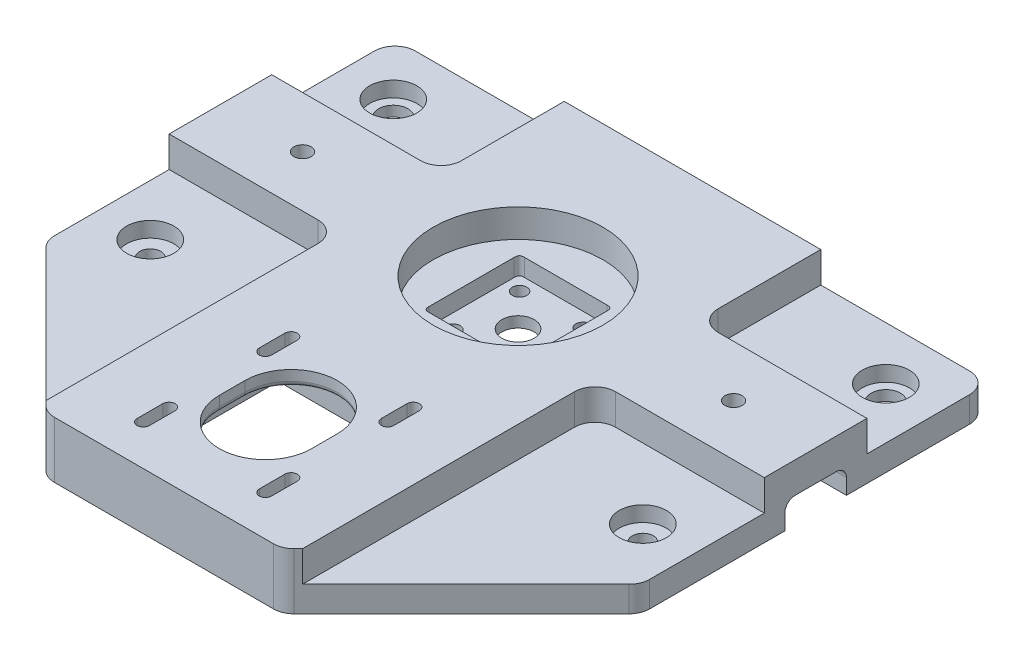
ISO-10303-21;
HEADER;
FILE_DESCRIPTION(('STEP AP214'),'2;1');
FILE_NAME('part.step','',(''),(''),'','','');
FILE_SCHEMA(('AUTOMOTIVE_DESIGN { 1 0 10303 214 1 1 1 1 }'));
ENDSEC;
DATA;
#1=APPLICATION_CONTEXT('core data for automotive mechanical design processes');
#2=APPLICATION_PROTOCOL_DEFINITION('international standard','automotive_design',2000,#1);
#3=PRODUCT_CONTEXT('',#1,'mechanical');
#4=PRODUCT('Part','Part','',(#3));
#5=PRODUCT_RELATED_PRODUCT_CATEGORY('part','',(#4));
#6=PRODUCT_DEFINITION_FORMATION('','',#4);
#7=PRODUCT_DEFINITION_CONTEXT('part definition',#1,'design');
#8=PRODUCT_DEFINITION('design','',#6,#7);
#9=PRODUCT_DEFINITION_SHAPE('','',#8);
#10=(LENGTH_UNIT() NAMED_UNIT(*) SI_UNIT(.MILLI.,.METRE.));
#11=(NAMED_UNIT(*) PLANE_ANGLE_UNIT() SI_UNIT($,.RADIAN.));
#12=(NAMED_UNIT(*) SI_UNIT($,.STERADIAN.) SOLID_ANGLE_UNIT());
#13=UNCERTAINTY_MEASURE_WITH_UNIT(LENGTH_MEASURE(1.E-05),#10,'distance_accuracy_value','');
#14=(GEOMETRIC_REPRESENTATION_CONTEXT(3) GLOBAL_UNCERTAINTY_ASSIGNED_CONTEXT((#13)) GLOBAL_UNIT_ASSIGNED_CONTEXT((#10,
#11,#12)) REPRESENTATION_CONTEXT('',''));
#15=CARTESIAN_POINT('',(0.,0.,0.));
#16=DIRECTION('',(0.,0.,1.));
#17=DIRECTION('',(1.,0.,0.));
#18=AXIS2_PLACEMENT_3D('',#15,#16,#17);
#19=CARTESIAN_POINT('',(127.,0.,-43.18));
#20=DIRECTION('',(0.,1.,0.));
#21=DIRECTION('',(0.,0.,1.));
#22=AXIS2_PLACEMENT_3D('',#19,#20,#21);
#23=CYLINDRICAL_SURFACE('',#22,2.12725);
#24=CARTESIAN_POINT('',(127.,13.97,-43.18));
#25=DIRECTION('',(0.,1.,0.));
#26=DIRECTION('',(0.,0.,1.));
#27=AXIS2_PLACEMENT_3D('',#24,#25,#26);
#28=CIRCLE('',#27,2.12725);
#29=CARTESIAN_POINT('',(127.,13.97,-41.05275));
#30=VERTEX_POINT('',#29);
#31=EDGE_CURVE('E1398',#30,#30,#28,.T.);
#32=ORIENTED_EDGE('',*,*,#31,.T.);
#33=EDGE_LOOP('',(#32));
#34=FACE_BOUND('',#33,.T.);
#35=CARTESIAN_POINT('',(127.,6.35,-43.18));
#36=DIRECTION('',(0.,-1.,0.));
#37=DIRECTION('',(0.,0.,-1.));
#38=AXIS2_PLACEMENT_3D('',#35,#36,#37);
#39=CIRCLE('',#38,2.12725);
#40=CARTESIAN_POINT('',(127.,6.35,-45.30725));
#41=VERTEX_POINT('',#40);
#42=EDGE_CURVE('E1369',#41,#41,#39,.F.);
#43=ORIENTED_EDGE('',*,*,#42,.F.);
#44=EDGE_LOOP('',(#43));
#45=FACE_BOUND('',#44,.T.);
#46=ADVANCED_FACE('F42',(#34,#45),#23,.F.);
#47=CARTESIAN_POINT('',(73.66,0.,-43.18));
#48=DIRECTION('',(0.,1.,0.));
#49=DIRECTION('',(0.,0.,1.));
#50=AXIS2_PLACEMENT_3D('',#47,#48,#49);
#51=CYLINDRICAL_SURFACE('',#50,4.00050000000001);
#52=CARTESIAN_POINT('',(73.66,0.,-43.18));
#53=DIRECTION('',(0.,1.,0.));
#54=DIRECTION('',(0.,0.,1.));
#55=AXIS2_PLACEMENT_3D('',#52,#53,#54);
#56=CIRCLE('',#55,4.00050000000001);
#57=CARTESIAN_POINT('',(73.66,0.,-39.1795));
#58=VERTEX_POINT('',#57);
#59=EDGE_CURVE('E936',#58,#58,#56,.T.);
#60=ORIENTED_EDGE('',*,*,#59,.F.);
#61=EDGE_LOOP('',(#60));
#62=FACE_BOUND('',#61,.T.);
#63=CARTESIAN_POINT('',(73.66,2.667,-43.18));
#64=DIRECTION('',(0.,1.,0.));
#65=DIRECTION('',(0.,0.,1.));
#66=AXIS2_PLACEMENT_3D('',#63,#64,#65);
#67=CIRCLE('',#66,4.00050000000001);
#68=CARTESIAN_POINT('',(73.66,2.667,-39.1795));
#69=VERTEX_POINT('',#68);
#70=EDGE_CURVE('E1611',#69,#69,#67,.T.);
#71=ORIENTED_EDGE('',*,*,#70,.T.);
#72=EDGE_LOOP('',(#71));
#73=FACE_BOUND('',#72,.T.);
#74=ADVANCED_FACE('F2045',(#62,#73),#51,.F.);
#75=CARTESIAN_POINT('',(12.7,6.35,-13.1064));
#76=DIRECTION('',(0.,-1.,0.));
#77=DIRECTION('',(0.,0.,-1.));
#78=AXIS2_PLACEMENT_3D('',#75,#76,#77);
#79=CYLINDRICAL_SURFACE('',#78,2.6035);
#80=CARTESIAN_POINT('',(12.7,0.,-13.1064));
#81=DIRECTION('',(0.,1.,0.));
#82=DIRECTION('',(0.,0.,1.));
#83=AXIS2_PLACEMENT_3D('',#80,#81,#82);
#84=CIRCLE('',#83,2.6035);
#85=CARTESIAN_POINT('',(12.7,0.,-10.5029));
#86=VERTEX_POINT('',#85);
#87=EDGE_CURVE('E969',#86,#86,#84,.T.);
#88=ORIENTED_EDGE('',*,*,#87,.F.);
#89=EDGE_LOOP('',(#88));
#90=FACE_BOUND('',#89,.T.);
#91=CARTESIAN_POINT('',(12.7,2.54,-13.1064));
#92=DIRECTION('',(0.,1.,0.));
#93=DIRECTION('',(0.,0.,1.));
#94=AXIS2_PLACEMENT_3D('',#91,#92,#93);
#95=CIRCLE('',#94,2.6035);
#96=CARTESIAN_POINT('',(12.7,2.54,-10.5029));
#97=VERTEX_POINT('',#96);
#98=EDGE_CURVE('E766',#97,#97,#95,.T.);
#99=ORIENTED_EDGE('',*,*,#98,.T.);
#100=EDGE_LOOP('',(#99));
#101=FACE_BOUND('',#100,.T.);
#102=ADVANCED_FACE('F2053',(#90,#101),#79,.F.);
#103=CARTESIAN_POINT('',(12.7,6.35,-73.2536));
#104=DIRECTION('',(0.,-1.,0.));
#105=DIRECTION('',(0.,0.,-1.));
#106=AXIS2_PLACEMENT_3D('',#103,#104,#105);
#107=CYLINDRICAL_SURFACE('',#106,3.6195);
#108=CARTESIAN_POINT('',(12.7,0.,-73.2536));
#109=DIRECTION('',(0.,1.,0.));
#110=DIRECTION('',(0.,0.,1.));
#111=AXIS2_PLACEMENT_3D('',#108,#109,#110);
#112=CIRCLE('',#111,3.6195);
#113=CARTESIAN_POINT('',(12.7,0.,-69.6341));
#114=VERTEX_POINT('',#113);
#115=EDGE_CURVE('E965',#114,#114,#112,.T.);
#116=ORIENTED_EDGE('',*,*,#115,.F.);
#117=EDGE_LOOP('',(#116));
#118=FACE_BOUND('',#117,.T.);
#119=CARTESIAN_POINT('',(12.7,2.54,-73.2536));
#120=DIRECTION('',(0.,1.,0.));
#121=DIRECTION('',(0.,0.,1.));
#122=AXIS2_PLACEMENT_3D('',#119,#120,#121);
#123=CIRCLE('',#122,3.6195);
#124=CARTESIAN_POINT('',(12.7,2.54,-69.6341));
#125=VERTEX_POINT('',#124);
#126=EDGE_CURVE('E762',#125,#125,#123,.T.);
#127=ORIENTED_EDGE('',*,*,#126,.T.);
#128=EDGE_LOOP('',(#127));
#129=FACE_BOUND('',#128,.T.);
#130=ADVANCED_FACE('F2087',(#118,#129),#107,.F.);
#131=CARTESIAN_POINT('',(134.62,6.35,-73.2536));
#132=DIRECTION('',(0.,-1.,0.));
#133=DIRECTION('',(0.,0.,-1.));
#134=AXIS2_PLACEMENT_3D('',#131,#132,#133);
#135=CYLINDRICAL_SURFACE('',#134,3.61949999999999);
#136=CARTESIAN_POINT('',(134.62,0.,-73.2536));
#137=DIRECTION('',(0.,1.,0.));
#138=DIRECTION('',(0.,0.,1.));
#139=AXIS2_PLACEMENT_3D('',#136,#137,#138);
#140=CIRCLE('',#139,3.61949999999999);
#141=CARTESIAN_POINT('',(134.62,0.,-69.6341));
#142=VERTEX_POINT('',#141);
#143=EDGE_CURVE('E961',#142,#142,#140,.T.);
#144=ORIENTED_EDGE('',*,*,#143,.F.);
#145=EDGE_LOOP('',(#144));
#146=FACE_BOUND('',#145,.T.);
#147=CARTESIAN_POINT('',(134.62,2.54,-73.2536));
#148=DIRECTION('',(0.,1.,0.));
#149=DIRECTION('',(0.,0.,1.));
#150=AXIS2_PLACEMENT_3D('',#147,#148,#149);
#151=CIRCLE('',#150,3.61949999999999);
#152=CARTESIAN_POINT('',(134.62,2.54,-69.6341));
#153=VERTEX_POINT('',#152);
#154=EDGE_CURVE('E757',#153,#153,#151,.T.);
#155=ORIENTED_EDGE('',*,*,#154,.T.);
#156=EDGE_LOOP('',(#155));
#157=FACE_BOUND('',#156,.T.);
#158=ADVANCED_FACE('F2091',(#146,#157),#135,.F.);
#159=CARTESIAN_POINT('',(134.62,6.35,-13.1064));
#160=DIRECTION('',(0.,-1.,0.));
#161=DIRECTION('',(0.,0.,-1.));
#162=AXIS2_PLACEMENT_3D('',#159,#160,#161);
#163=CYLINDRICAL_SURFACE('',#162,2.60350000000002);
#164=CARTESIAN_POINT('',(134.62,0.,-13.1064));
#165=DIRECTION('',(0.,1.,0.));
#166=DIRECTION('',(0.,0.,1.));
#167=AXIS2_PLACEMENT_3D('',#164,#165,#166);
#168=CIRCLE('',#167,2.60350000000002);
#169=CARTESIAN_POINT('',(134.62,0.,-10.5029));
#170=VERTEX_POINT('',#169);
#171=EDGE_CURVE('E940',#170,#170,#168,.T.);
#172=ORIENTED_EDGE('',*,*,#171,.F.);
#173=EDGE_LOOP('',(#172));
#174=FACE_BOUND('',#173,.T.);
#175=CARTESIAN_POINT('',(134.62,2.54,-13.1064));
#176=DIRECTION('',(0.,1.,0.));
#177=DIRECTION('',(0.,0.,1.));
#178=AXIS2_PLACEMENT_3D('',#175,#176,#177);
#179=CIRCLE('',#178,2.60350000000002);
#180=CARTESIAN_POINT('',(134.62,2.54,-10.5029));
#181=VERTEX_POINT('',#180);
#182=EDGE_CURVE('E753',#181,#181,#179,.T.);
#183=ORIENTED_EDGE('',*,*,#182,.T.);
#184=EDGE_LOOP('',(#183));
#185=FACE_BOUND('',#184,.T.);
#186=ADVANCED_FACE('F2095',(#174,#185),#163,.F.);
#187=CARTESIAN_POINT('',(0.,6.35,0.));
#188=DIRECTION('',(0.,1.,0.));
#189=DIRECTION('',(0.,0.,1.));
#190=AXIS2_PLACEMENT_3D('',#187,#188,#189);
#191=PLANE('',#190);
#192=CARTESIAN_POINT('',(134.62,6.35,-73.2536));
#193=DIRECTION('',(0.,1.,0.));
#194=DIRECTION('',(0.,0.,1.));
#195=AXIS2_PLACEMENT_3D('',#192,#193,#194);
#196=CIRCLE('',#195,5.84199999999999);
#197=CARTESIAN_POINT('',(134.62,6.35,-67.4116));
#198=VERTEX_POINT('',#197);
#199=EDGE_CURVE('E799',#198,#198,#196,.T.);
#200=ORIENTED_EDGE('',*,*,#199,.F.);
#201=EDGE_LOOP('',(#200));
#202=FACE_BOUND('',#201,.T.);
#203=DIRECTION('',(0.,0.,-1.));
#204=VECTOR('',#203,1.);
#205=CARTESIAN_POINT('',(105.41,6.35,-86.36));
#206=LINE('',#205,#204);
#207=CARTESIAN_POINT('',(105.41,6.35,-60.96));
#208=VERTEX_POINT('',#207);
#209=CARTESIAN_POINT('',(105.41,6.35,-86.36));
#210=VERTEX_POINT('',#209);
#211=EDGE_CURVE('E770',#208,#210,#206,.T.);
#212=ORIENTED_EDGE('',*,*,#211,.F.);
#213=CARTESIAN_POINT('',(110.49,6.35,-60.96));
#214=DIRECTION('',(0.,1.,0.));
#215=DIRECTION('',(0.,0.,1.));
#216=AXIS2_PLACEMENT_3D('',#213,#214,#215);
#217=CIRCLE('',#216,5.08);
#218=CARTESIAN_POINT('',(110.49,6.35,-55.88));
#219=VERTEX_POINT('',#218);
#220=EDGE_CURVE('E629',#208,#219,#217,.T.);
#221=ORIENTED_EDGE('',*,*,#220,.T.);
#222=DIRECTION('',(-1.,0.,0.));
#223=VECTOR('',#222,1.);
#224=CARTESIAN_POINT('',(105.41,6.35,-55.88));
#225=LINE('',#224,#223);
#226=CARTESIAN_POINT('',(147.32,6.35,-55.88));
#227=VERTEX_POINT('',#226);
#228=EDGE_CURVE('E829',#227,#219,#225,.T.);
#229=ORIENTED_EDGE('',*,*,#228,.F.);
#230=DIRECTION('',(0.,0.,-1.));
#231=VECTOR('',#230,1.);
#232=CARTESIAN_POINT('',(147.32,6.35,0.));
#233=LINE('',#232,#231);
#234=CARTESIAN_POINT('',(147.32,6.35,-81.28));
#235=VERTEX_POINT('',#234);
#236=EDGE_CURVE('E944',#227,#235,#233,.T.);
#237=ORIENTED_EDGE('',*,*,#236,.T.);
#238=CARTESIAN_POINT('',(142.24,6.35,-81.28));
#239=DIRECTION('',(0.,1.,0.));
#240=DIRECTION('',(0.,0.,1.));
#241=AXIS2_PLACEMENT_3D('',#238,#239,#240);
#242=CIRCLE('',#241,5.08);
#243=CARTESIAN_POINT('',(142.24,6.35,-86.36));
#244=VERTEX_POINT('',#243);
#245=EDGE_CURVE('E625',#235,#244,#242,.T.);
#246=ORIENTED_EDGE('',*,*,#245,.T.);
#247=DIRECTION('',(-1.,0.,0.));
#248=VECTOR('',#247,1.);
#249=CARTESIAN_POINT('',(0.,6.35,-86.36));
#250=LINE('',#249,#248);
#251=EDGE_CURVE('E949',#244,#210,#250,.T.);
#252=ORIENTED_EDGE('',*,*,#251,.T.);
#253=EDGE_LOOP('',(#212,#221,#229,#237,#246,#252));
#254=FACE_BOUND('',#253,.T.);
#255=ADVANCED_FACE('F1005',(#202,#254),#191,.T.);
#256=CARTESIAN_POINT('',(134.62,6.35,-13.1064));
#257=DIRECTION('',(0.,1.,0.));
#258=DIRECTION('',(0.,0.,1.));
#259=AXIS2_PLACEMENT_3D('',#256,#257,#258);
#260=CIRCLE('',#259,5.84200000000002);
#261=CARTESIAN_POINT('',(134.62,6.35,-7.26439999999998));
#262=VERTEX_POINT('',#261);
#263=EDGE_CURVE('E790',#262,#262,#260,.T.);
#264=ORIENTED_EDGE('',*,*,#263,.F.);
#265=EDGE_LOOP('',(#264));
#266=FACE_BOUND('',#265,.T.);
#267=DIRECTION('',(1.,0.,0.));
#268=VECTOR('',#267,1.);
#269=CARTESIAN_POINT('',(147.32,6.35,-30.48));
#270=LINE('',#269,#268);
#271=CARTESIAN_POINT('',(110.49,6.35,-30.48));
#272=VERTEX_POINT('',#271);
#273=CARTESIAN_POINT('',(147.32,6.35,-30.48));
#274=VERTEX_POINT('',#273);
#275=EDGE_CURVE('E898',#272,#274,#270,.T.);
#276=ORIENTED_EDGE('',*,*,#275,.F.);
#277=CARTESIAN_POINT('',(110.49,6.35,-25.4));
#278=DIRECTION('',(0.,1.,0.));
#279=DIRECTION('',(0.,0.,1.));
#280=AXIS2_PLACEMENT_3D('',#277,#278,#279);
#281=CIRCLE('',#280,5.08);
#282=CARTESIAN_POINT('',(105.41,6.35,-25.4));
#283=VERTEX_POINT('',#282);
#284=EDGE_CURVE('E642',#272,#283,#281,.T.);
#285=ORIENTED_EDGE('',*,*,#284,.T.);
#286=DIRECTION('',(0.,0.,-1.));
#287=VECTOR('',#286,1.);
#288=CARTESIAN_POINT('',(105.41,6.35,-30.48));
#289=LINE('',#288,#287);
#290=CARTESIAN_POINT('',(105.41,6.35,41.9100000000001));
#291=VERTEX_POINT('',#290);
#292=EDGE_CURVE('E894',#291,#283,#289,.T.);
#293=ORIENTED_EDGE('',*,*,#292,.F.);
#294=DIRECTION('',(0.707106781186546,0.,-0.707106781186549));
#295=VECTOR('',#294,1.);
#296=CARTESIAN_POINT('',(73.6600000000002,6.35,73.66));
#297=LINE('',#296,#295);
#298=CARTESIAN_POINT('',(145.832102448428,6.35,1.48789755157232));
#299=VERTEX_POINT('',#298);
#300=EDGE_CURVE('E620',#291,#299,#297,.T.);
#301=ORIENTED_EDGE('',*,*,#300,.T.);
#302=CARTESIAN_POINT('',(142.24,6.35,-2.10420489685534));
#303=DIRECTION('',(0.,1.,0.));
#304=DIRECTION('',(0.,0.,1.));
#305=AXIS2_PLACEMENT_3D('',#302,#303,#304);
#306=CIRCLE('',#305,5.08);
#307=CARTESIAN_POINT('',(147.32,6.35,-2.10420489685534));
#308=VERTEX_POINT('',#307);
#309=EDGE_CURVE('E639',#299,#308,#306,.T.);
#310=ORIENTED_EDGE('',*,*,#309,.T.);
#311=EDGE_CURVE('E945',#308,#274,#233,.T.);
#312=ORIENTED_EDGE('',*,*,#311,.T.);
#313=EDGE_LOOP('',(#276,#285,#293,#301,#310,#312));
#314=FACE_BOUND('',#313,.T.);
#315=ADVANCED_FACE('F2153',(#266,#314),#191,.T.);
#316=CARTESIAN_POINT('',(12.7,6.35,-13.1064));
#317=DIRECTION('',(0.,1.,0.));
#318=DIRECTION('',(0.,0.,1.));
#319=AXIS2_PLACEMENT_3D('',#316,#317,#318);
#320=CIRCLE('',#319,5.842);
#321=CARTESIAN_POINT('',(12.7,6.35,-7.2644));
#322=VERTEX_POINT('',#321);
#323=EDGE_CURVE('E808',#322,#322,#320,.T.);
#324=ORIENTED_EDGE('',*,*,#323,.F.);
#325=EDGE_LOOP('',(#324));
#326=FACE_BOUND('',#325,.T.);
#327=DIRECTION('',(0.,0.,1.));
#328=VECTOR('',#327,1.);
#329=CARTESIAN_POINT('',(41.91,6.35,0.));
#330=LINE('',#329,#328);
#331=CARTESIAN_POINT('',(41.91,6.35,-25.4));
#332=VERTEX_POINT('',#331);
#333=CARTESIAN_POINT('',(41.91,6.35,41.9100000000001));
#334=VERTEX_POINT('',#333);
#335=EDGE_CURVE('E890',#332,#334,#330,.T.);
#336=ORIENTED_EDGE('',*,*,#335,.F.);
#337=CARTESIAN_POINT('',(36.83,6.35,-25.4));
#338=DIRECTION('',(0.,1.,0.));
#339=DIRECTION('',(0.,0.,1.));
#340=AXIS2_PLACEMENT_3D('',#337,#338,#339);
#341=CIRCLE('',#340,5.08);
#342=CARTESIAN_POINT('',(36.83,6.35,-30.48));
#343=VERTEX_POINT('',#342);
#344=EDGE_CURVE('E668',#332,#343,#341,.T.);
#345=ORIENTED_EDGE('',*,*,#344,.T.);
#346=DIRECTION('',(1.,0.,0.));
#347=VECTOR('',#346,1.);
#348=CARTESIAN_POINT('',(0.,6.35,-30.48));
#349=LINE('',#348,#347);
#350=CARTESIAN_POINT('',(0.,6.35,-30.48));
#351=VERTEX_POINT('',#350);
#352=EDGE_CURVE('E886',#351,#343,#349,.T.);
#353=ORIENTED_EDGE('',*,*,#352,.F.);
#354=DIRECTION('',(0.,0.,1.));
#355=VECTOR('',#354,1.);
#356=CARTESIAN_POINT('',(0.,6.35,0.));
#357=LINE('',#356,#355);
#358=CARTESIAN_POINT('',(0.,6.35,-2.10420489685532));
#359=VERTEX_POINT('',#358);
#360=EDGE_CURVE('E952',#351,#359,#357,.T.);
#361=ORIENTED_EDGE('',*,*,#360,.T.);
#362=CARTESIAN_POINT('',(5.08,6.35,-2.10420489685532));
#363=DIRECTION('',(0.,1.,0.));
#364=DIRECTION('',(0.,0.,1.));
#365=AXIS2_PLACEMENT_3D('',#362,#363,#364);
#366=CIRCLE('',#365,5.08);
#367=CARTESIAN_POINT('',(1.48789755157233,6.35,1.48789755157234));
#368=VERTEX_POINT('',#367);
#369=EDGE_CURVE('E665',#359,#368,#366,.T.);
#370=ORIENTED_EDGE('',*,*,#369,.T.);
#371=DIRECTION('',(0.707106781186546,0.,0.707106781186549));
#372=VECTOR('',#371,1.);
#373=CARTESIAN_POINT('',(0.,6.35,0.));
#374=LINE('',#373,#372);
#375=EDGE_CURVE('E626',#368,#334,#374,.T.);
#376=ORIENTED_EDGE('',*,*,#375,.T.);
#377=EDGE_LOOP('',(#336,#345,#353,#361,#370,#376));
#378=FACE_BOUND('',#377,.T.);
#379=ADVANCED_FACE('F2064',(#326,#378),#191,.T.);
#380=CARTESIAN_POINT('',(0.,6.35,44.45));
#381=DIRECTION('',(0.,0.,-1.));
#382=DIRECTION('',(-1.,0.,0.));
#383=AXIS2_PLACEMENT_3D('',#380,#381,#382);
#384=PLANE('',#383);
#385=DIRECTION('',(1.,0.,0.));
#386=VECTOR('',#385,1.);
#387=CARTESIAN_POINT('',(0.,0.,44.45));
#388=LINE('',#387,#386);
#389=CARTESIAN_POINT('',(46.5542048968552,0.,44.45));
#390=VERTEX_POINT('',#389);
#391=CARTESIAN_POINT('',(100.765795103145,0.,44.45));
#392=VERTEX_POINT('',#391);
#393=EDGE_CURVE('E973',#390,#392,#388,.T.);
#394=ORIENTED_EDGE('',*,*,#393,.T.);
#395=DIRECTION('',(0.,-1.,0.));
#396=VECTOR('',#395,1.);
#397=CARTESIAN_POINT('',(100.765795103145,6.35,44.45));
#398=LINE('',#397,#396);
#399=CARTESIAN_POINT('',(100.765795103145,13.97,44.45));
#400=VERTEX_POINT('',#399);
#401=EDGE_CURVE('E731',#392,#400,#398,.F.);
#402=ORIENTED_EDGE('',*,*,#401,.T.);
#403=DIRECTION('',(1.,0.,0.));
#404=VECTOR('',#403,1.);
#405=CARTESIAN_POINT('',(44.4499999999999,13.97,44.45));
#406=LINE('',#405,#404);
#407=CARTESIAN_POINT('',(46.5542048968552,13.97,44.45));
#408=VERTEX_POINT('',#407);
#409=EDGE_CURVE('E853',#408,#400,#406,.T.);
#410=ORIENTED_EDGE('',*,*,#409,.F.);
#411=DIRECTION('',(0.,-1.,0.));
#412=VECTOR('',#411,1.);
#413=CARTESIAN_POINT('',(46.5542048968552,6.35,44.45));
#414=LINE('',#413,#412);
#415=EDGE_CURVE('E727',#408,#390,#414,.T.);
#416=ORIENTED_EDGE('',*,*,#415,.T.);
#417=EDGE_LOOP('',(#394,#402,#410,#416));
#418=FACE_BOUND('',#417,.T.);
#419=ADVANCED_FACE('F2080',(#418),#384,.F.);
#420=CARTESIAN_POINT('',(73.6600000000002,6.35,73.66));
#421=DIRECTION('',(-0.707106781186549,0.,-0.707106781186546));
#422=DIRECTION('',(-0.707106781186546,0.,0.707106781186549));
#423=AXIS2_PLACEMENT_3D('',#420,#421,#422);
#424=PLANE('',#423);
#425=DIRECTION('',(0.707106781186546,0.,-0.707106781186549));
#426=VECTOR('',#425,1.);
#427=CARTESIAN_POINT('',(73.6600000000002,0.,73.66));
#428=LINE('',#427,#426);
#429=CARTESIAN_POINT('',(104.357897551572,0.,42.9621024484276));
#430=VERTEX_POINT('',#429);
#431=CARTESIAN_POINT('',(145.832102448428,0.,1.48789755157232));
#432=VERTEX_POINT('',#431);
#433=EDGE_CURVE('E977',#430,#432,#428,.T.);
#434=ORIENTED_EDGE('',*,*,#433,.T.);
#435=DIRECTION('',(0.,-1.,0.));
#436=VECTOR('',#435,1.);
#437=CARTESIAN_POINT('',(145.832102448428,6.35,1.48789755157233));
#438=LINE('',#437,#436);
#439=EDGE_CURVE('E703',#432,#299,#438,.F.);
#440=ORIENTED_EDGE('',*,*,#439,.T.);
#441=ORIENTED_EDGE('',*,*,#300,.F.);
#442=DIRECTION('',(0.,-1.,0.));
#443=VECTOR('',#442,1.);
#444=CARTESIAN_POINT('',(105.41,13.97,41.9100000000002));
#445=LINE('',#444,#443);
#446=CARTESIAN_POINT('',(105.41,13.97,41.9100000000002));
#447=VERTEX_POINT('',#446);
#448=EDGE_CURVE('E912',#447,#291,#445,.T.);
#449=ORIENTED_EDGE('',*,*,#448,.F.);
#450=DIRECTION('',(0.707106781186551,0.,-0.707106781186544));
#451=VECTOR('',#450,1.);
#452=CARTESIAN_POINT('',(105.41,13.97,41.9100000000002));
#453=LINE('',#452,#451);
#454=CARTESIAN_POINT('',(104.357897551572,13.97,42.9621024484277));
#455=VERTEX_POINT('',#454);
#456=EDGE_CURVE('E857',#455,#447,#453,.T.);
#457=ORIENTED_EDGE('',*,*,#456,.F.);
#458=DIRECTION('',(0.,-1.,0.));
#459=VECTOR('',#458,1.);
#460=CARTESIAN_POINT('',(104.357897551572,6.35,42.9621024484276));
#461=LINE('',#460,#459);
#462=EDGE_CURVE('E699',#455,#430,#461,.T.);
#463=ORIENTED_EDGE('',*,*,#462,.T.);
#464=EDGE_LOOP('',(#434,#440,#441,#449,#457,#463));
#465=FACE_BOUND('',#464,.T.);
#466=ADVANCED_FACE('F2077',(#465),#424,.F.);
#467=CARTESIAN_POINT('',(147.32,6.35,0.));
#468=DIRECTION('',(-1.,0.,0.));
#469=DIRECTION('',(0.,0.,1.));
#470=AXIS2_PLACEMENT_3D('',#467,#468,#469);
#471=PLANE('',#470);
#472=DIRECTION('',(0.,0.,1.));
#473=VECTOR('',#472,1.);
#474=CARTESIAN_POINT('',(147.32,6.35,-50.8));
#475=LINE('',#474,#473);
#476=CARTESIAN_POINT('',(147.32,6.35,-48.26));
#477=VERTEX_POINT('',#476);
#478=CARTESIAN_POINT('',(147.32,6.35,-38.1));
#479=VERTEX_POINT('',#478);
#480=EDGE_CURVE('E1373',#477,#479,#475,.T.);
#481=ORIENTED_EDGE('',*,*,#480,.F.);
#482=CARTESIAN_POINT('',(147.32,3.81,-48.26));
#483=DIRECTION('',(-1.,0.,0.));
#484=DIRECTION('',(0.,0.,1.));
#485=AXIS2_PLACEMENT_3D('',#482,#483,#484);
#486=CIRCLE('',#485,2.54);
#487=CARTESIAN_POINT('',(147.32,3.81,-50.8));
#488=VERTEX_POINT('',#487);
#489=EDGE_CURVE('E1277',#477,#488,#486,.T.);
#490=ORIENTED_EDGE('',*,*,#489,.T.);
#491=DIRECTION('',(0.,-1.,0.));
#492=VECTOR('',#491,1.);
#493=CARTESIAN_POINT('',(147.32,6.35,-50.8));
#494=LINE('',#493,#492);
#495=CARTESIAN_POINT('',(147.32,0.,-50.8));
#496=VERTEX_POINT('',#495);
#497=EDGE_CURVE('E994',#488,#496,#494,.T.);
#498=ORIENTED_EDGE('',*,*,#497,.T.);
#499=DIRECTION('',(0.,0.,-1.));
#500=VECTOR('',#499,1.);
#501=CARTESIAN_POINT('',(147.32,0.,0.));
#502=LINE('',#501,#500);
#503=CARTESIAN_POINT('',(147.32,0.,-81.28));
#504=VERTEX_POINT('',#503);
#505=EDGE_CURVE('E980',#496,#504,#502,.T.);
#506=ORIENTED_EDGE('',*,*,#505,.T.);
#507=DIRECTION('',(0.,-1.,0.));
#508=VECTOR('',#507,1.);
#509=CARTESIAN_POINT('',(147.32,6.35,-81.28));
#510=LINE('',#509,#508);
#511=EDGE_CURVE('E674',#504,#235,#510,.F.);
#512=ORIENTED_EDGE('',*,*,#511,.T.);
#513=ORIENTED_EDGE('',*,*,#236,.F.);
#514=DIRECTION('',(0.,-1.,0.));
#515=VECTOR('',#514,1.);
#516=CARTESIAN_POINT('',(147.32,13.97,-55.88));
#517=LINE('',#516,#515);
#518=CARTESIAN_POINT('',(147.32,13.97,-55.88));
#519=VERTEX_POINT('',#518);
#520=EDGE_CURVE('E874',#519,#227,#517,.T.);
#521=ORIENTED_EDGE('',*,*,#520,.F.);
#522=DIRECTION('',(0.,0.,-1.));
#523=VECTOR('',#522,1.);
#524=CARTESIAN_POINT('',(147.32,13.97,-55.88));
#525=LINE('',#524,#523);
#526=CARTESIAN_POINT('',(147.32,13.97,-30.48));
#527=VERTEX_POINT('',#526);
#528=EDGE_CURVE('E867',#527,#519,#525,.T.);
#529=ORIENTED_EDGE('',*,*,#528,.F.);
#530=DIRECTION('',(0.,-1.,0.));
#531=VECTOR('',#530,1.);
#532=CARTESIAN_POINT('',(147.32,13.97,-30.48));
#533=LINE('',#532,#531);
#534=EDGE_CURVE('E908',#527,#274,#533,.T.);
#535=ORIENTED_EDGE('',*,*,#534,.T.);
#536=ORIENTED_EDGE('',*,*,#311,.F.);
#537=DIRECTION('',(0.,-1.,0.));
#538=VECTOR('',#537,1.);
#539=CARTESIAN_POINT('',(147.32,6.35,-2.10420489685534));
#540=LINE('',#539,#538);
#541=CARTESIAN_POINT('',(147.32,0.,-2.10420489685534));
#542=VERTEX_POINT('',#541);
#543=EDGE_CURVE('E677',#308,#542,#540,.T.);
#544=ORIENTED_EDGE('',*,*,#543,.T.);
#545=CARTESIAN_POINT('',(147.32,0.,-35.56));
#546=VERTEX_POINT('',#545);
#547=EDGE_CURVE('E613',#542,#546,#502,.T.);
#548=ORIENTED_EDGE('',*,*,#547,.T.);
#549=DIRECTION('',(0.,-1.,0.));
#550=VECTOR('',#549,1.);
#551=CARTESIAN_POINT('',(147.32,6.35,-35.56));
#552=LINE('',#551,#550);
#553=CARTESIAN_POINT('',(147.32,3.81,-35.56));
#554=VERTEX_POINT('',#553);
#555=EDGE_CURVE('E1387',#554,#546,#552,.T.);
#556=ORIENTED_EDGE('',*,*,#555,.F.);
#557=CARTESIAN_POINT('',(147.32,3.81,-38.1));
#558=DIRECTION('',(-1.,0.,0.));
#559=DIRECTION('',(0.,0.,1.));
#560=AXIS2_PLACEMENT_3D('',#557,#558,#559);
#561=CIRCLE('',#560,2.54);
#562=EDGE_CURVE('E1274',#554,#479,#561,.T.);
#563=ORIENTED_EDGE('',*,*,#562,.T.);
#564=EDGE_LOOP('',(#481,#490,#498,#506,#512,#513,#521,#529,#535,#536,#544,#548,#556,#563));
#565=FACE_BOUND('',#564,.T.);
#566=ADVANCED_FACE('F989',(#565),#471,.F.);
#567=CARTESIAN_POINT('',(0.,6.35,-86.36));
#568=DIRECTION('',(0.,0.,1.));
#569=DIRECTION('',(1.,0.,0.));
#570=AXIS2_PLACEMENT_3D('',#567,#568,#569);
#571=PLANE('',#570);
#572=DIRECTION('',(-1.,0.,0.));
#573=VECTOR('',#572,1.);
#574=CARTESIAN_POINT('',(0.,0.,-86.36));
#575=LINE('',#574,#573);
#576=CARTESIAN_POINT('',(142.24,0.,-86.36));
#577=VERTEX_POINT('',#576);
#578=CARTESIAN_POINT('',(5.07999999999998,0.,-86.36));
#579=VERTEX_POINT('',#578);
#580=EDGE_CURVE('E607',#577,#579,#575,.T.);
#581=ORIENTED_EDGE('',*,*,#580,.T.);
#582=DIRECTION('',(0.,-1.,0.));
#583=VECTOR('',#582,1.);
#584=CARTESIAN_POINT('',(5.07999999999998,6.35,-86.36));
#585=LINE('',#584,#583);
#586=CARTESIAN_POINT('',(5.07999999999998,6.35,-86.36));
#587=VERTEX_POINT('',#586);
#588=EDGE_CURVE('E724',#579,#587,#585,.F.);
#589=ORIENTED_EDGE('',*,*,#588,.T.);
#590=CARTESIAN_POINT('',(41.91,6.35,-86.36));
#591=VERTEX_POINT('',#590);
#592=EDGE_CURVE('E948',#591,#587,#250,.T.);
#593=ORIENTED_EDGE('',*,*,#592,.F.);
#594=DIRECTION('',(0.,-1.,0.));
#595=VECTOR('',#594,1.);
#596=CARTESIAN_POINT('',(41.91,13.97,-86.36));
#597=LINE('',#596,#595);
#598=CARTESIAN_POINT('',(41.91,13.97,-86.36));
#599=VERTEX_POINT('',#598);
#600=EDGE_CURVE('E928',#599,#591,#597,.T.);
#601=ORIENTED_EDGE('',*,*,#600,.F.);
#602=DIRECTION('',(-1.,0.,0.));
#603=VECTOR('',#602,1.);
#604=CARTESIAN_POINT('',(41.91,13.97,-86.36));
#605=LINE('',#604,#603);
#606=CARTESIAN_POINT('',(105.41,13.97,-86.36));
#607=VERTEX_POINT('',#606);
#608=EDGE_CURVE('E828',#607,#599,#605,.T.);
#609=ORIENTED_EDGE('',*,*,#608,.F.);
#610=DIRECTION('',(0.,-1.,0.));
#611=VECTOR('',#610,1.);
#612=CARTESIAN_POINT('',(105.41,13.97,-86.36));
#613=LINE('',#612,#611);
#614=EDGE_CURVE('E932',#607,#210,#613,.T.);
#615=ORIENTED_EDGE('',*,*,#614,.T.);
#616=ORIENTED_EDGE('',*,*,#251,.F.);
#617=DIRECTION('',(0.,-1.,0.));
#618=VECTOR('',#617,1.);
#619=CARTESIAN_POINT('',(142.24,6.35,-86.36));
#620=LINE('',#619,#618);
#621=EDGE_CURVE('E720',#244,#577,#620,.T.);
#622=ORIENTED_EDGE('',*,*,#621,.T.);
#623=EDGE_LOOP('',(#581,#589,#593,#601,#609,#615,#616,#622));
#624=FACE_BOUND('',#623,.T.);
#625=ADVANCED_FACE('F1007',(#624),#571,.F.);
#626=CARTESIAN_POINT('',(0.,6.35,0.));
#627=DIRECTION('',(1.,0.,0.));
#628=DIRECTION('',(0.,0.,-1.));
#629=AXIS2_PLACEMENT_3D('',#626,#627,#628);
#630=PLANE('',#629);
#631=DIRECTION('',(0.,0.,1.));
#632=VECTOR('',#631,1.);
#633=CARTESIAN_POINT('',(0.,0.,0.));
#634=LINE('',#633,#632);
#635=CARTESIAN_POINT('',(0.,0.,-81.28));
#636=VERTEX_POINT('',#635);
#637=CARTESIAN_POINT('',(0.,0.,-50.8));
#638=VERTEX_POINT('',#637);
#639=EDGE_CURVE('E606',#636,#638,#634,.T.);
#640=ORIENTED_EDGE('',*,*,#639,.T.);
#641=DIRECTION('',(0.,-1.,0.));
#642=VECTOR('',#641,1.);
#643=CARTESIAN_POINT('',(0.,6.35,-50.8));
#644=LINE('',#643,#642);
#645=CARTESIAN_POINT('',(0.,3.81,-50.8));
#646=VERTEX_POINT('',#645);
#647=EDGE_CURVE('E587',#646,#638,#644,.T.);
#648=ORIENTED_EDGE('',*,*,#647,.F.);
#649=CARTESIAN_POINT('',(0.,3.81,-48.26));
#650=DIRECTION('',(1.,0.,0.));
#651=DIRECTION('',(0.,0.,-1.));
#652=AXIS2_PLACEMENT_3D('',#649,#650,#651);
#653=CIRCLE('',#652,2.54);
#654=CARTESIAN_POINT('',(0.,6.35,-48.26));
#655=VERTEX_POINT('',#654);
#656=EDGE_CURVE('E1282',#646,#655,#653,.T.);
#657=ORIENTED_EDGE('',*,*,#656,.T.);
#658=DIRECTION('',(0.,0.,-1.));
#659=VECTOR('',#658,1.);
#660=CARTESIAN_POINT('',(0.,6.35,-50.8));
#661=LINE('',#660,#659);
#662=CARTESIAN_POINT('',(0.,6.35,-38.1));
#663=VERTEX_POINT('',#662);
#664=EDGE_CURVE('E588',#663,#655,#661,.T.);
#665=ORIENTED_EDGE('',*,*,#664,.F.);
#666=CARTESIAN_POINT('',(0.,3.81,-38.1));
#667=DIRECTION('',(1.,0.,0.));
#668=DIRECTION('',(0.,0.,-1.));
#669=AXIS2_PLACEMENT_3D('',#666,#667,#668);
#670=CIRCLE('',#669,2.54);
#671=CARTESIAN_POINT('',(0.,3.81,-35.56));
#672=VERTEX_POINT('',#671);
#673=EDGE_CURVE('E583',#663,#672,#670,.T.);
#674=ORIENTED_EDGE('',*,*,#673,.T.);
#675=DIRECTION('',(0.,-1.,0.));
#676=VECTOR('',#675,1.);
#677=CARTESIAN_POINT('',(0.,6.35,-35.56));
#678=LINE('',#677,#676);
#679=CARTESIAN_POINT('',(0.,0.,-35.56));
#680=VERTEX_POINT('',#679);
#681=EDGE_CURVE('E575',#672,#680,#678,.T.);
#682=ORIENTED_EDGE('',*,*,#681,.T.);
#683=CARTESIAN_POINT('',(0.,0.,-2.10420489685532));
#684=VERTEX_POINT('',#683);
#685=EDGE_CURVE('E580',#680,#684,#634,.T.);
#686=ORIENTED_EDGE('',*,*,#685,.T.);
#687=DIRECTION('',(0.,-1.,0.));
#688=VECTOR('',#687,1.);
#689=CARTESIAN_POINT('',(0.,6.35,-2.10420489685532));
#690=LINE('',#689,#688);
#691=EDGE_CURVE('E717',#684,#359,#690,.F.);
#692=ORIENTED_EDGE('',*,*,#691,.T.);
#693=ORIENTED_EDGE('',*,*,#360,.F.);
#694=DIRECTION('',(0.,-1.,0.));
#695=VECTOR('',#694,1.);
#696=CARTESIAN_POINT('',(0.,13.97,-30.48));
#697=LINE('',#696,#695);
#698=CARTESIAN_POINT('',(0.,13.97,-30.48));
#699=VERTEX_POINT('',#698);
#700=EDGE_CURVE('E920',#699,#351,#697,.T.);
#701=ORIENTED_EDGE('',*,*,#700,.F.);
#702=DIRECTION('',(0.,0.,1.));
#703=VECTOR('',#702,1.);
#704=CARTESIAN_POINT('',(0.,13.97,-55.88));
#705=LINE('',#704,#703);
#706=CARTESIAN_POINT('',(0.,13.97,-55.88));
#707=VERTEX_POINT('',#706);
#708=EDGE_CURVE('E839',#707,#699,#705,.T.);
#709=ORIENTED_EDGE('',*,*,#708,.F.);
#710=DIRECTION('',(0.,-1.,0.));
#711=VECTOR('',#710,1.);
#712=CARTESIAN_POINT('',(0.,13.97,-55.88));
#713=LINE('',#712,#711);
#714=CARTESIAN_POINT('',(0.,6.35,-55.88));
#715=VERTEX_POINT('',#714);
#716=EDGE_CURVE('E924',#707,#715,#713,.T.);
#717=ORIENTED_EDGE('',*,*,#716,.T.);
#718=CARTESIAN_POINT('',(0.,6.35,-81.28));
#719=VERTEX_POINT('',#718);
#720=EDGE_CURVE('E953',#719,#715,#357,.T.);
#721=ORIENTED_EDGE('',*,*,#720,.F.);
#722=DIRECTION('',(0.,-1.,0.));
#723=VECTOR('',#722,1.);
#724=CARTESIAN_POINT('',(0.,6.35,-81.28));
#725=LINE('',#724,#723);
#726=EDGE_CURVE('E713',#719,#636,#725,.T.);
#727=ORIENTED_EDGE('',*,*,#726,.T.);
#728=EDGE_LOOP('',(#640,#648,#657,#665,#674,#682,#686,#692,#693,#701,#709,#717,#721,#727));
#729=FACE_BOUND('',#728,.T.);
#730=ADVANCED_FACE('F578',(#729),#630,.F.);
#731=CARTESIAN_POINT('',(0.,6.35,0.));
#732=DIRECTION('',(0.707106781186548,0.,-0.707106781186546));
#733=DIRECTION('',(-0.707106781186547,0.,-0.707106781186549));
#734=AXIS2_PLACEMENT_3D('',#731,#732,#733);
#735=PLANE('',#734);
#736=ORIENTED_EDGE('',*,*,#375,.F.);
#737=DIRECTION('',(0.,-1.,0.));
#738=VECTOR('',#737,1.);
#739=CARTESIAN_POINT('',(1.48789755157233,6.35,1.48789755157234));
#740=LINE('',#739,#738);
#741=CARTESIAN_POINT('',(1.48789755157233,0.,1.48789755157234));
#742=VERTEX_POINT('',#741);
#743=EDGE_CURVE('E709',#368,#742,#740,.T.);
#744=ORIENTED_EDGE('',*,*,#743,.T.);
#745=DIRECTION('',(0.707106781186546,0.,0.707106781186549));
#746=VECTOR('',#745,1.);
#747=CARTESIAN_POINT('',(0.,0.,0.));
#748=LINE('',#747,#746);
#749=CARTESIAN_POINT('',(42.9621024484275,0.,42.9621024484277));
#750=VERTEX_POINT('',#749);
#751=EDGE_CURVE('E611',#742,#750,#748,.T.);
#752=ORIENTED_EDGE('',*,*,#751,.T.);
#753=DIRECTION('',(0.,-1.,0.));
#754=VECTOR('',#753,1.);
#755=CARTESIAN_POINT('',(42.9621024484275,6.35,42.9621024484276));
#756=LINE('',#755,#754);
#757=CARTESIAN_POINT('',(42.9621024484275,13.97,42.9621024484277));
#758=VERTEX_POINT('',#757);
#759=EDGE_CURVE('E706',#750,#758,#756,.F.);
#760=ORIENTED_EDGE('',*,*,#759,.T.);
#761=DIRECTION('',(0.707106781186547,0.,0.707106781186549));
#762=VECTOR('',#761,1.);
#763=CARTESIAN_POINT('',(41.91,13.97,41.9100000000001));
#764=LINE('',#763,#762);
#765=CARTESIAN_POINT('',(41.91,13.97,41.9100000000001));
#766=VERTEX_POINT('',#765);
#767=EDGE_CURVE('E849',#766,#758,#764,.T.);
#768=ORIENTED_EDGE('',*,*,#767,.F.);
#769=DIRECTION('',(0.,-1.,0.));
#770=VECTOR('',#769,1.);
#771=CARTESIAN_POINT('',(41.91,13.97,41.9100000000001));
#772=LINE('',#771,#770);
#773=EDGE_CURVE('E916',#766,#334,#772,.T.);
#774=ORIENTED_EDGE('',*,*,#773,.T.);
#775=EDGE_LOOP('',(#736,#744,#752,#760,#768,#774));
#776=FACE_BOUND('',#775,.T.);
#777=ADVANCED_FACE('F2062',(#776),#735,.F.);
#778=CARTESIAN_POINT('',(12.7,6.35,-73.2536));
#779=DIRECTION('',(0.,1.,0.));
#780=DIRECTION('',(0.,0.,1.));
#781=AXIS2_PLACEMENT_3D('',#778,#779,#780);
#782=CIRCLE('',#781,5.842);
#783=CARTESIAN_POINT('',(12.7,6.35,-67.4116));
#784=VERTEX_POINT('',#783);
#785=EDGE_CURVE('E807',#784,#784,#782,.T.);
#786=ORIENTED_EDGE('',*,*,#785,.F.);
#787=EDGE_LOOP('',(#786));
#788=FACE_BOUND('',#787,.T.);
#789=DIRECTION('',(-1.,0.,0.));
#790=VECTOR('',#789,1.);
#791=CARTESIAN_POINT('',(0.,6.35,-55.88));
#792=LINE('',#791,#790);
#793=CARTESIAN_POINT('',(36.83,6.35,-55.88));
#794=VERTEX_POINT('',#793);
#795=EDGE_CURVE('E882',#794,#715,#792,.T.);
#796=ORIENTED_EDGE('',*,*,#795,.F.);
#797=CARTESIAN_POINT('',(36.83,6.35,-60.96));
#798=DIRECTION('',(0.,1.,0.));
#799=DIRECTION('',(0.,0.,1.));
#800=AXIS2_PLACEMENT_3D('',#797,#798,#799);
#801=CIRCLE('',#800,5.08);
#802=CARTESIAN_POINT('',(41.91,6.35,-60.96));
#803=VERTEX_POINT('',#802);
#804=EDGE_CURVE('E655',#794,#803,#801,.T.);
#805=ORIENTED_EDGE('',*,*,#804,.T.);
#806=DIRECTION('',(0.,0.,1.));
#807=VECTOR('',#806,1.);
#808=CARTESIAN_POINT('',(41.91,6.35,-55.88));
#809=LINE('',#808,#807);
#810=EDGE_CURVE('E878',#591,#803,#809,.T.);
#811=ORIENTED_EDGE('',*,*,#810,.F.);
#812=ORIENTED_EDGE('',*,*,#592,.T.);
#813=CARTESIAN_POINT('',(5.07999999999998,6.35,-81.28));
#814=DIRECTION('',(0.,1.,0.));
#815=DIRECTION('',(0.,0.,1.));
#816=AXIS2_PLACEMENT_3D('',#813,#814,#815);
#817=CIRCLE('',#816,5.08);
#818=EDGE_CURVE('E652',#587,#719,#817,.T.);
#819=ORIENTED_EDGE('',*,*,#818,.T.);
#820=ORIENTED_EDGE('',*,*,#720,.T.);
#821=EDGE_LOOP('',(#796,#805,#811,#812,#819,#820));
#822=FACE_BOUND('',#821,.T.);
#823=ADVANCED_FACE('F2059',(#788,#822),#191,.T.);
#824=CARTESIAN_POINT('',(0.,0.,0.));
#825=DIRECTION('',(0.,1.,0.));
#826=DIRECTION('',(0.,0.,1.));
#827=AXIS2_PLACEMENT_3D('',#824,#825,#826);
#828=PLANE('',#827);
#829=DIRECTION('',(-1.,0.,0.));
#830=VECTOR('',#829,1.);
#831=CARTESIAN_POINT('',(52.578,0.,37.2491));
#832=LINE('',#831,#830);
#833=CARTESIAN_POINT('',(93.472,0.,37.2491));
#834=VERTEX_POINT('',#833);
#835=CARTESIAN_POINT('',(53.8479999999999,0.,37.2491));
#836=VERTEX_POINT('',#835);
#837=EDGE_CURVE('E1570',#834,#836,#832,.T.);
#838=ORIENTED_EDGE('',*,*,#837,.F.);
#839=CARTESIAN_POINT('',(93.472,0.,35.9791));
#840=DIRECTION('',(0.,1.,0.));
#841=DIRECTION('',(0.,0.,1.));
#842=AXIS2_PLACEMENT_3D('',#839,#840,#841);
#843=CIRCLE('',#842,1.27);
#844=CARTESIAN_POINT('',(94.7419999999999,0.,35.9791));
#845=VERTEX_POINT('',#844);
#846=EDGE_CURVE('E1158',#834,#845,#843,.T.);
#847=ORIENTED_EDGE('',*,*,#846,.T.);
#848=DIRECTION('',(0.,0.,1.));
#849=VECTOR('',#848,1.);
#850=CARTESIAN_POINT('',(94.7419999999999,0.,-4.9149));
#851=LINE('',#850,#849);
#852=CARTESIAN_POINT('',(94.7419999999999,0.,-3.6449));
#853=VERTEX_POINT('',#852);
#854=EDGE_CURVE('E1555',#853,#845,#851,.T.);
#855=ORIENTED_EDGE('',*,*,#854,.F.);
#856=CARTESIAN_POINT('',(93.472,0.,-3.6449));
#857=DIRECTION('',(0.,1.,0.));
#858=DIRECTION('',(0.,0.,1.));
#859=AXIS2_PLACEMENT_3D('',#856,#857,#858);
#860=CIRCLE('',#859,1.27);
#861=CARTESIAN_POINT('',(93.472,0.,-4.9149));
#862=VERTEX_POINT('',#861);
#863=EDGE_CURVE('E1155',#853,#862,#860,.T.);
#864=ORIENTED_EDGE('',*,*,#863,.T.);
#865=DIRECTION('',(1.,0.,0.));
#866=VECTOR('',#865,1.);
#867=CARTESIAN_POINT('',(52.578,0.,-4.9149));
#868=LINE('',#867,#866);
#869=CARTESIAN_POINT('',(53.8479999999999,0.,-4.9149));
#870=VERTEX_POINT('',#869);
#871=EDGE_CURVE('E1578',#870,#862,#868,.T.);
#872=ORIENTED_EDGE('',*,*,#871,.F.);
#873=CARTESIAN_POINT('',(53.8479999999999,0.,-3.6449));
#874=DIRECTION('',(0.,1.,0.));
#875=DIRECTION('',(0.,0.,1.));
#876=AXIS2_PLACEMENT_3D('',#873,#874,#875);
#877=CIRCLE('',#876,1.27);
#878=CARTESIAN_POINT('',(52.578,0.,-3.6449));
#879=VERTEX_POINT('',#878);
#880=EDGE_CURVE('E1164',#870,#879,#877,.T.);
#881=ORIENTED_EDGE('',*,*,#880,.T.);
#882=DIRECTION('',(0.,0.,-1.));
#883=VECTOR('',#882,1.);
#884=CARTESIAN_POINT('',(52.578,0.,-4.9149));
#885=LINE('',#884,#883);
#886=CARTESIAN_POINT('',(52.578,0.,35.9791));
#887=VERTEX_POINT('',#886);
#888=EDGE_CURVE('E1574',#887,#879,#885,.T.);
#889=ORIENTED_EDGE('',*,*,#888,.F.);
#890=CARTESIAN_POINT('',(53.8479999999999,0.,35.9791));
#891=DIRECTION('',(0.,1.,0.));
#892=DIRECTION('',(0.,0.,1.));
#893=AXIS2_PLACEMENT_3D('',#890,#891,#892);
#894=CIRCLE('',#893,1.27);
#895=EDGE_CURVE('E1161',#887,#836,#894,.T.);
#896=ORIENTED_EDGE('',*,*,#895,.T.);
#897=EDGE_LOOP('',(#838,#847,#855,#864,#872,#881,#889,#896));
#898=FACE_BOUND('',#897,.T.);
#899=CARTESIAN_POINT('',(65.7987,0.,-51.4223));
#900=DIRECTION('',(0.,1.,0.));
#901=DIRECTION('',(0.,0.,1.));
#902=AXIS2_PLACEMENT_3D('',#899,#900,#901);
#903=CIRCLE('',#902,1.79070000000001);
#904=CARTESIAN_POINT('',(65.7987,0.,-49.6316));
#905=VERTEX_POINT('',#904);
#906=EDGE_CURVE('E1600',#905,#905,#903,.T.);
#907=ORIENTED_EDGE('',*,*,#906,.T.);
#908=EDGE_LOOP('',(#907));
#909=FACE_BOUND('',#908,.T.);
#910=CARTESIAN_POINT('',(65.7987,0.,-34.9377));
#911=DIRECTION('',(0.,1.,0.));
#912=DIRECTION('',(0.,0.,1.));
#913=AXIS2_PLACEMENT_3D('',#910,#911,#912);
#914=CIRCLE('',#913,1.79070000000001);
#915=CARTESIAN_POINT('',(65.7987,0.,-33.147));
#916=VERTEX_POINT('',#915);
#917=EDGE_CURVE('E1592',#916,#916,#914,.T.);
#918=ORIENTED_EDGE('',*,*,#917,.T.);
#919=EDGE_LOOP('',(#918));
#920=FACE_BOUND('',#919,.T.);
#921=CARTESIAN_POINT('',(81.5213,0.,-34.9377));
#922=DIRECTION('',(0.,1.,0.));
#923=DIRECTION('',(0.,0.,1.));
#924=AXIS2_PLACEMENT_3D('',#921,#922,#923);
#925=CIRCLE('',#924,1.79070000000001);
#926=CARTESIAN_POINT('',(81.5213,0.,-33.147));
#927=VERTEX_POINT('',#926);
#928=EDGE_CURVE('E1583',#927,#927,#925,.T.);
#929=ORIENTED_EDGE('',*,*,#928,.T.);
#930=EDGE_LOOP('',(#929));
#931=FACE_BOUND('',#930,.T.);
#932=CARTESIAN_POINT('',(81.5213,0.,-51.4223));
#933=DIRECTION('',(0.,1.,0.));
#934=DIRECTION('',(0.,0.,1.));
#935=AXIS2_PLACEMENT_3D('',#932,#933,#934);
#936=CIRCLE('',#935,1.79070000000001);
#937=CARTESIAN_POINT('',(81.5213,0.,-49.6316));
#938=VERTEX_POINT('',#937);
#939=EDGE_CURVE('E1607',#938,#938,#936,.T.);
#940=ORIENTED_EDGE('',*,*,#939,.T.);
#941=EDGE_LOOP('',(#940));
#942=FACE_BOUND('',#941,.T.);
#943=ORIENTED_EDGE('',*,*,#59,.T.);
#944=EDGE_LOOP('',(#943));
#945=FACE_BOUND('',#944,.T.);
#946=ORIENTED_EDGE('',*,*,#171,.T.);
#947=EDGE_LOOP('',(#946));
#948=FACE_BOUND('',#947,.T.);
#949=ORIENTED_EDGE('',*,*,#143,.T.);
#950=EDGE_LOOP('',(#949));
#951=FACE_BOUND('',#950,.T.);
#952=ORIENTED_EDGE('',*,*,#115,.T.);
#953=EDGE_LOOP('',(#952));
#954=FACE_BOUND('',#953,.T.);
#955=ORIENTED_EDGE('',*,*,#87,.T.);
#956=EDGE_LOOP('',(#955));
#957=FACE_BOUND('',#956,.T.);
#958=DIRECTION('',(0.,0.,1.));
#959=VECTOR('',#958,1.);
#960=CARTESIAN_POINT('',(43.18,0.,-35.56));
#961=LINE('',#960,#959);
#962=CARTESIAN_POINT('',(43.18,0.,-48.26));
#963=VERTEX_POINT('',#962);
#964=CARTESIAN_POINT('',(43.18,0.,-38.1));
#965=VERTEX_POINT('',#964);
#966=EDGE_CURVE('E598',#963,#965,#961,.T.);
#967=ORIENTED_EDGE('',*,*,#966,.F.);
#968=CARTESIAN_POINT('',(40.64,0.,-48.26));
#969=DIRECTION('',(0.,1.,0.));
#970=DIRECTION('',(0.,0.,1.));
#971=AXIS2_PLACEMENT_3D('',#968,#969,#970);
#972=CIRCLE('',#971,2.54);
#973=CARTESIAN_POINT('',(40.64,0.,-50.8));
#974=VERTEX_POINT('',#973);
#975=EDGE_CURVE('E11',#963,#974,#972,.T.);
#976=ORIENTED_EDGE('',*,*,#975,.T.);
#977=DIRECTION('',(1.,0.,0.));
#978=VECTOR('',#977,1.);
#979=CARTESIAN_POINT('',(43.18,0.,-50.8));
#980=LINE('',#979,#978);
#981=EDGE_CURVE('E1390',#638,#974,#980,.T.);
#982=ORIENTED_EDGE('',*,*,#981,.F.);
#983=ORIENTED_EDGE('',*,*,#639,.F.);
#984=CARTESIAN_POINT('',(5.07999999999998,0.,-81.28));
#985=DIRECTION('',(0.,1.,0.));
#986=DIRECTION('',(0.,0.,1.));
#987=AXIS2_PLACEMENT_3D('',#984,#985,#986);
#988=CIRCLE('',#987,5.08);
#989=EDGE_CURVE('E691',#636,#579,#988,.F.);
#990=ORIENTED_EDGE('',*,*,#989,.T.);
#991=ORIENTED_EDGE('',*,*,#580,.F.);
#992=CARTESIAN_POINT('',(142.24,0.,-81.28));
#993=DIRECTION('',(0.,1.,0.));
#994=DIRECTION('',(0.,0.,1.));
#995=AXIS2_PLACEMENT_3D('',#992,#993,#994);
#996=CIRCLE('',#995,5.08);
#997=EDGE_CURVE('E687',#577,#504,#996,.F.);
#998=ORIENTED_EDGE('',*,*,#997,.T.);
#999=ORIENTED_EDGE('',*,*,#505,.F.);
#1000=DIRECTION('',(1.,0.,0.));
#1001=VECTOR('',#1000,1.);
#1002=CARTESIAN_POINT('',(104.14,0.,-50.8));
#1003=LINE('',#1002,#1001);
#1004=CARTESIAN_POINT('',(106.68,0.,-50.8));
#1005=VERTEX_POINT('',#1004);
#1006=EDGE_CURVE('E1318',#1005,#496,#1003,.T.);
#1007=ORIENTED_EDGE('',*,*,#1006,.F.);
#1008=CARTESIAN_POINT('',(106.68,0.,-48.26));
#1009=DIRECTION('',(0.,1.,0.));
#1010=DIRECTION('',(0.,0.,1.));
#1011=AXIS2_PLACEMENT_3D('',#1008,#1009,#1010);
#1012=CIRCLE('',#1011,2.54);
#1013=CARTESIAN_POINT('',(104.14,0.,-48.26));
#1014=VERTEX_POINT('',#1013);
#1015=EDGE_CURVE('E1288',#1005,#1014,#1012,.T.);
#1016=ORIENTED_EDGE('',*,*,#1015,.T.);
#1017=DIRECTION('',(0.,0.,-1.));
#1018=VECTOR('',#1017,1.);
#1019=CARTESIAN_POINT('',(104.14,0.,-35.56));
#1020=LINE('',#1019,#1018);
#1021=CARTESIAN_POINT('',(104.14,0.,-38.1));
#1022=VERTEX_POINT('',#1021);
#1023=EDGE_CURVE('E1377',#1022,#1014,#1020,.T.);
#1024=ORIENTED_EDGE('',*,*,#1023,.F.);
#1025=CARTESIAN_POINT('',(106.68,0.,-38.1));
#1026=DIRECTION('',(0.,1.,0.));
#1027=DIRECTION('',(0.,0.,1.));
#1028=AXIS2_PLACEMENT_3D('',#1025,#1026,#1027);
#1029=CIRCLE('',#1028,2.54);
#1030=CARTESIAN_POINT('',(106.68,0.,-35.56));
#1031=VERTEX_POINT('',#1030);
#1032=EDGE_CURVE('E1285',#1022,#1031,#1029,.T.);
#1033=ORIENTED_EDGE('',*,*,#1032,.T.);
#1034=DIRECTION('',(-1.,0.,0.));
#1035=VECTOR('',#1034,1.);
#1036=CARTESIAN_POINT('',(147.32,0.,-35.56));
#1037=LINE('',#1036,#1035);
#1038=EDGE_CURVE('E1380',#546,#1031,#1037,.T.);
#1039=ORIENTED_EDGE('',*,*,#1038,.F.);
#1040=ORIENTED_EDGE('',*,*,#547,.F.);
#1041=CARTESIAN_POINT('',(142.24,0.,-2.10420489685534));
#1042=DIRECTION('',(0.,1.,0.));
#1043=DIRECTION('',(0.,0.,1.));
#1044=AXIS2_PLACEMENT_3D('',#1041,#1042,#1043);
#1045=CIRCLE('',#1044,5.08);
#1046=EDGE_CURVE('E696',#542,#432,#1045,.F.);
#1047=ORIENTED_EDGE('',*,*,#1046,.T.);
#1048=ORIENTED_EDGE('',*,*,#433,.F.);
#1049=CARTESIAN_POINT('',(100.765795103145,0.,39.37));
#1050=DIRECTION('',(0.,1.,0.));
#1051=DIRECTION('',(0.,0.,1.));
#1052=AXIS2_PLACEMENT_3D('',#1049,#1050,#1051);
#1053=CIRCLE('',#1052,5.08);
#1054=EDGE_CURVE('E684',#430,#392,#1053,.F.);
#1055=ORIENTED_EDGE('',*,*,#1054,.T.);
#1056=ORIENTED_EDGE('',*,*,#393,.F.);
#1057=CARTESIAN_POINT('',(46.5542048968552,0.,39.37));
#1058=DIRECTION('',(0.,1.,0.));
#1059=DIRECTION('',(0.,0.,1.));
#1060=AXIS2_PLACEMENT_3D('',#1057,#1058,#1059);
#1061=CIRCLE('',#1060,5.08);
#1062=EDGE_CURVE('E681',#390,#750,#1061,.F.);
#1063=ORIENTED_EDGE('',*,*,#1062,.T.);
#1064=ORIENTED_EDGE('',*,*,#751,.F.);
#1065=CARTESIAN_POINT('',(5.08,0.,-2.10420489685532));
#1066=DIRECTION('',(0.,1.,0.));
#1067=DIRECTION('',(0.,0.,1.));
#1068=AXIS2_PLACEMENT_3D('',#1065,#1066,#1067);
#1069=CIRCLE('',#1068,5.08);
#1070=EDGE_CURVE('E603',#742,#684,#1069,.F.);
#1071=ORIENTED_EDGE('',*,*,#1070,.T.);
#1072=ORIENTED_EDGE('',*,*,#685,.F.);
#1073=DIRECTION('',(-1.,0.,0.));
#1074=VECTOR('',#1073,1.);
#1075=CARTESIAN_POINT('',(0.,0.,-35.56));
#1076=LINE('',#1075,#1074);
#1077=CARTESIAN_POINT('',(40.64,0.,-35.56));
#1078=VERTEX_POINT('',#1077);
#1079=EDGE_CURVE('E591',#1078,#680,#1076,.T.);
#1080=ORIENTED_EDGE('',*,*,#1079,.F.);
#1081=CARTESIAN_POINT('',(40.64,0.,-38.1));
#1082=DIRECTION('',(0.,1.,0.));
#1083=DIRECTION('',(0.,0.,1.));
#1084=AXIS2_PLACEMENT_3D('',#1081,#1082,#1083);
#1085=CIRCLE('',#1084,2.54);
#1086=EDGE_CURVE('E52',#1078,#965,#1085,.T.);
#1087=ORIENTED_EDGE('',*,*,#1086,.T.);
#1088=EDGE_LOOP('',(#967,#976,#982,#983,#990,#991,#998,#999,#1007,#1016,#1024,#1033,#1039,#1040,
#1047,#1048,#1055,#1056,#1063,#1064,#1071,#1072,#1080,#1087));
#1089=FACE_BOUND('',#1088,.T.);
#1090=ADVANCED_FACE('F601',(#898,#909,#920,#931,#942,#945,#948,#951,#954,#957,#1089),#828,.F.);
#1091=CARTESIAN_POINT('',(20.32,0.,-43.18));
#1092=DIRECTION('',(0.,1.,0.));
#1093=DIRECTION('',(0.,0.,1.));
#1094=AXIS2_PLACEMENT_3D('',#1091,#1092,#1093);
#1095=CYLINDRICAL_SURFACE('',#1094,2.12725);
#1096=CARTESIAN_POINT('',(20.32,6.35,-43.18));
#1097=DIRECTION('',(0.,1.,0.));
#1098=DIRECTION('',(0.,0.,1.));
#1099=AXIS2_PLACEMENT_3D('',#1096,#1097,#1098);
#1100=CIRCLE('',#1099,2.12725);
#1101=CARTESIAN_POINT('',(20.32,6.35,-41.05275));
#1102=VERTEX_POINT('',#1101);
#1103=EDGE_CURVE('E1365',#1102,#1102,#1100,.F.);
#1104=ORIENTED_EDGE('',*,*,#1103,.T.);
#1105=EDGE_LOOP('',(#1104));
#1106=FACE_BOUND('',#1105,.T.);
#1107=CARTESIAN_POINT('',(20.32,13.97,-43.18));
#1108=DIRECTION('',(0.,1.,0.));
#1109=DIRECTION('',(0.,0.,1.));
#1110=AXIS2_PLACEMENT_3D('',#1107,#1108,#1109);
#1111=CIRCLE('',#1110,2.12725);
#1112=CARTESIAN_POINT('',(20.32,13.97,-41.05275));
#1113=VERTEX_POINT('',#1112);
#1114=EDGE_CURVE('E1393',#1113,#1113,#1111,.T.);
#1115=ORIENTED_EDGE('',*,*,#1114,.T.);
#1116=EDGE_LOOP('',(#1115));
#1117=FACE_BOUND('',#1116,.T.);
#1118=ADVANCED_FACE('F2058',(#1106,#1117),#1095,.F.);
#1119=CARTESIAN_POINT('',(105.41,13.97,-55.88));
#1120=DIRECTION('',(0.,0.,1.));
#1121=DIRECTION('',(1.,0.,0.));
#1122=AXIS2_PLACEMENT_3D('',#1119,#1120,#1121);
#1123=PLANE('',#1122);
#1124=ORIENTED_EDGE('',*,*,#228,.T.);
#1125=DIRECTION('',(0.,-1.,0.));
#1126=VECTOR('',#1125,1.);
#1127=CARTESIAN_POINT('',(110.49,13.97,-55.88));
#1128=LINE('',#1127,#1126);
#1129=CARTESIAN_POINT('',(110.49,13.97,-55.88));
#1130=VERTEX_POINT('',#1129);
#1131=EDGE_CURVE('E632',#219,#1130,#1128,.F.);
#1132=ORIENTED_EDGE('',*,*,#1131,.T.);
#1133=DIRECTION('',(-1.,0.,0.));
#1134=VECTOR('',#1133,1.);
#1135=CARTESIAN_POINT('',(105.41,13.97,-55.88));
#1136=LINE('',#1135,#1134);
#1137=EDGE_CURVE('E870',#519,#1130,#1136,.T.);
#1138=ORIENTED_EDGE('',*,*,#1137,.F.);
#1139=ORIENTED_EDGE('',*,*,#520,.T.);
#1140=EDGE_LOOP('',(#1124,#1132,#1138,#1139));
#1141=FACE_BOUND('',#1140,.T.);
#1142=ADVANCED_FACE('F1018',(#1141),#1123,.F.);
#1143=CARTESIAN_POINT('',(147.32,13.97,-30.48));
#1144=DIRECTION('',(0.,0.,-1.));
#1145=DIRECTION('',(-1.,0.,0.));
#1146=AXIS2_PLACEMENT_3D('',#1143,#1144,#1145);
#1147=PLANE('',#1146);
#1148=DIRECTION('',(1.,0.,0.));
#1149=VECTOR('',#1148,1.);
#1150=CARTESIAN_POINT('',(147.32,13.97,-30.48));
#1151=LINE('',#1150,#1149);
#1152=CARTESIAN_POINT('',(110.49,13.97,-30.48));
#1153=VERTEX_POINT('',#1152);
#1154=EDGE_CURVE('E864',#1153,#527,#1151,.T.);
#1155=ORIENTED_EDGE('',*,*,#1154,.F.);
#1156=DIRECTION('',(0.,-1.,0.));
#1157=VECTOR('',#1156,1.);
#1158=CARTESIAN_POINT('',(110.49,6.35,-30.48));
#1159=LINE('',#1158,#1157);
#1160=EDGE_CURVE('E635',#1153,#272,#1159,.T.);
#1161=ORIENTED_EDGE('',*,*,#1160,.T.);
#1162=ORIENTED_EDGE('',*,*,#275,.T.);
#1163=ORIENTED_EDGE('',*,*,#534,.F.);
#1164=EDGE_LOOP('',(#1155,#1161,#1162,#1163));
#1165=FACE_BOUND('',#1164,.T.);
#1166=ADVANCED_FACE('F2151',(#1165),#1147,.F.);
#1167=CARTESIAN_POINT('',(105.41,13.97,-30.48));
#1168=DIRECTION('',(-1.,0.,0.));
#1169=DIRECTION('',(0.,0.,1.));
#1170=AXIS2_PLACEMENT_3D('',#1167,#1168,#1169);
#1171=PLANE('',#1170);
#1172=ORIENTED_EDGE('',*,*,#292,.T.);
#1173=DIRECTION('',(0.,-1.,0.));
#1174=VECTOR('',#1173,1.);
#1175=CARTESIAN_POINT('',(105.41,13.97,-25.4));
#1176=LINE('',#1175,#1174);
#1177=CARTESIAN_POINT('',(105.41,13.97,-25.4));
#1178=VERTEX_POINT('',#1177);
#1179=EDGE_CURVE('E645',#283,#1178,#1176,.F.);
#1180=ORIENTED_EDGE('',*,*,#1179,.T.);
#1181=DIRECTION('',(0.,0.,-1.));
#1182=VECTOR('',#1181,1.);
#1183=CARTESIAN_POINT('',(105.41,13.97,0.));
#1184=LINE('',#1183,#1182);
#1185=EDGE_CURVE('E860',#447,#1178,#1184,.T.);
#1186=ORIENTED_EDGE('',*,*,#1185,.F.);
#1187=ORIENTED_EDGE('',*,*,#448,.T.);
#1188=EDGE_LOOP('',(#1172,#1180,#1186,#1187));
#1189=FACE_BOUND('',#1188,.T.);
#1190=ADVANCED_FACE('F2145',(#1189),#1171,.F.);
#1191=CARTESIAN_POINT('',(41.91,13.97,0.));
#1192=DIRECTION('',(1.,0.,0.));
#1193=DIRECTION('',(0.,0.,-1.));
#1194=AXIS2_PLACEMENT_3D('',#1191,#1192,#1193);
#1195=PLANE('',#1194);
#1196=DIRECTION('',(0.,0.,1.));
#1197=VECTOR('',#1196,1.);
#1198=CARTESIAN_POINT('',(41.91,13.97,-30.48));
#1199=LINE('',#1198,#1197);
#1200=CARTESIAN_POINT('',(41.91,13.97,-25.4));
#1201=VERTEX_POINT('',#1200);
#1202=EDGE_CURVE('E846',#1201,#766,#1199,.T.);
#1203=ORIENTED_EDGE('',*,*,#1202,.F.);
#1204=DIRECTION('',(0.,-1.,0.));
#1205=VECTOR('',#1204,1.);
#1206=CARTESIAN_POINT('',(41.91,6.35,-25.4));
#1207=LINE('',#1206,#1205);
#1208=EDGE_CURVE('E661',#1201,#332,#1207,.T.);
#1209=ORIENTED_EDGE('',*,*,#1208,.T.);
#1210=ORIENTED_EDGE('',*,*,#335,.T.);
#1211=ORIENTED_EDGE('',*,*,#773,.F.);
#1212=EDGE_LOOP('',(#1203,#1209,#1210,#1211));
#1213=FACE_BOUND('',#1212,.T.);
#1214=ADVANCED_FACE('F2430',(#1213),#1195,.F.);
#1215=CARTESIAN_POINT('',(0.,13.97,-30.48));
#1216=DIRECTION('',(0.,0.,-1.));
#1217=DIRECTION('',(-1.,0.,0.));
#1218=AXIS2_PLACEMENT_3D('',#1215,#1216,#1217);
#1219=PLANE('',#1218);
#1220=ORIENTED_EDGE('',*,*,#352,.T.);
#1221=DIRECTION('',(0.,-1.,0.));
#1222=VECTOR('',#1221,1.);
#1223=CARTESIAN_POINT('',(36.83,13.97,-30.48));
#1224=LINE('',#1223,#1222);
#1225=CARTESIAN_POINT('',(36.83,13.97,-30.48));
#1226=VERTEX_POINT('',#1225);
#1227=EDGE_CURVE('E671',#343,#1226,#1224,.F.);
#1228=ORIENTED_EDGE('',*,*,#1227,.T.);
#1229=DIRECTION('',(1.,0.,0.));
#1230=VECTOR('',#1229,1.);
#1231=CARTESIAN_POINT('',(0.,13.97,-30.48));
#1232=LINE('',#1231,#1230);
#1233=EDGE_CURVE('E842',#699,#1226,#1232,.T.);
#1234=ORIENTED_EDGE('',*,*,#1233,.F.);
#1235=ORIENTED_EDGE('',*,*,#700,.T.);
#1236=EDGE_LOOP('',(#1220,#1228,#1234,#1235));
#1237=FACE_BOUND('',#1236,.T.);
#1238=ADVANCED_FACE('F2433',(#1237),#1219,.F.);
#1239=CARTESIAN_POINT('',(0.,13.97,-55.88));
#1240=DIRECTION('',(0.,0.,1.));
#1241=DIRECTION('',(1.,0.,0.));
#1242=AXIS2_PLACEMENT_3D('',#1239,#1240,#1241);
#1243=PLANE('',#1242);
#1244=DIRECTION('',(-1.,0.,0.));
#1245=VECTOR('',#1244,1.);
#1246=CARTESIAN_POINT('',(0.,13.97,-55.88));
#1247=LINE('',#1246,#1245);
#1248=CARTESIAN_POINT('',(36.83,13.97,-55.88));
#1249=VERTEX_POINT('',#1248);
#1250=EDGE_CURVE('E836',#1249,#707,#1247,.T.);
#1251=ORIENTED_EDGE('',*,*,#1250,.F.);
#1252=DIRECTION('',(0.,-1.,0.));
#1253=VECTOR('',#1252,1.);
#1254=CARTESIAN_POINT('',(36.83,6.35,-55.88));
#1255=LINE('',#1254,#1253);
#1256=EDGE_CURVE('E648',#1249,#794,#1255,.T.);
#1257=ORIENTED_EDGE('',*,*,#1256,.T.);
#1258=ORIENTED_EDGE('',*,*,#795,.T.);
#1259=ORIENTED_EDGE('',*,*,#716,.F.);
#1260=EDGE_LOOP('',(#1251,#1257,#1258,#1259));
#1261=FACE_BOUND('',#1260,.T.);
#1262=ADVANCED_FACE('F2437',(#1261),#1243,.F.);
#1263=CARTESIAN_POINT('',(41.91,13.97,-55.88));
#1264=DIRECTION('',(1.,0.,0.));
#1265=DIRECTION('',(0.,0.,-1.));
#1266=AXIS2_PLACEMENT_3D('',#1263,#1264,#1265);
#1267=PLANE('',#1266);
#1268=ORIENTED_EDGE('',*,*,#810,.T.);
#1269=DIRECTION('',(0.,-1.,0.));
#1270=VECTOR('',#1269,1.);
#1271=CARTESIAN_POINT('',(41.91,13.97,-60.96));
#1272=LINE('',#1271,#1270);
#1273=CARTESIAN_POINT('',(41.91,13.97,-60.96));
#1274=VERTEX_POINT('',#1273);
#1275=EDGE_CURVE('E658',#803,#1274,#1272,.F.);
#1276=ORIENTED_EDGE('',*,*,#1275,.T.);
#1277=DIRECTION('',(0.,0.,1.));
#1278=VECTOR('',#1277,1.);
#1279=CARTESIAN_POINT('',(41.91,13.97,-55.88));
#1280=LINE('',#1279,#1278);
#1281=EDGE_CURVE('E832',#599,#1274,#1280,.T.);
#1282=ORIENTED_EDGE('',*,*,#1281,.F.);
#1283=ORIENTED_EDGE('',*,*,#600,.T.);
#1284=EDGE_LOOP('',(#1268,#1276,#1282,#1283));
#1285=FACE_BOUND('',#1284,.T.);
#1286=ADVANCED_FACE('F2417',(#1285),#1267,.F.);
#1287=CARTESIAN_POINT('',(105.41,13.97,-86.36));
#1288=DIRECTION('',(-1.,0.,0.));
#1289=DIRECTION('',(0.,0.,1.));
#1290=AXIS2_PLACEMENT_3D('',#1287,#1288,#1289);
#1291=PLANE('',#1290);
#1292=DIRECTION('',(0.,0.,-1.));
#1293=VECTOR('',#1292,1.);
#1294=CARTESIAN_POINT('',(105.41,13.97,-86.36));
#1295=LINE('',#1294,#1293);
#1296=CARTESIAN_POINT('',(105.41,13.97,-60.96));
#1297=VERTEX_POINT('',#1296);
#1298=EDGE_CURVE('E825',#1297,#607,#1295,.T.);
#1299=ORIENTED_EDGE('',*,*,#1298,.F.);
#1300=DIRECTION('',(0.,-1.,0.));
#1301=VECTOR('',#1300,1.);
#1302=CARTESIAN_POINT('',(105.41,6.35,-60.96));
#1303=LINE('',#1302,#1301);
#1304=EDGE_CURVE('E621',#1297,#208,#1303,.T.);
#1305=ORIENTED_EDGE('',*,*,#1304,.T.);
#1306=ORIENTED_EDGE('',*,*,#211,.T.);
#1307=ORIENTED_EDGE('',*,*,#614,.F.);
#1308=EDGE_LOOP('',(#1299,#1305,#1306,#1307));
#1309=FACE_BOUND('',#1308,.T.);
#1310=ADVANCED_FACE('F1013',(#1309),#1291,.F.);
#1311=CARTESIAN_POINT('',(0.,13.97,0.));
#1312=DIRECTION('',(0.,1.,0.));
#1313=DIRECTION('',(0.,0.,1.));
#1314=AXIS2_PLACEMENT_3D('',#1311,#1312,#1313);
#1315=PLANE('',#1314);
#1316=ORIENTED_EDGE('',*,*,#1114,.F.);
#1317=EDGE_LOOP('',(#1316));
#1318=FACE_BOUND('',#1317,.T.);
#1319=ORIENTED_EDGE('',*,*,#31,.F.);
#1320=EDGE_LOOP('',(#1319));
#1321=FACE_BOUND('',#1320,.T.);
#1322=CARTESIAN_POINT('',(88.7729999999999,13.97,34.4551));
#1323=DIRECTION('',(0.,1.,0.));
#1324=DIRECTION('',(0.,0.,1.));
#1325=AXIS2_PLACEMENT_3D('',#1322,#1323,#1324);
#1326=CIRCLE('',#1325,1.524);
#1327=CARTESIAN_POINT('',(87.2489999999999,13.97,34.4551));
#1328=VERTEX_POINT('',#1327);
#1329=CARTESIAN_POINT('',(90.2969999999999,13.97,34.4551));
#1330=VERTEX_POINT('',#1329);
#1331=EDGE_CURVE('E1397',#1328,#1330,#1326,.T.);
#1332=ORIENTED_EDGE('',*,*,#1331,.F.);
#1333=DIRECTION('',(0.,0.,1.));
#1334=VECTOR('',#1333,1.);
#1335=CARTESIAN_POINT('',(87.2489999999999,13.97,34.4551));
#1336=LINE('',#1335,#1334);
#1337=CARTESIAN_POINT('',(87.2489999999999,13.97,28.1051));
#1338=VERTEX_POINT('',#1337);
#1339=EDGE_CURVE('E1470',#1338,#1328,#1336,.T.);
#1340=ORIENTED_EDGE('',*,*,#1339,.F.);
#1341=CARTESIAN_POINT('',(88.7729999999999,13.97,28.1051));
#1342=DIRECTION('',(0.,1.,0.));
#1343=DIRECTION('',(0.,0.,1.));
#1344=AXIS2_PLACEMENT_3D('',#1341,#1342,#1343);
#1345=CIRCLE('',#1344,1.524);
#1346=CARTESIAN_POINT('',(90.2969999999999,13.97,28.1051));
#1347=VERTEX_POINT('',#1346);
#1348=EDGE_CURVE('E1466',#1347,#1338,#1345,.T.);
#1349=ORIENTED_EDGE('',*,*,#1348,.F.);
#1350=DIRECTION('',(0.,0.,-1.));
#1351=VECTOR('',#1350,1.);
#1352=CARTESIAN_POINT('',(90.2969999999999,13.97,34.4551));
#1353=LINE('',#1352,#1351);
#1354=EDGE_CURVE('E1462',#1330,#1347,#1353,.T.);
#1355=ORIENTED_EDGE('',*,*,#1354,.F.);
#1356=EDGE_LOOP('',(#1332,#1340,#1349,#1355));
#1357=FACE_BOUND('',#1356,.T.);
#1358=CARTESIAN_POINT('',(58.547,13.97,34.4551));
#1359=DIRECTION('',(0.,1.,0.));
#1360=DIRECTION('',(0.,0.,1.));
#1361=AXIS2_PLACEMENT_3D('',#1358,#1359,#1360);
#1362=CIRCLE('',#1361,1.52399999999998);
#1363=CARTESIAN_POINT('',(57.023,13.97,34.4551));
#1364=VERTEX_POINT('',#1363);
#1365=CARTESIAN_POINT('',(60.071,13.97,34.4551));
#1366=VERTEX_POINT('',#1365);
#1367=EDGE_CURVE('E1432',#1364,#1366,#1362,.T.);
#1368=ORIENTED_EDGE('',*,*,#1367,.F.);
#1369=DIRECTION('',(0.,0.,1.));
#1370=VECTOR('',#1369,1.);
#1371=CARTESIAN_POINT('',(57.023,13.97,34.4551));
#1372=LINE('',#1371,#1370);
#1373=CARTESIAN_POINT('',(57.023,13.97,28.1051));
#1374=VERTEX_POINT('',#1373);
#1375=EDGE_CURVE('E1444',#1374,#1364,#1372,.T.);
#1376=ORIENTED_EDGE('',*,*,#1375,.F.);
#1377=CARTESIAN_POINT('',(58.547,13.97,28.1051));
#1378=DIRECTION('',(0.,1.,0.));
#1379=DIRECTION('',(0.,0.,1.));
#1380=AXIS2_PLACEMENT_3D('',#1377,#1378,#1379);
#1381=CIRCLE('',#1380,1.52399999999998);
#1382=CARTESIAN_POINT('',(60.071,13.97,28.1051));
#1383=VERTEX_POINT('',#1382);
#1384=EDGE_CURVE('E1440',#1383,#1374,#1381,.T.);
#1385=ORIENTED_EDGE('',*,*,#1384,.F.);
#1386=DIRECTION('',(0.,0.,-1.));
#1387=VECTOR('',#1386,1.);
#1388=CARTESIAN_POINT('',(60.071,13.97,34.4551));
#1389=LINE('',#1388,#1387);
#1390=EDGE_CURVE('E1435',#1366,#1383,#1389,.T.);
#1391=ORIENTED_EDGE('',*,*,#1390,.F.);
#1392=EDGE_LOOP('',(#1368,#1376,#1385,#1391));
#1393=FACE_BOUND('',#1392,.T.);
#1394=CARTESIAN_POINT('',(58.547,13.97,4.22910000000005));
#1395=DIRECTION('',(0.,1.,0.));
#1396=DIRECTION('',(0.,0.,1.));
#1397=AXIS2_PLACEMENT_3D('',#1394,#1395,#1396);
#1398=CIRCLE('',#1397,1.52399999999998);
#1399=CARTESIAN_POINT('',(57.023,13.97,4.22910000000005));
#1400=VERTEX_POINT('',#1399);
#1401=CARTESIAN_POINT('',(60.071,13.97,4.22910000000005));
#1402=VERTEX_POINT('',#1401);
#1403=EDGE_CURVE('E1402',#1400,#1402,#1398,.T.);
#1404=ORIENTED_EDGE('',*,*,#1403,.F.);
#1405=DIRECTION('',(0.,0.,1.));
#1406=VECTOR('',#1405,1.);
#1407=CARTESIAN_POINT('',(57.023,13.97,4.22910000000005));
#1408=LINE('',#1407,#1406);
#1409=CARTESIAN_POINT('',(57.023,13.97,-2.12089999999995));
#1410=VERTEX_POINT('',#1409);
#1411=EDGE_CURVE('E1414',#1410,#1400,#1408,.T.);
#1412=ORIENTED_EDGE('',*,*,#1411,.F.);
#1413=CARTESIAN_POINT('',(58.547,13.97,-2.12089999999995));
#1414=DIRECTION('',(0.,1.,0.));
#1415=DIRECTION('',(0.,0.,1.));
#1416=AXIS2_PLACEMENT_3D('',#1413,#1414,#1415);
#1417=CIRCLE('',#1416,1.52399999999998);
#1418=CARTESIAN_POINT('',(60.071,13.97,-2.12089999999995));
#1419=VERTEX_POINT('',#1418);
#1420=EDGE_CURVE('E1410',#1419,#1410,#1417,.T.);
#1421=ORIENTED_EDGE('',*,*,#1420,.F.);
#1422=DIRECTION('',(0.,0.,-1.));
#1423=VECTOR('',#1422,1.);
#1424=CARTESIAN_POINT('',(60.071,13.97,4.22910000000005));
#1425=LINE('',#1424,#1423);
#1426=EDGE_CURVE('E1405',#1402,#1419,#1425,.T.);
#1427=ORIENTED_EDGE('',*,*,#1426,.F.);
#1428=EDGE_LOOP('',(#1404,#1412,#1421,#1427));
#1429=FACE_BOUND('',#1428,.T.);
#1430=CARTESIAN_POINT('',(88.7729999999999,13.97,4.22910000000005));
#1431=DIRECTION('',(0.,1.,0.));
#1432=DIRECTION('',(0.,0.,1.));
#1433=AXIS2_PLACEMENT_3D('',#1430,#1431,#1432);
#1434=CIRCLE('',#1433,1.524);
#1435=CARTESIAN_POINT('',(87.2489999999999,13.97,4.22910000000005));
#1436=VERTEX_POINT('',#1435);
#1437=CARTESIAN_POINT('',(90.2969999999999,13.97,4.22910000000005));
#1438=VERTEX_POINT('',#1437);
#1439=EDGE_CURVE('E1422',#1436,#1438,#1434,.T.);
#1440=ORIENTED_EDGE('',*,*,#1439,.F.);
#1441=DIRECTION('',(0.,0.,1.));
#1442=VECTOR('',#1441,1.);
#1443=CARTESIAN_POINT('',(87.2489999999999,13.97,4.22910000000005));
#1444=LINE('',#1443,#1442);
#1445=CARTESIAN_POINT('',(87.2489999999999,13.97,-2.12089999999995));
#1446=VERTEX_POINT('',#1445);
#1447=EDGE_CURVE('E1496',#1446,#1436,#1444,.T.);
#1448=ORIENTED_EDGE('',*,*,#1447,.F.);
#1449=CARTESIAN_POINT('',(88.7729999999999,13.97,-2.12089999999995));
#1450=DIRECTION('',(0.,1.,0.));
#1451=DIRECTION('',(0.,0.,1.));
#1452=AXIS2_PLACEMENT_3D('',#1449,#1450,#1451);
#1453=CIRCLE('',#1452,1.524);
#1454=CARTESIAN_POINT('',(90.2969999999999,13.97,-2.12089999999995));
#1455=VERTEX_POINT('',#1454);
#1456=EDGE_CURVE('E1492',#1455,#1446,#1453,.T.);
#1457=ORIENTED_EDGE('',*,*,#1456,.F.);
#1458=DIRECTION('',(0.,0.,-1.));
#1459=VECTOR('',#1458,1.);
#1460=CARTESIAN_POINT('',(90.2969999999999,13.97,4.22910000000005));
#1461=LINE('',#1460,#1459);
#1462=EDGE_CURVE('E1488',#1438,#1455,#1461,.T.);
#1463=ORIENTED_EDGE('',*,*,#1462,.F.);
#1464=EDGE_LOOP('',(#1440,#1448,#1457,#1463));
#1465=FACE_BOUND('',#1464,.T.);
#1466=DIRECTION('',(0.,0.,-1.));
#1467=VECTOR('',#1466,1.);
#1468=CARTESIAN_POINT('',(62.23,13.97,19.3421));
#1469=LINE('',#1468,#1467);
#1470=CARTESIAN_POINT('',(62.23,13.97,19.3421));
#1471=VERTEX_POINT('',#1470);
#1472=CARTESIAN_POINT('',(62.23,13.97,12.9921));
#1473=VERTEX_POINT('',#1472);
#1474=EDGE_CURVE('E1533',#1471,#1473,#1469,.T.);
#1475=ORIENTED_EDGE('',*,*,#1474,.T.);
#1476=CARTESIAN_POINT('',(73.66,13.97,12.9921));
#1477=DIRECTION('',(0.,-1.,0.));
#1478=DIRECTION('',(0.,0.,-1.));
#1479=AXIS2_PLACEMENT_3D('',#1476,#1477,#1478);
#1480=CIRCLE('',#1479,11.43);
#1481=CARTESIAN_POINT('',(85.0899999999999,13.97,12.9921));
#1482=VERTEX_POINT('',#1481);
#1483=EDGE_CURVE('E1537',#1473,#1482,#1480,.T.);
#1484=ORIENTED_EDGE('',*,*,#1483,.T.);
#1485=DIRECTION('',(0.,0.,-1.));
#1486=VECTOR('',#1485,1.);
#1487=CARTESIAN_POINT('',(85.0899999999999,13.97,19.3421));
#1488=LINE('',#1487,#1486);
#1489=CARTESIAN_POINT('',(85.0899999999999,13.97,19.3421));
#1490=VERTEX_POINT('',#1489);
#1491=EDGE_CURVE('E1542',#1490,#1482,#1488,.T.);
#1492=ORIENTED_EDGE('',*,*,#1491,.F.);
#1493=CARTESIAN_POINT('',(73.66,13.97,19.3421));
#1494=DIRECTION('',(0.,-1.,0.));
#1495=DIRECTION('',(0.,0.,-1.));
#1496=AXIS2_PLACEMENT_3D('',#1493,#1494,#1495);
#1497=CIRCLE('',#1496,11.43);
#1498=EDGE_CURVE('E1546',#1490,#1471,#1497,.T.);
#1499=ORIENTED_EDGE('',*,*,#1498,.T.);
#1500=EDGE_LOOP('',(#1475,#1484,#1492,#1499));
#1501=FACE_BOUND('',#1500,.T.);
#1502=CARTESIAN_POINT('',(73.66,13.97,-43.18));
#1503=DIRECTION('',(0.,1.,0.));
#1504=DIRECTION('',(0.,0.,1.));
#1505=AXIS2_PLACEMENT_3D('',#1502,#1503,#1504);
#1506=CIRCLE('',#1505,21.0185);
#1507=CARTESIAN_POINT('',(73.66,13.97,-22.1615));
#1508=VERTEX_POINT('',#1507);
#1509=EDGE_CURVE('E791',#1508,#1508,#1506,.T.);
#1510=ORIENTED_EDGE('',*,*,#1509,.F.);
#1511=EDGE_LOOP('',(#1510));
#1512=FACE_BOUND('',#1511,.T.);
#1513=ORIENTED_EDGE('',*,*,#409,.T.);
#1514=CARTESIAN_POINT('',(100.765795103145,13.97,39.37));
#1515=DIRECTION('',(0.,1.,0.));
#1516=DIRECTION('',(0.,0.,1.));
#1517=AXIS2_PLACEMENT_3D('',#1514,#1515,#1516);
#1518=CIRCLE('',#1517,5.08);
#1519=EDGE_CURVE('E737',#400,#455,#1518,.T.);
#1520=ORIENTED_EDGE('',*,*,#1519,.T.);
#1521=ORIENTED_EDGE('',*,*,#456,.T.);
#1522=ORIENTED_EDGE('',*,*,#1185,.T.);
#1523=CARTESIAN_POINT('',(110.49,13.97,-25.4));
#1524=DIRECTION('',(0.,1.,0.));
#1525=DIRECTION('',(0.,0.,1.));
#1526=AXIS2_PLACEMENT_3D('',#1523,#1524,#1525);
#1527=CIRCLE('',#1526,5.08);
#1528=EDGE_CURVE('E743',#1178,#1153,#1527,.F.);
#1529=ORIENTED_EDGE('',*,*,#1528,.T.);
#1530=ORIENTED_EDGE('',*,*,#1154,.T.);
#1531=ORIENTED_EDGE('',*,*,#528,.T.);
#1532=ORIENTED_EDGE('',*,*,#1137,.T.);
#1533=CARTESIAN_POINT('',(110.49,13.97,-60.96));
#1534=DIRECTION('',(0.,1.,0.));
#1535=DIRECTION('',(0.,0.,1.));
#1536=AXIS2_PLACEMENT_3D('',#1533,#1534,#1535);
#1537=CIRCLE('',#1536,5.08);
#1538=EDGE_CURVE('E740',#1130,#1297,#1537,.F.);
#1539=ORIENTED_EDGE('',*,*,#1538,.T.);
#1540=ORIENTED_EDGE('',*,*,#1298,.T.);
#1541=ORIENTED_EDGE('',*,*,#608,.T.);
#1542=ORIENTED_EDGE('',*,*,#1281,.T.);
#1543=CARTESIAN_POINT('',(36.83,13.97,-60.96));
#1544=DIRECTION('',(0.,1.,0.));
#1545=DIRECTION('',(0.,0.,1.));
#1546=AXIS2_PLACEMENT_3D('',#1543,#1544,#1545);
#1547=CIRCLE('',#1546,5.08);
#1548=EDGE_CURVE('E746',#1274,#1249,#1547,.F.);
#1549=ORIENTED_EDGE('',*,*,#1548,.T.);
#1550=ORIENTED_EDGE('',*,*,#1250,.T.);
#1551=ORIENTED_EDGE('',*,*,#708,.T.);
#1552=ORIENTED_EDGE('',*,*,#1233,.T.);
#1553=CARTESIAN_POINT('',(36.83,13.97,-25.4));
#1554=DIRECTION('',(0.,1.,0.));
#1555=DIRECTION('',(0.,0.,1.));
#1556=AXIS2_PLACEMENT_3D('',#1553,#1554,#1555);
#1557=CIRCLE('',#1556,5.08);
#1558=EDGE_CURVE('E749',#1226,#1201,#1557,.F.);
#1559=ORIENTED_EDGE('',*,*,#1558,.T.);
#1560=ORIENTED_EDGE('',*,*,#1202,.T.);
#1561=ORIENTED_EDGE('',*,*,#767,.T.);
#1562=CARTESIAN_POINT('',(46.5542048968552,13.97,39.37));
#1563=DIRECTION('',(0.,1.,0.));
#1564=DIRECTION('',(0.,0.,1.));
#1565=AXIS2_PLACEMENT_3D('',#1562,#1563,#1564);
#1566=CIRCLE('',#1565,5.08);
#1567=EDGE_CURVE('E734',#758,#408,#1566,.T.);
#1568=ORIENTED_EDGE('',*,*,#1567,.T.);
#1569=EDGE_LOOP('',(#1513,#1520,#1521,#1522,#1529,#1530,#1531,#1532,#1539,#1540,#1541,#1542,
#1549,#1550,#1551,#1552,#1559,#1560,#1561,#1568));
#1570=FACE_BOUND('',#1569,.T.);
#1571=ADVANCED_FACE('F1024',(#1318,#1321,#1357,#1393,#1429,#1465,#1501,#1512,#1570),#1315,.T.);
#1572=CARTESIAN_POINT('',(110.49,13.97,-60.96));
#1573=DIRECTION('',(0.,1.,0.));
#1574=DIRECTION('',(0.,0.,1.));
#1575=AXIS2_PLACEMENT_3D('',#1572,#1573,#1574);
#1576=CYLINDRICAL_SURFACE('',#1575,5.08);
#1577=ORIENTED_EDGE('',*,*,#1538,.F.);
#1578=ORIENTED_EDGE('',*,*,#1131,.F.);
#1579=ORIENTED_EDGE('',*,*,#220,.F.);
#1580=ORIENTED_EDGE('',*,*,#1304,.F.);
#1581=EDGE_LOOP('',(#1577,#1578,#1579,#1580));
#1582=FACE_BOUND('',#1581,.T.);
#1583=ADVANCED_FACE('F1022',(#1582),#1576,.F.);
#1584=CARTESIAN_POINT('',(110.49,13.97,-25.4));
#1585=DIRECTION('',(0.,1.,0.));
#1586=DIRECTION('',(0.,0.,1.));
#1587=AXIS2_PLACEMENT_3D('',#1584,#1585,#1586);
#1588=CYLINDRICAL_SURFACE('',#1587,5.08);
#1589=ORIENTED_EDGE('',*,*,#1528,.F.);
#1590=ORIENTED_EDGE('',*,*,#1179,.F.);
#1591=ORIENTED_EDGE('',*,*,#284,.F.);
#1592=ORIENTED_EDGE('',*,*,#1160,.F.);
#1593=EDGE_LOOP('',(#1589,#1590,#1591,#1592));
#1594=FACE_BOUND('',#1593,.T.);
#1595=ADVANCED_FACE('F2102',(#1594),#1588,.F.);
#1596=CARTESIAN_POINT('',(36.83,13.97,-60.96));
#1597=DIRECTION('',(0.,1.,0.));
#1598=DIRECTION('',(0.,0.,1.));
#1599=AXIS2_PLACEMENT_3D('',#1596,#1597,#1598);
#1600=CYLINDRICAL_SURFACE('',#1599,5.08);
#1601=ORIENTED_EDGE('',*,*,#1548,.F.);
#1602=ORIENTED_EDGE('',*,*,#1275,.F.);
#1603=ORIENTED_EDGE('',*,*,#804,.F.);
#1604=ORIENTED_EDGE('',*,*,#1256,.F.);
#1605=EDGE_LOOP('',(#1601,#1602,#1603,#1604));
#1606=FACE_BOUND('',#1605,.T.);
#1607=ADVANCED_FACE('F2105',(#1606),#1600,.F.);
#1608=CARTESIAN_POINT('',(36.83,13.97,-25.4));
#1609=DIRECTION('',(0.,1.,0.));
#1610=DIRECTION('',(0.,0.,1.));
#1611=AXIS2_PLACEMENT_3D('',#1608,#1609,#1610);
#1612=CYLINDRICAL_SURFACE('',#1611,5.08);
#1613=ORIENTED_EDGE('',*,*,#1558,.F.);
#1614=ORIENTED_EDGE('',*,*,#1227,.F.);
#1615=ORIENTED_EDGE('',*,*,#344,.F.);
#1616=ORIENTED_EDGE('',*,*,#1208,.F.);
#1617=EDGE_LOOP('',(#1613,#1614,#1615,#1616));
#1618=FACE_BOUND('',#1617,.T.);
#1619=ADVANCED_FACE('F2109',(#1618),#1612,.F.);
#1620=CARTESIAN_POINT('',(142.24,6.35,-2.10420489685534));
#1621=DIRECTION('',(0.,-1.,0.));
#1622=DIRECTION('',(0.,0.,-1.));
#1623=AXIS2_PLACEMENT_3D('',#1620,#1621,#1622);
#1624=CYLINDRICAL_SURFACE('',#1623,5.08);
#1625=ORIENTED_EDGE('',*,*,#309,.F.);
#1626=ORIENTED_EDGE('',*,*,#439,.F.);
#1627=ORIENTED_EDGE('',*,*,#1046,.F.);
#1628=ORIENTED_EDGE('',*,*,#543,.F.);
#1629=EDGE_LOOP('',(#1625,#1626,#1627,#1628));
#1630=FACE_BOUND('',#1629,.T.);
#1631=ADVANCED_FACE('F2113',(#1630),#1624,.T.);
#1632=CARTESIAN_POINT('',(5.08,6.35,-2.10420489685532));
#1633=DIRECTION('',(0.,-1.,0.));
#1634=DIRECTION('',(0.,0.,-1.));
#1635=AXIS2_PLACEMENT_3D('',#1632,#1633,#1634);
#1636=CYLINDRICAL_SURFACE('',#1635,5.08);
#1637=ORIENTED_EDGE('',*,*,#369,.F.);
#1638=ORIENTED_EDGE('',*,*,#691,.F.);
#1639=ORIENTED_EDGE('',*,*,#1070,.F.);
#1640=ORIENTED_EDGE('',*,*,#743,.F.);
#1641=EDGE_LOOP('',(#1637,#1638,#1639,#1640));
#1642=FACE_BOUND('',#1641,.T.);
#1643=ADVANCED_FACE('F2117',(#1642),#1636,.T.);
#1644=CARTESIAN_POINT('',(5.07999999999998,6.35,-81.28));
#1645=DIRECTION('',(0.,-1.,0.));
#1646=DIRECTION('',(0.,0.,-1.));
#1647=AXIS2_PLACEMENT_3D('',#1644,#1645,#1646);
#1648=CYLINDRICAL_SURFACE('',#1647,5.08);
#1649=ORIENTED_EDGE('',*,*,#818,.F.);
#1650=ORIENTED_EDGE('',*,*,#588,.F.);
#1651=ORIENTED_EDGE('',*,*,#989,.F.);
#1652=ORIENTED_EDGE('',*,*,#726,.F.);
#1653=EDGE_LOOP('',(#1649,#1650,#1651,#1652));
#1654=FACE_BOUND('',#1653,.T.);
#1655=ADVANCED_FACE('F2121',(#1654),#1648,.T.);
#1656=CARTESIAN_POINT('',(142.24,6.35,-81.28));
#1657=DIRECTION('',(0.,-1.,0.));
#1658=DIRECTION('',(0.,0.,-1.));
#1659=AXIS2_PLACEMENT_3D('',#1656,#1657,#1658);
#1660=CYLINDRICAL_SURFACE('',#1659,5.08);
#1661=ORIENTED_EDGE('',*,*,#245,.F.);
#1662=ORIENTED_EDGE('',*,*,#511,.F.);
#1663=ORIENTED_EDGE('',*,*,#997,.F.);
#1664=ORIENTED_EDGE('',*,*,#621,.F.);
#1665=EDGE_LOOP('',(#1661,#1662,#1663,#1664));
#1666=FACE_BOUND('',#1665,.T.);
#1667=ADVANCED_FACE('F1001',(#1666),#1660,.T.);
#1668=CARTESIAN_POINT('',(100.765795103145,6.35,39.37));
#1669=DIRECTION('',(0.,-1.,0.));
#1670=DIRECTION('',(0.,0.,-1.));
#1671=AXIS2_PLACEMENT_3D('',#1668,#1669,#1670);
#1672=CYLINDRICAL_SURFACE('',#1671,5.08);
#1673=ORIENTED_EDGE('',*,*,#1519,.F.);
#1674=ORIENTED_EDGE('',*,*,#401,.F.);
#1675=ORIENTED_EDGE('',*,*,#1054,.F.);
#1676=ORIENTED_EDGE('',*,*,#462,.F.);
#1677=EDGE_LOOP('',(#1673,#1674,#1675,#1676));
#1678=FACE_BOUND('',#1677,.T.);
#1679=ADVANCED_FACE('F2127',(#1678),#1672,.T.);
#1680=CARTESIAN_POINT('',(46.5542048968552,6.35,39.37));
#1681=DIRECTION('',(0.,-1.,0.));
#1682=DIRECTION('',(0.,0.,-1.));
#1683=AXIS2_PLACEMENT_3D('',#1680,#1681,#1682);
#1684=CYLINDRICAL_SURFACE('',#1683,5.08);
#1685=ORIENTED_EDGE('',*,*,#1567,.F.);
#1686=ORIENTED_EDGE('',*,*,#759,.F.);
#1687=ORIENTED_EDGE('',*,*,#1062,.F.);
#1688=ORIENTED_EDGE('',*,*,#415,.F.);
#1689=EDGE_LOOP('',(#1685,#1686,#1687,#1688));
#1690=FACE_BOUND('',#1689,.T.);
#1691=ADVANCED_FACE('F1807',(#1690),#1684,.T.);
#1692=CARTESIAN_POINT('',(12.7,2.54,-73.2536));
#1693=DIRECTION('',(0.,1.,0.));
#1694=DIRECTION('',(0.,0.,1.));
#1695=AXIS2_PLACEMENT_3D('',#1692,#1693,#1694);
#1696=CYLINDRICAL_SURFACE('',#1695,5.842);
#1697=CARTESIAN_POINT('',(12.7,2.54,-73.2536));
#1698=DIRECTION('',(0.,1.,0.));
#1699=DIRECTION('',(0.,0.,1.));
#1700=AXIS2_PLACEMENT_3D('',#1697,#1698,#1699);
#1701=CIRCLE('',#1700,5.842);
#1702=CARTESIAN_POINT('',(12.7,2.54,-67.4116));
#1703=VERTEX_POINT('',#1702);
#1704=EDGE_CURVE('E758',#1703,#1703,#1701,.T.);
#1705=CARTESIAN_POINT('',(12.7,2.54,-67.4116));
#1706=CARTESIAN_POINT('',(12.7,2.5796875,-67.4116));
#1707=CARTESIAN_POINT('',(12.7,2.619375,-67.4116));
#1708=CARTESIAN_POINT('',(12.7,2.69875,-67.4116));
#1709=CARTESIAN_POINT('',(12.7,2.7384375,-67.4116));
#1710=CARTESIAN_POINT('',(12.7,2.8178125,-67.4116));
#1711=CARTESIAN_POINT('',(12.7,2.8575,-67.4116));
#1712=CARTESIAN_POINT('',(12.7,2.936875,-67.4116));
#1713=CARTESIAN_POINT('',(12.7,2.9765625,-67.4116));
#1714=CARTESIAN_POINT('',(12.7,3.0559375,-67.4116));
#1715=CARTESIAN_POINT('',(12.7,3.095625,-67.4116));
#1716=CARTESIAN_POINT('',(12.7,3.175,-67.4116));
#1717=CARTESIAN_POINT('',(12.7,3.2146875,-67.4116));
#1718=CARTESIAN_POINT('',(12.7,3.2940625,-67.4116));
#1719=CARTESIAN_POINT('',(12.7,3.33375,-67.4116));
#1720=CARTESIAN_POINT('',(12.7,3.413125,-67.4116));
#1721=CARTESIAN_POINT('',(12.7,3.4528125,-67.4116));
#1722=CARTESIAN_POINT('',(12.7,3.5321875,-67.4116));
#1723=CARTESIAN_POINT('',(12.7,3.571875,-67.4116));
#1724=CARTESIAN_POINT('',(12.7,3.65125,-67.4116));
#1725=CARTESIAN_POINT('',(12.7,3.6909375,-67.4116));
#1726=CARTESIAN_POINT('',(12.7,3.7703125,-67.4116));
#1727=CARTESIAN_POINT('',(12.7,3.81,-67.4116));
#1728=CARTESIAN_POINT('',(12.7,3.889375,-67.4116));
#1729=CARTESIAN_POINT('',(12.7,3.9290625,-67.4116));
#1730=CARTESIAN_POINT('',(12.7,4.0084375,-67.4116));
#1731=CARTESIAN_POINT('',(12.7,4.048125,-67.4116));
#1732=CARTESIAN_POINT('',(12.7,4.1275,-67.4116));
#1733=CARTESIAN_POINT('',(12.7,4.1671875,-67.4116));
#1734=CARTESIAN_POINT('',(12.7,4.2465625,-67.4116));
#1735=CARTESIAN_POINT('',(12.7,4.28625,-67.4116));
#1736=CARTESIAN_POINT('',(12.7,4.365625,-67.4116));
#1737=CARTESIAN_POINT('',(12.7,4.4053125,-67.4116));
#1738=CARTESIAN_POINT('',(12.7,4.4846875,-67.4116));
#1739=CARTESIAN_POINT('',(12.7,4.524375,-67.4116));
#1740=CARTESIAN_POINT('',(12.7,4.60375,-67.4116));
#1741=CARTESIAN_POINT('',(12.7,4.6434375,-67.4116));
#1742=CARTESIAN_POINT('',(12.7,4.7228125,-67.4116));
#1743=CARTESIAN_POINT('',(12.7,4.7625,-67.4116));
#1744=CARTESIAN_POINT('',(12.7,4.841875,-67.4116));
#1745=CARTESIAN_POINT('',(12.7,4.8815625,-67.4116));
#1746=CARTESIAN_POINT('',(12.7,4.9609375,-67.4116));
#1747=CARTESIAN_POINT('',(12.7,5.000625,-67.4116));
#1748=CARTESIAN_POINT('',(12.7,5.08,-67.4116));
#1749=CARTESIAN_POINT('',(12.7,5.1196875,-67.4116));
#1750=CARTESIAN_POINT('',(12.7,5.1990625,-67.4116));
#1751=CARTESIAN_POINT('',(12.7,5.23875,-67.4116));
#1752=CARTESIAN_POINT('',(12.7,5.318125,-67.4116));
#1753=CARTESIAN_POINT('',(12.7,5.3578125,-67.4116));
#1754=CARTESIAN_POINT('',(12.7,5.4371875,-67.4116));
#1755=CARTESIAN_POINT('',(12.7,5.476875,-67.4116));
#1756=CARTESIAN_POINT('',(12.7,5.55625,-67.4116));
#1757=CARTESIAN_POINT('',(12.7,5.5959375,-67.4116));
#1758=CARTESIAN_POINT('',(12.7,5.6753125,-67.4116));
#1759=CARTESIAN_POINT('',(12.7,5.715,-67.4116));
#1760=CARTESIAN_POINT('',(12.7,5.794375,-67.4116));
#1761=CARTESIAN_POINT('',(12.7,5.8340625,-67.4116));
#1762=CARTESIAN_POINT('',(12.7,5.9134375,-67.4116));
#1763=CARTESIAN_POINT('',(12.7,5.953125,-67.4116));
#1764=CARTESIAN_POINT('',(12.7,6.0325,-67.4116));
#1765=CARTESIAN_POINT('',(12.7,6.0721875,-67.4116));
#1766=CARTESIAN_POINT('',(12.7,6.1515625,-67.4116));
#1767=CARTESIAN_POINT('',(12.7,6.19125,-67.4116));
#1768=CARTESIAN_POINT('',(12.7,6.270625,-67.4116));
#1769=CARTESIAN_POINT('',(12.7,6.3103125,-67.4116));
#1770=CARTESIAN_POINT('',(12.7,6.35,-67.4116));
#1771=B_SPLINE_CURVE_WITH_KNOTS('',3,(#1705,#1706,#1707,#1708,#1709,#1710,#1711,#1712,#1713,
#1714,#1715,#1716,#1717,#1718,#1719,#1720,#1721,#1722,#1723,#1724,#1725,#1726,#1727,#1728,#1729,
#1730,#1731,#1732,#1733,#1734,#1735,#1736,#1737,#1738,#1739,#1740,#1741,#1742,#1743,#1744,#1745,
#1746,#1747,#1748,#1749,#1750,#1751,#1752,#1753,#1754,#1755,#1756,#1757,#1758,#1759,#1760,#1761,
#1762,#1763,#1764,#1765,#1766,#1767,#1768,#1769,#1770),.UNSPECIFIED.,.F.,.F.,(4,2,2,2,2,2,2,2,2,
2,2,2,2,2,2,2,2,2,2,2,2,2,2,2,2,2,2,2,2,2,2,2,4),(0.,0.1190625,0.238125,0.357187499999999,
0.47625,0.595312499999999,0.714374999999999,0.833437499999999,0.952499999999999,1.0715625,
1.190625,1.3096875,1.42875,1.5478125,1.666875,1.7859375,1.905,2.0240625,2.143125,2.2621875,
2.38125,2.5003125,2.619375,2.7384375,2.8575,2.9765625,3.095625,3.2146875,3.33375,3.4528125,
3.571875,3.6909375,3.81),.UNSPECIFIED.);
#1772=EDGE_CURVE('BSEAM2133',#1703,#784,#1771,.T.);
#1773=ORIENTED_EDGE('',*,*,#1704,.F.);
#1774=ORIENTED_EDGE('',*,*,#785,.T.);
#1775=ORIENTED_EDGE('',*,*,#1772,.T.);
#1776=ORIENTED_EDGE('',*,*,#1772,.F.);
#1777=EDGE_LOOP('',(#1773,#1775,#1774,#1776));
#1778=FACE_BOUND('',#1777,.T.);
#1779=ADVANCED_FACE('F2133',(#1778),#1696,.F.);
#1780=CARTESIAN_POINT('',(12.7,2.54,-73.2536));
#1781=DIRECTION('',(0.,1.,0.));
#1782=DIRECTION('',(0.,0.,1.));
#1783=AXIS2_PLACEMENT_3D('',#1780,#1781,#1782);
#1784=PLANE('',#1783);
#1785=ORIENTED_EDGE('',*,*,#126,.F.);
#1786=EDGE_LOOP('',(#1785));
#1787=FACE_BOUND('',#1786,.T.);
#1788=ORIENTED_EDGE('',*,*,#1704,.T.);
#1789=EDGE_LOOP('',(#1788));
#1790=FACE_BOUND('',#1789,.T.);
#1791=ADVANCED_FACE('F2503',(#1787,#1790),#1784,.T.);
#1792=CARTESIAN_POINT('',(134.62,2.54,-13.1064));
#1793=DIRECTION('',(0.,1.,0.));
#1794=DIRECTION('',(0.,0.,1.));
#1795=AXIS2_PLACEMENT_3D('',#1792,#1793,#1794);
#1796=CYLINDRICAL_SURFACE('',#1795,5.84200000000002);
#1797=CARTESIAN_POINT('',(134.62,2.54,-13.1064));
#1798=DIRECTION('',(0.,1.,0.));
#1799=DIRECTION('',(0.,0.,1.));
#1800=AXIS2_PLACEMENT_3D('',#1797,#1798,#1799);
#1801=CIRCLE('',#1800,5.84200000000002);
#1802=CARTESIAN_POINT('',(134.62,2.54,-7.26439999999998));
#1803=VERTEX_POINT('',#1802);
#1804=EDGE_CURVE('E795',#1803,#1803,#1801,.T.);
#1805=CARTESIAN_POINT('',(134.62,2.54,-7.26439999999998));
#1806=CARTESIAN_POINT('',(134.62,2.5796875,-7.26439999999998));
#1807=CARTESIAN_POINT('',(134.62,2.619375,-7.26439999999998));
#1808=CARTESIAN_POINT('',(134.62,2.69875,-7.26439999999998));
#1809=CARTESIAN_POINT('',(134.62,2.7384375,-7.26439999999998));
#1810=CARTESIAN_POINT('',(134.62,2.8178125,-7.26439999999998));
#1811=CARTESIAN_POINT('',(134.62,2.8575,-7.26439999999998));
#1812=CARTESIAN_POINT('',(134.62,2.936875,-7.26439999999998));
#1813=CARTESIAN_POINT('',(134.62,2.9765625,-7.26439999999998));
#1814=CARTESIAN_POINT('',(134.62,3.0559375,-7.26439999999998));
#1815=CARTESIAN_POINT('',(134.62,3.095625,-7.26439999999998));
#1816=CARTESIAN_POINT('',(134.62,3.175,-7.26439999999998));
#1817=CARTESIAN_POINT('',(134.62,3.2146875,-7.26439999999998));
#1818=CARTESIAN_POINT('',(134.62,3.2940625,-7.26439999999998));
#1819=CARTESIAN_POINT('',(134.62,3.33375,-7.26439999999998));
#1820=CARTESIAN_POINT('',(134.62,3.413125,-7.26439999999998));
#1821=CARTESIAN_POINT('',(134.62,3.4528125,-7.26439999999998));
#1822=CARTESIAN_POINT('',(134.62,3.5321875,-7.26439999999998));
#1823=CARTESIAN_POINT('',(134.62,3.571875,-7.26439999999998));
#1824=CARTESIAN_POINT('',(134.62,3.65125,-7.26439999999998));
#1825=CARTESIAN_POINT('',(134.62,3.6909375,-7.26439999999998));
#1826=CARTESIAN_POINT('',(134.62,3.7703125,-7.26439999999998));
#1827=CARTESIAN_POINT('',(134.62,3.81,-7.26439999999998));
#1828=CARTESIAN_POINT('',(134.62,3.889375,-7.26439999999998));
#1829=CARTESIAN_POINT('',(134.62,3.9290625,-7.26439999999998));
#1830=CARTESIAN_POINT('',(134.62,4.0084375,-7.26439999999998));
#1831=CARTESIAN_POINT('',(134.62,4.048125,-7.26439999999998));
#1832=CARTESIAN_POINT('',(134.62,4.1275,-7.26439999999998));
#1833=CARTESIAN_POINT('',(134.62,4.1671875,-7.26439999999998));
#1834=CARTESIAN_POINT('',(134.62,4.2465625,-7.26439999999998));
#1835=CARTESIAN_POINT('',(134.62,4.28625,-7.26439999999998));
#1836=CARTESIAN_POINT('',(134.62,4.365625,-7.26439999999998));
#1837=CARTESIAN_POINT('',(134.62,4.4053125,-7.26439999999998));
#1838=CARTESIAN_POINT('',(134.62,4.4846875,-7.26439999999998));
#1839=CARTESIAN_POINT('',(134.62,4.524375,-7.26439999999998));
#1840=CARTESIAN_POINT('',(134.62,4.60375,-7.26439999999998));
#1841=CARTESIAN_POINT('',(134.62,4.6434375,-7.26439999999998));
#1842=CARTESIAN_POINT('',(134.62,4.7228125,-7.26439999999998));
#1843=CARTESIAN_POINT('',(134.62,4.7625,-7.26439999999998));
#1844=CARTESIAN_POINT('',(134.62,4.841875,-7.26439999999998));
#1845=CARTESIAN_POINT('',(134.62,4.8815625,-7.26439999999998));
#1846=CARTESIAN_POINT('',(134.62,4.9609375,-7.26439999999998));
#1847=CARTESIAN_POINT('',(134.62,5.000625,-7.26439999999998));
#1848=CARTESIAN_POINT('',(134.62,5.08,-7.26439999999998));
#1849=CARTESIAN_POINT('',(134.62,5.1196875,-7.26439999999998));
#1850=CARTESIAN_POINT('',(134.62,5.1990625,-7.26439999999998));
#1851=CARTESIAN_POINT('',(134.62,5.23875,-7.26439999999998));
#1852=CARTESIAN_POINT('',(134.62,5.318125,-7.26439999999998));
#1853=CARTESIAN_POINT('',(134.62,5.3578125,-7.26439999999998));
#1854=CARTESIAN_POINT('',(134.62,5.4371875,-7.26439999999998));
#1855=CARTESIAN_POINT('',(134.62,5.476875,-7.26439999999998));
#1856=CARTESIAN_POINT('',(134.62,5.55625,-7.26439999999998));
#1857=CARTESIAN_POINT('',(134.62,5.5959375,-7.26439999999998));
#1858=CARTESIAN_POINT('',(134.62,5.6753125,-7.26439999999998));
#1859=CARTESIAN_POINT('',(134.62,5.715,-7.26439999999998));
#1860=CARTESIAN_POINT('',(134.62,5.794375,-7.26439999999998));
#1861=CARTESIAN_POINT('',(134.62,5.8340625,-7.26439999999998));
#1862=CARTESIAN_POINT('',(134.62,5.9134375,-7.26439999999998));
#1863=CARTESIAN_POINT('',(134.62,5.953125,-7.26439999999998));
#1864=CARTESIAN_POINT('',(134.62,6.0325,-7.26439999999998));
#1865=CARTESIAN_POINT('',(134.62,6.0721875,-7.26439999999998));
#1866=CARTESIAN_POINT('',(134.62,6.1515625,-7.26439999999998));
#1867=CARTESIAN_POINT('',(134.62,6.19125,-7.26439999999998));
#1868=CARTESIAN_POINT('',(134.62,6.270625,-7.26439999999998));
#1869=CARTESIAN_POINT('',(134.62,6.3103125,-7.26439999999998));
#1870=CARTESIAN_POINT('',(134.62,6.35,-7.26439999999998));
#1871=B_SPLINE_CURVE_WITH_KNOTS('',3,(#1805,#1806,#1807,#1808,#1809,#1810,#1811,#1812,#1813,
#1814,#1815,#1816,#1817,#1818,#1819,#1820,#1821,#1822,#1823,#1824,#1825,#1826,#1827,#1828,#1829,
#1830,#1831,#1832,#1833,#1834,#1835,#1836,#1837,#1838,#1839,#1840,#1841,#1842,#1843,#1844,#1845,
#1846,#1847,#1848,#1849,#1850,#1851,#1852,#1853,#1854,#1855,#1856,#1857,#1858,#1859,#1860,#1861,
#1862,#1863,#1864,#1865,#1866,#1867,#1868,#1869,#1870),.UNSPECIFIED.,.F.,.F.,(4,2,2,2,2,2,2,2,2,
2,2,2,2,2,2,2,2,2,2,2,2,2,2,2,2,2,2,2,2,2,2,2,4),(0.,0.1190625,0.238125,0.357187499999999,
0.47625,0.595312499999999,0.714374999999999,0.833437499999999,0.952499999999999,1.0715625,
1.190625,1.3096875,1.42875,1.5478125,1.666875,1.7859375,1.905,2.0240625,2.143125,2.2621875,
2.38125,2.5003125,2.619375,2.7384375,2.8575,2.9765625,3.095625,3.2146875,3.33375,3.4528125,
3.571875,3.6909375,3.81),.UNSPECIFIED.);
#1872=EDGE_CURVE('BSEAM2505',#1803,#262,#1871,.T.);
#1873=ORIENTED_EDGE('',*,*,#1804,.F.);
#1874=ORIENTED_EDGE('',*,*,#263,.T.);
#1875=ORIENTED_EDGE('',*,*,#1872,.T.);
#1876=ORIENTED_EDGE('',*,*,#1872,.F.);
#1877=EDGE_LOOP('',(#1873,#1875,#1874,#1876));
#1878=FACE_BOUND('',#1877,.T.);
#1879=ADVANCED_FACE('F2505',(#1878),#1796,.F.);
#1880=CARTESIAN_POINT('',(134.62,2.54,-13.1064));
#1881=DIRECTION('',(0.,1.,0.));
#1882=DIRECTION('',(0.,0.,1.));
#1883=AXIS2_PLACEMENT_3D('',#1880,#1881,#1882);
#1884=PLANE('',#1883);
#1885=ORIENTED_EDGE('',*,*,#182,.F.);
#1886=EDGE_LOOP('',(#1885));
#1887=FACE_BOUND('',#1886,.T.);
#1888=ORIENTED_EDGE('',*,*,#1804,.T.);
#1889=EDGE_LOOP('',(#1888));
#1890=FACE_BOUND('',#1889,.T.);
#1891=ADVANCED_FACE('F2501',(#1887,#1890),#1884,.T.);
#1892=CARTESIAN_POINT('',(134.62,2.54,-73.2536));
#1893=DIRECTION('',(0.,1.,0.));
#1894=DIRECTION('',(0.,0.,1.));
#1895=AXIS2_PLACEMENT_3D('',#1892,#1893,#1894);
#1896=CYLINDRICAL_SURFACE('',#1895,5.84199999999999);
#1897=CARTESIAN_POINT('',(134.62,2.54,-73.2536));
#1898=DIRECTION('',(0.,1.,0.));
#1899=DIRECTION('',(0.,0.,1.));
#1900=AXIS2_PLACEMENT_3D('',#1897,#1898,#1899);
#1901=CIRCLE('',#1900,5.84199999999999);
#1902=CARTESIAN_POINT('',(134.62,2.54,-67.4116));
#1903=VERTEX_POINT('',#1902);
#1904=EDGE_CURVE('E812',#1903,#1903,#1901,.T.);
#1905=CARTESIAN_POINT('',(134.62,2.54,-67.4116));
#1906=CARTESIAN_POINT('',(134.62,2.5796875,-67.4116));
#1907=CARTESIAN_POINT('',(134.62,2.619375,-67.4116));
#1908=CARTESIAN_POINT('',(134.62,2.69875,-67.4116));
#1909=CARTESIAN_POINT('',(134.62,2.7384375,-67.4116));
#1910=CARTESIAN_POINT('',(134.62,2.8178125,-67.4116));
#1911=CARTESIAN_POINT('',(134.62,2.8575,-67.4116));
#1912=CARTESIAN_POINT('',(134.62,2.936875,-67.4116));
#1913=CARTESIAN_POINT('',(134.62,2.9765625,-67.4116));
#1914=CARTESIAN_POINT('',(134.62,3.0559375,-67.4116));
#1915=CARTESIAN_POINT('',(134.62,3.095625,-67.4116));
#1916=CARTESIAN_POINT('',(134.62,3.175,-67.4116));
#1917=CARTESIAN_POINT('',(134.62,3.2146875,-67.4116));
#1918=CARTESIAN_POINT('',(134.62,3.2940625,-67.4116));
#1919=CARTESIAN_POINT('',(134.62,3.33375,-67.4116));
#1920=CARTESIAN_POINT('',(134.62,3.413125,-67.4116));
#1921=CARTESIAN_POINT('',(134.62,3.4528125,-67.4116));
#1922=CARTESIAN_POINT('',(134.62,3.5321875,-67.4116));
#1923=CARTESIAN_POINT('',(134.62,3.571875,-67.4116));
#1924=CARTESIAN_POINT('',(134.62,3.65125,-67.4116));
#1925=CARTESIAN_POINT('',(134.62,3.6909375,-67.4116));
#1926=CARTESIAN_POINT('',(134.62,3.7703125,-67.4116));
#1927=CARTESIAN_POINT('',(134.62,3.81,-67.4116));
#1928=CARTESIAN_POINT('',(134.62,3.889375,-67.4116));
#1929=CARTESIAN_POINT('',(134.62,3.9290625,-67.4116));
#1930=CARTESIAN_POINT('',(134.62,4.0084375,-67.4116));
#1931=CARTESIAN_POINT('',(134.62,4.048125,-67.4116));
#1932=CARTESIAN_POINT('',(134.62,4.1275,-67.4116));
#1933=CARTESIAN_POINT('',(134.62,4.1671875,-67.4116));
#1934=CARTESIAN_POINT('',(134.62,4.2465625,-67.4116));
#1935=CARTESIAN_POINT('',(134.62,4.28625,-67.4116));
#1936=CARTESIAN_POINT('',(134.62,4.365625,-67.4116));
#1937=CARTESIAN_POINT('',(134.62,4.4053125,-67.4116));
#1938=CARTESIAN_POINT('',(134.62,4.4846875,-67.4116));
#1939=CARTESIAN_POINT('',(134.62,4.524375,-67.4116));
#1940=CARTESIAN_POINT('',(134.62,4.60375,-67.4116));
#1941=CARTESIAN_POINT('',(134.62,4.6434375,-67.4116));
#1942=CARTESIAN_POINT('',(134.62,4.7228125,-67.4116));
#1943=CARTESIAN_POINT('',(134.62,4.7625,-67.4116));
#1944=CARTESIAN_POINT('',(134.62,4.841875,-67.4116));
#1945=CARTESIAN_POINT('',(134.62,4.8815625,-67.4116));
#1946=CARTESIAN_POINT('',(134.62,4.9609375,-67.4116));
#1947=CARTESIAN_POINT('',(134.62,5.000625,-67.4116));
#1948=CARTESIAN_POINT('',(134.62,5.08,-67.4116));
#1949=CARTESIAN_POINT('',(134.62,5.1196875,-67.4116));
#1950=CARTESIAN_POINT('',(134.62,5.1990625,-67.4116));
#1951=CARTESIAN_POINT('',(134.62,5.23875,-67.4116));
#1952=CARTESIAN_POINT('',(134.62,5.318125,-67.4116));
#1953=CARTESIAN_POINT('',(134.62,5.3578125,-67.4116));
#1954=CARTESIAN_POINT('',(134.62,5.4371875,-67.4116));
#1955=CARTESIAN_POINT('',(134.62,5.476875,-67.4116));
#1956=CARTESIAN_POINT('',(134.62,5.55625,-67.4116));
#1957=CARTESIAN_POINT('',(134.62,5.5959375,-67.4116));
#1958=CARTESIAN_POINT('',(134.62,5.6753125,-67.4116));
#1959=CARTESIAN_POINT('',(134.62,5.715,-67.4116));
#1960=CARTESIAN_POINT('',(134.62,5.794375,-67.4116));
#1961=CARTESIAN_POINT('',(134.62,5.8340625,-67.4116));
#1962=CARTESIAN_POINT('',(134.62,5.9134375,-67.4116));
#1963=CARTESIAN_POINT('',(134.62,5.953125,-67.4116));
#1964=CARTESIAN_POINT('',(134.62,6.0325,-67.4116));
#1965=CARTESIAN_POINT('',(134.62,6.0721875,-67.4116));
#1966=CARTESIAN_POINT('',(134.62,6.1515625,-67.4116));
#1967=CARTESIAN_POINT('',(134.62,6.19125,-67.4116));
#1968=CARTESIAN_POINT('',(134.62,6.270625,-67.4116));
#1969=CARTESIAN_POINT('',(134.62,6.3103125,-67.4116));
#1970=CARTESIAN_POINT('',(134.62,6.35,-67.4116));
#1971=B_SPLINE_CURVE_WITH_KNOTS('',3,(#1905,#1906,#1907,#1908,#1909,#1910,#1911,#1912,#1913,
#1914,#1915,#1916,#1917,#1918,#1919,#1920,#1921,#1922,#1923,#1924,#1925,#1926,#1927,#1928,#1929,
#1930,#1931,#1932,#1933,#1934,#1935,#1936,#1937,#1938,#1939,#1940,#1941,#1942,#1943,#1944,#1945,
#1946,#1947,#1948,#1949,#1950,#1951,#1952,#1953,#1954,#1955,#1956,#1957,#1958,#1959,#1960,#1961,
#1962,#1963,#1964,#1965,#1966,#1967,#1968,#1969,#1970),.UNSPECIFIED.,.F.,.F.,(4,2,2,2,2,2,2,2,2,
2,2,2,2,2,2,2,2,2,2,2,2,2,2,2,2,2,2,2,2,2,2,2,4),(0.,0.1190625,0.238125,0.357187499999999,
0.47625,0.595312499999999,0.714374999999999,0.833437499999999,0.952499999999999,1.0715625,
1.190625,1.3096875,1.42875,1.5478125,1.666875,1.7859375,1.905,2.0240625,2.143125,2.2621875,
2.38125,2.5003125,2.619375,2.7384375,2.8575,2.9765625,3.095625,3.2146875,3.33375,3.4528125,
3.571875,3.6909375,3.81),.UNSPECIFIED.);
#1972=EDGE_CURVE('BSEAM2494',#1903,#198,#1971,.T.);
#1973=ORIENTED_EDGE('',*,*,#1904,.F.);
#1974=ORIENTED_EDGE('',*,*,#199,.T.);
#1975=ORIENTED_EDGE('',*,*,#1972,.T.);
#1976=ORIENTED_EDGE('',*,*,#1972,.F.);
#1977=EDGE_LOOP('',(#1973,#1975,#1974,#1976));
#1978=FACE_BOUND('',#1977,.T.);
#1979=ADVANCED_FACE('F2494',(#1978),#1896,.F.);
#1980=CARTESIAN_POINT('',(134.62,2.54,-73.2536));
#1981=DIRECTION('',(0.,1.,0.));
#1982=DIRECTION('',(0.,0.,1.));
#1983=AXIS2_PLACEMENT_3D('',#1980,#1981,#1982);
#1984=PLANE('',#1983);
#1985=ORIENTED_EDGE('',*,*,#154,.F.);
#1986=EDGE_LOOP('',(#1985));
#1987=FACE_BOUND('',#1986,.T.);
#1988=ORIENTED_EDGE('',*,*,#1904,.T.);
#1989=EDGE_LOOP('',(#1988));
#1990=FACE_BOUND('',#1989,.T.);
#1991=ADVANCED_FACE('F2485',(#1987,#1990),#1984,.T.);
#1992=CARTESIAN_POINT('',(12.7,2.54,-13.1064));
#1993=DIRECTION('',(0.,1.,0.));
#1994=DIRECTION('',(0.,0.,1.));
#1995=AXIS2_PLACEMENT_3D('',#1992,#1993,#1994);
#1996=CYLINDRICAL_SURFACE('',#1995,5.842);
#1997=CARTESIAN_POINT('',(12.7,2.54,-13.1064));
#1998=DIRECTION('',(0.,1.,0.));
#1999=DIRECTION('',(0.,0.,1.));
#2000=AXIS2_PLACEMENT_3D('',#1997,#1998,#1999);
#2001=CIRCLE('',#2000,5.842);
#2002=CARTESIAN_POINT('',(12.7,2.54,-7.2644));
#2003=VERTEX_POINT('',#2002);
#2004=EDGE_CURVE('E803',#2003,#2003,#2001,.T.);
#2005=CARTESIAN_POINT('',(12.7,2.54,-7.2644));
#2006=CARTESIAN_POINT('',(12.7,2.5796875,-7.2644));
#2007=CARTESIAN_POINT('',(12.7,2.619375,-7.2644));
#2008=CARTESIAN_POINT('',(12.7,2.69875,-7.2644));
#2009=CARTESIAN_POINT('',(12.7,2.7384375,-7.2644));
#2010=CARTESIAN_POINT('',(12.7,2.8178125,-7.2644));
#2011=CARTESIAN_POINT('',(12.7,2.8575,-7.2644));
#2012=CARTESIAN_POINT('',(12.7,2.936875,-7.2644));
#2013=CARTESIAN_POINT('',(12.7,2.9765625,-7.2644));
#2014=CARTESIAN_POINT('',(12.7,3.0559375,-7.2644));
#2015=CARTESIAN_POINT('',(12.7,3.095625,-7.2644));
#2016=CARTESIAN_POINT('',(12.7,3.175,-7.2644));
#2017=CARTESIAN_POINT('',(12.7,3.2146875,-7.2644));
#2018=CARTESIAN_POINT('',(12.7,3.2940625,-7.2644));
#2019=CARTESIAN_POINT('',(12.7,3.33375,-7.2644));
#2020=CARTESIAN_POINT('',(12.7,3.413125,-7.2644));
#2021=CARTESIAN_POINT('',(12.7,3.4528125,-7.2644));
#2022=CARTESIAN_POINT('',(12.7,3.5321875,-7.2644));
#2023=CARTESIAN_POINT('',(12.7,3.571875,-7.2644));
#2024=CARTESIAN_POINT('',(12.7,3.65125,-7.2644));
#2025=CARTESIAN_POINT('',(12.7,3.6909375,-7.2644));
#2026=CARTESIAN_POINT('',(12.7,3.7703125,-7.2644));
#2027=CARTESIAN_POINT('',(12.7,3.81,-7.2644));
#2028=CARTESIAN_POINT('',(12.7,3.889375,-7.2644));
#2029=CARTESIAN_POINT('',(12.7,3.9290625,-7.2644));
#2030=CARTESIAN_POINT('',(12.7,4.0084375,-7.2644));
#2031=CARTESIAN_POINT('',(12.7,4.048125,-7.2644));
#2032=CARTESIAN_POINT('',(12.7,4.1275,-7.2644));
#2033=CARTESIAN_POINT('',(12.7,4.1671875,-7.2644));
#2034=CARTESIAN_POINT('',(12.7,4.2465625,-7.2644));
#2035=CARTESIAN_POINT('',(12.7,4.28625,-7.2644));
#2036=CARTESIAN_POINT('',(12.7,4.365625,-7.2644));
#2037=CARTESIAN_POINT('',(12.7,4.4053125,-7.2644));
#2038=CARTESIAN_POINT('',(12.7,4.4846875,-7.2644));
#2039=CARTESIAN_POINT('',(12.7,4.524375,-7.2644));
#2040=CARTESIAN_POINT('',(12.7,4.60375,-7.2644));
#2041=CARTESIAN_POINT('',(12.7,4.6434375,-7.2644));
#2042=CARTESIAN_POINT('',(12.7,4.7228125,-7.2644));
#2043=CARTESIAN_POINT('',(12.7,4.7625,-7.2644));
#2044=CARTESIAN_POINT('',(12.7,4.841875,-7.2644));
#2045=CARTESIAN_POINT('',(12.7,4.8815625,-7.2644));
#2046=CARTESIAN_POINT('',(12.7,4.9609375,-7.2644));
#2047=CARTESIAN_POINT('',(12.7,5.000625,-7.2644));
#2048=CARTESIAN_POINT('',(12.7,5.08,-7.2644));
#2049=CARTESIAN_POINT('',(12.7,5.1196875,-7.2644));
#2050=CARTESIAN_POINT('',(12.7,5.1990625,-7.2644));
#2051=CARTESIAN_POINT('',(12.7,5.23875,-7.2644));
#2052=CARTESIAN_POINT('',(12.7,5.318125,-7.2644));
#2053=CARTESIAN_POINT('',(12.7,5.3578125,-7.2644));
#2054=CARTESIAN_POINT('',(12.7,5.4371875,-7.2644));
#2055=CARTESIAN_POINT('',(12.7,5.476875,-7.2644));
#2056=CARTESIAN_POINT('',(12.7,5.55625,-7.2644));
#2057=CARTESIAN_POINT('',(12.7,5.5959375,-7.2644));
#2058=CARTESIAN_POINT('',(12.7,5.6753125,-7.2644));
#2059=CARTESIAN_POINT('',(12.7,5.715,-7.2644));
#2060=CARTESIAN_POINT('',(12.7,5.794375,-7.2644));
#2061=CARTESIAN_POINT('',(12.7,5.8340625,-7.2644));
#2062=CARTESIAN_POINT('',(12.7,5.9134375,-7.2644));
#2063=CARTESIAN_POINT('',(12.7,5.953125,-7.2644));
#2064=CARTESIAN_POINT('',(12.7,6.0325,-7.2644));
#2065=CARTESIAN_POINT('',(12.7,6.0721875,-7.2644));
#2066=CARTESIAN_POINT('',(12.7,6.1515625,-7.2644));
#2067=CARTESIAN_POINT('',(12.7,6.19125,-7.2644));
#2068=CARTESIAN_POINT('',(12.7,6.270625,-7.2644));
#2069=CARTESIAN_POINT('',(12.7,6.3103125,-7.2644));
#2070=CARTESIAN_POINT('',(12.7,6.35,-7.2644));
#2071=B_SPLINE_CURVE_WITH_KNOTS('',3,(#2005,#2006,#2007,#2008,#2009,#2010,#2011,#2012,#2013,
#2014,#2015,#2016,#2017,#2018,#2019,#2020,#2021,#2022,#2023,#2024,#2025,#2026,#2027,#2028,#2029,
#2030,#2031,#2032,#2033,#2034,#2035,#2036,#2037,#2038,#2039,#2040,#2041,#2042,#2043,#2044,#2045,
#2046,#2047,#2048,#2049,#2050,#2051,#2052,#2053,#2054,#2055,#2056,#2057,#2058,#2059,#2060,#2061,
#2062,#2063,#2064,#2065,#2066,#2067,#2068,#2069,#2070),.UNSPECIFIED.,.F.,.F.,(4,2,2,2,2,2,2,2,2,
2,2,2,2,2,2,2,2,2,2,2,2,2,2,2,2,2,2,2,2,2,2,2,4),(0.,0.1190625,0.238125,0.357187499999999,
0.47625,0.595312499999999,0.714374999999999,0.833437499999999,0.952499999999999,1.0715625,
1.190625,1.3096875,1.42875,1.5478125,1.666875,1.7859375,1.905,2.0240625,2.143125,2.2621875,
2.38125,2.5003125,2.619375,2.7384375,2.8575,2.9765625,3.095625,3.2146875,3.33375,3.4528125,
3.571875,3.6909375,3.81),.UNSPECIFIED.);
#2072=EDGE_CURVE('BSEAM2483',#2003,#322,#2071,.T.);
#2073=ORIENTED_EDGE('',*,*,#2004,.F.);
#2074=ORIENTED_EDGE('',*,*,#323,.T.);
#2075=ORIENTED_EDGE('',*,*,#2072,.T.);
#2076=ORIENTED_EDGE('',*,*,#2072,.F.);
#2077=EDGE_LOOP('',(#2073,#2075,#2074,#2076));
#2078=FACE_BOUND('',#2077,.T.);
#2079=ADVANCED_FACE('F2483',(#2078),#1996,.F.);
#2080=CARTESIAN_POINT('',(12.7,2.54,-13.1064));
#2081=DIRECTION('',(0.,1.,0.));
#2082=DIRECTION('',(0.,0.,1.));
#2083=AXIS2_PLACEMENT_3D('',#2080,#2081,#2082);
#2084=PLANE('',#2083);
#2085=ORIENTED_EDGE('',*,*,#98,.F.);
#2086=EDGE_LOOP('',(#2085));
#2087=FACE_BOUND('',#2086,.T.);
#2088=ORIENTED_EDGE('',*,*,#2004,.T.);
#2089=EDGE_LOOP('',(#2088));
#2090=FACE_BOUND('',#2089,.T.);
#2091=ADVANCED_FACE('F2407',(#2087,#2090),#2084,.T.);
#2092=CARTESIAN_POINT('',(73.66,6.985,-43.18));
#2093=DIRECTION('',(0.,1.,0.));
#2094=DIRECTION('',(0.,0.,1.));
#2095=AXIS2_PLACEMENT_3D('',#2092,#2093,#2094);
#2096=CYLINDRICAL_SURFACE('',#2095,21.0185);
#2097=CARTESIAN_POINT('',(73.66,6.985,-43.18));
#2098=DIRECTION('',(0.,1.,0.));
#2099=DIRECTION('',(0.,0.,1.));
#2100=AXIS2_PLACEMENT_3D('',#2097,#2098,#2099);
#2101=CIRCLE('',#2100,21.0185);
#2102=CARTESIAN_POINT('',(73.66,6.985,-22.1615));
#2103=VERTEX_POINT('',#2102);
#2104=EDGE_CURVE('E786',#2103,#2103,#2101,.T.);
#2105=ORIENTED_EDGE('',*,*,#2104,.F.);
#2106=EDGE_LOOP('',(#2105));
#2107=FACE_BOUND('',#2106,.T.);
#2108=ORIENTED_EDGE('',*,*,#1509,.T.);
#2109=EDGE_LOOP('',(#2108));
#2110=FACE_BOUND('',#2109,.T.);
#2111=ADVANCED_FACE('F2402',(#2107,#2110),#2096,.F.);
#2112=CARTESIAN_POINT('',(73.66,6.985,-43.18));
#2113=DIRECTION('',(0.,1.,0.));
#2114=DIRECTION('',(0.,0.,1.));
#2115=AXIS2_PLACEMENT_3D('',#2112,#2113,#2114);
#2116=PLANE('',#2115);
#2117=DIRECTION('',(0.,0.,-1.));
#2118=VECTOR('',#2117,1.);
#2119=CARTESIAN_POINT('',(85.1535,6.985,-54.991));
#2120=LINE('',#2119,#2118);
#2121=CARTESIAN_POINT('',(85.1535,6.985,-32.639));
#2122=VERTEX_POINT('',#2121);
#2123=CARTESIAN_POINT('',(85.1535,6.985,-53.721));
#2124=VERTEX_POINT('',#2123);
#2125=EDGE_CURVE('E1618',#2122,#2124,#2120,.T.);
#2126=ORIENTED_EDGE('',*,*,#2125,.F.);
#2127=CARTESIAN_POINT('',(83.8834999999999,6.98500000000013,-31.369));
#2128=CARTESIAN_POINT('',(84.0971115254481,6.98500000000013,-31.369));
#2129=CARTESIAN_POINT('',(84.3107230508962,6.98500000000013,-31.369));
#2130=CARTESIAN_POINT('',(84.7815256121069,6.98499999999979,-31.4600487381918));
#2131=CARTESIAN_POINT('',(85.0624512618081,6.98499999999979,-31.7409743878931));
#2132=CARTESIAN_POINT('',(85.1534999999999,6.98500000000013,-32.2117769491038));
#2133=CARTESIAN_POINT('',(85.1534999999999,6.98500000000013,-32.4253884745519));
#2134=CARTESIAN_POINT('',(85.1534999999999,6.98500000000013,-32.639));
#2135=B_SPLINE_CURVE_WITH_KNOTS('',5,(#2127,#2128,#2129,#2130,#2131,#2132,#2133,#2134),
.UNSPECIFIED.,.F.,.F.,(6,2,6),(0.,0.5,1.),.UNSPECIFIED.);
#2136=CARTESIAN_POINT('',(83.8835,6.985,-31.369));
#2137=VERTEX_POINT('',#2136);
#2138=EDGE_CURVE('E1065',#2122,#2137,#2135,.F.);
#2139=ORIENTED_EDGE('',*,*,#2138,.T.);
#2140=DIRECTION('',(1.,0.,0.));
#2141=VECTOR('',#2140,1.);
#2142=CARTESIAN_POINT('',(62.1665,6.985,-31.369));
#2143=LINE('',#2142,#2141);
#2144=CARTESIAN_POINT('',(63.4365,6.985,-31.369));
#2145=VERTEX_POINT('',#2144);
#2146=EDGE_CURVE('E771',#2145,#2137,#2143,.T.);
#2147=ORIENTED_EDGE('',*,*,#2146,.F.);
#2148=CARTESIAN_POINT('',(62.1665,6.98500000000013,-32.639));
#2149=CARTESIAN_POINT('',(62.1665,6.98500000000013,-32.4253884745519));
#2150=CARTESIAN_POINT('',(62.1665,6.98500000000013,-32.2117769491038));
#2151=CARTESIAN_POINT('',(62.2575487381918,6.98499999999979,-31.7409743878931));
#2152=CARTESIAN_POINT('',(62.5384743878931,6.98499999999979,-31.4600487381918));
#2153=CARTESIAN_POINT('',(63.0092769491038,6.98500000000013,-31.369));
#2154=CARTESIAN_POINT('',(63.2228884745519,6.98500000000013,-31.369));
#2155=CARTESIAN_POINT('',(63.4365,6.98500000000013,-31.369));
#2156=B_SPLINE_CURVE_WITH_KNOTS('',5,(#2148,#2149,#2150,#2151,#2152,#2153,#2154,#2155),
.UNSPECIFIED.,.F.,.F.,(6,2,6),(0.,0.5,1.),.UNSPECIFIED.);
#2157=CARTESIAN_POINT('',(62.1665,6.985,-32.639));
#2158=VERTEX_POINT('',#2157);
#2159=EDGE_CURVE('E1061',#2145,#2158,#2156,.F.);
#2160=ORIENTED_EDGE('',*,*,#2159,.T.);
#2161=DIRECTION('',(0.,0.,1.));
#2162=VECTOR('',#2161,1.);
#2163=CARTESIAN_POINT('',(62.1665,6.985,-54.991));
#2164=LINE('',#2163,#2162);
#2165=CARTESIAN_POINT('',(62.1665,6.985,-53.721));
#2166=VERTEX_POINT('',#2165);
#2167=EDGE_CURVE('E777',#2166,#2158,#2164,.T.);
#2168=ORIENTED_EDGE('',*,*,#2167,.F.);
#2169=CARTESIAN_POINT('',(63.4365,6.9849999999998,-54.991));
#2170=CARTESIAN_POINT('',(63.2228884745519,6.9849999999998,-54.991));
#2171=CARTESIAN_POINT('',(63.0092769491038,6.9849999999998,-54.991));
#2172=CARTESIAN_POINT('',(62.5384743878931,6.98500000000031,-54.8999512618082));
#2173=CARTESIAN_POINT('',(62.2575487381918,6.98500000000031,-54.6190256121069));
#2174=CARTESIAN_POINT('',(62.1665,6.9849999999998,-54.1482230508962));
#2175=CARTESIAN_POINT('',(62.1665,6.9849999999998,-53.9346115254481));
#2176=CARTESIAN_POINT('',(62.1665,6.9849999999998,-53.721));
#2177=B_SPLINE_CURVE_WITH_KNOTS('',5,(#2169,#2170,#2171,#2172,#2173,#2174,#2175,#2176),
.UNSPECIFIED.,.F.,.F.,(6,2,6),(0.,0.5,1.),.UNSPECIFIED.);
#2178=CARTESIAN_POINT('',(63.4365,6.985,-54.991));
#2179=VERTEX_POINT('',#2178);
#2180=EDGE_CURVE('E1063',#2166,#2179,#2177,.F.);
#2181=ORIENTED_EDGE('',*,*,#2180,.T.);
#2182=DIRECTION('',(-1.,0.,0.));
#2183=VECTOR('',#2182,1.);
#2184=CARTESIAN_POINT('',(62.1665,6.985,-54.991));
#2185=LINE('',#2184,#2183);
#2186=CARTESIAN_POINT('',(83.8835,6.985,-54.991));
#2187=VERTEX_POINT('',#2186);
#2188=EDGE_CURVE('E1686',#2187,#2179,#2185,.T.);
#2189=ORIENTED_EDGE('',*,*,#2188,.F.);
#2190=CARTESIAN_POINT('',(85.1535,6.9849999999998,-53.721));
#2191=CARTESIAN_POINT('',(85.1535,6.9849999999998,-53.9346115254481));
#2192=CARTESIAN_POINT('',(85.1535,6.9849999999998,-54.1482230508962));
#2193=CARTESIAN_POINT('',(85.0624512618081,6.98500000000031,-54.6190256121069));
#2194=CARTESIAN_POINT('',(84.7815256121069,6.98500000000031,-54.8999512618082));
#2195=CARTESIAN_POINT('',(84.3107230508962,6.9849999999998,-54.991));
#2196=CARTESIAN_POINT('',(84.0971115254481,6.9849999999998,-54.991));
#2197=CARTESIAN_POINT('',(83.8835,6.9849999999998,-54.991));
#2198=B_SPLINE_CURVE_WITH_KNOTS('',5,(#2190,#2191,#2192,#2193,#2194,#2195,#2196,#2197),
.UNSPECIFIED.,.F.,.F.,(6,2,6),(0.,0.5,1.),.UNSPECIFIED.);
#2199=EDGE_CURVE('E1067',#2187,#2124,#2198,.F.);
#2200=ORIENTED_EDGE('',*,*,#2199,.T.);
#2201=EDGE_LOOP('',(#2126,#2139,#2147,#2160,#2168,#2181,#2189,#2200));
#2202=FACE_BOUND('',#2201,.T.);
#2203=ORIENTED_EDGE('',*,*,#2104,.T.);
#2204=EDGE_LOOP('',(#2203));
#2205=FACE_BOUND('',#2204,.T.);
#2206=ADVANCED_FACE('F1727',(#2202,#2205),#2116,.T.);
#2207=CARTESIAN_POINT('',(85.1535,2.667,-54.991));
#2208=DIRECTION('',(1.,0.,0.));
#2209=DIRECTION('',(0.,0.,-1.));
#2210=AXIS2_PLACEMENT_3D('',#2207,#2208,#2209);
#2211=PLANE('',#2210);
#2212=DIRECTION('',(0.,0.,-1.));
#2213=VECTOR('',#2212,1.);
#2214=CARTESIAN_POINT('',(85.1535,2.667,-54.991));
#2215=LINE('',#2214,#2213);
#2216=CARTESIAN_POINT('',(85.1535,2.667,-32.639));
#2217=VERTEX_POINT('',#2216);
#2218=CARTESIAN_POINT('',(85.1535,2.667,-53.721));
#2219=VERTEX_POINT('',#2218);
#2220=EDGE_CURVE('E776',#2217,#2219,#2215,.T.);
#2221=ORIENTED_EDGE('',*,*,#2220,.F.);
#2222=CARTESIAN_POINT('',(85.1535,7.2009,-32.639));
#2223=CARTESIAN_POINT('',(85.1535,5.61763333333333,-32.639));
#2224=CARTESIAN_POINT('',(85.1535,4.03436666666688,-32.639));
#2225=CARTESIAN_POINT('',(85.1535,2.4511,-32.639));
#2226=B_SPLINE_CURVE_WITH_KNOTS('',3,(#2222,#2223,#2224,#2225),.UNSPECIFIED.,.F.,.F.,(4,4),
(-0.0045339,0.0002159),.UNSPECIFIED.);
#2227=EDGE_CURVE('E1058',#2217,#2122,#2226,.F.);
#2228=ORIENTED_EDGE('',*,*,#2227,.T.);
#2229=ORIENTED_EDGE('',*,*,#2125,.T.);
#2230=CARTESIAN_POINT('',(85.1535,2.4511,-53.721));
#2231=CARTESIAN_POINT('',(85.1535,4.03436666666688,-53.721));
#2232=CARTESIAN_POINT('',(85.1535,5.61763333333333,-53.721));
#2233=CARTESIAN_POINT('',(85.1535,7.2009,-53.721));
#2234=B_SPLINE_CURVE_WITH_KNOTS('',3,(#2230,#2231,#2232,#2233),.UNSPECIFIED.,.F.,.F.,(4,4),
(-0.0045339,0.0002159),.UNSPECIFIED.);
#2235=EDGE_CURVE('E1056',#2124,#2219,#2234,.F.);
#2236=ORIENTED_EDGE('',*,*,#2235,.T.);
#2237=EDGE_LOOP('',(#2221,#2228,#2229,#2236));
#2238=FACE_BOUND('',#2237,.T.);
#2239=ADVANCED_FACE('F1718',(#2238),#2211,.F.);
#2240=CARTESIAN_POINT('',(62.1665,2.667,-31.369));
#2241=DIRECTION('',(0.,0.,1.));
#2242=DIRECTION('',(1.,0.,0.));
#2243=AXIS2_PLACEMENT_3D('',#2240,#2241,#2242);
#2244=PLANE('',#2243);
#2245=DIRECTION('',(1.,0.,0.));
#2246=VECTOR('',#2245,1.);
#2247=CARTESIAN_POINT('',(62.1665,2.667,-31.369));
#2248=LINE('',#2247,#2246);
#2249=CARTESIAN_POINT('',(63.4365,2.667,-31.369));
#2250=VERTEX_POINT('',#2249);
#2251=CARTESIAN_POINT('',(83.8835,2.667,-31.369));
#2252=VERTEX_POINT('',#2251);
#2253=EDGE_CURVE('E778',#2250,#2252,#2248,.T.);
#2254=ORIENTED_EDGE('',*,*,#2253,.F.);
#2255=CARTESIAN_POINT('',(63.4365,7.2009,-31.369));
#2256=CARTESIAN_POINT('',(63.4365,5.61763333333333,-31.369));
#2257=CARTESIAN_POINT('',(63.4365,4.03436666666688,-31.369));
#2258=CARTESIAN_POINT('',(63.4365,2.4511,-31.369));
#2259=B_SPLINE_CURVE_WITH_KNOTS('',3,(#2255,#2256,#2257,#2258),.UNSPECIFIED.,.F.,.F.,(4,4),
(-0.0045339,0.0002159),.UNSPECIFIED.);
#2260=EDGE_CURVE('E1035',#2250,#2145,#2259,.F.);
#2261=ORIENTED_EDGE('',*,*,#2260,.T.);
#2262=ORIENTED_EDGE('',*,*,#2146,.T.);
#2263=CARTESIAN_POINT('',(83.8835,2.4511,-31.369));
#2264=CARTESIAN_POINT('',(83.8835,4.03436666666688,-31.369));
#2265=CARTESIAN_POINT('',(83.8835,5.61763333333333,-31.369));
#2266=CARTESIAN_POINT('',(83.8835,7.2009,-31.369));
#2267=B_SPLINE_CURVE_WITH_KNOTS('',3,(#2263,#2264,#2265,#2266),.UNSPECIFIED.,.F.,.F.,(4,4),
(-0.0045339,0.0002159),.UNSPECIFIED.);
#2268=EDGE_CURVE('E752',#2137,#2252,#2267,.F.);
#2269=ORIENTED_EDGE('',*,*,#2268,.T.);
#2270=EDGE_LOOP('',(#2254,#2261,#2262,#2269));
#2271=FACE_BOUND('',#2270,.T.);
#2272=ADVANCED_FACE('F1661',(#2271),#2244,.F.);
#2273=CARTESIAN_POINT('',(62.1665,2.667,-54.991));
#2274=DIRECTION('',(-1.,0.,0.));
#2275=DIRECTION('',(0.,0.,1.));
#2276=AXIS2_PLACEMENT_3D('',#2273,#2274,#2275);
#2277=PLANE('',#2276);
#2278=ORIENTED_EDGE('',*,*,#2167,.T.);
#2279=CARTESIAN_POINT('',(62.1665,2.4511,-32.639));
#2280=CARTESIAN_POINT('',(62.1665,4.03436666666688,-32.639));
#2281=CARTESIAN_POINT('',(62.1665,5.61763333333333,-32.639));
#2282=CARTESIAN_POINT('',(62.1665,7.2009,-32.639));
#2283=B_SPLINE_CURVE_WITH_KNOTS('',3,(#2279,#2280,#2281,#2282),.UNSPECIFIED.,.F.,.F.,(4,4),
(-0.0045339,0.0002159),.UNSPECIFIED.);
#2284=CARTESIAN_POINT('',(62.1665,2.667,-32.639));
#2285=VERTEX_POINT('',#2284);
#2286=EDGE_CURVE('E1041',#2158,#2285,#2283,.F.);
#2287=ORIENTED_EDGE('',*,*,#2286,.T.);
#2288=DIRECTION('',(0.,0.,1.));
#2289=VECTOR('',#2288,1.);
#2290=CARTESIAN_POINT('',(62.1665,2.667,-54.991));
#2291=LINE('',#2290,#2289);
#2292=CARTESIAN_POINT('',(62.1665,2.667,-53.721));
#2293=VERTEX_POINT('',#2292);
#2294=EDGE_CURVE('E1636',#2293,#2285,#2291,.T.);
#2295=ORIENTED_EDGE('',*,*,#2294,.F.);
#2296=CARTESIAN_POINT('',(62.1665,7.2009,-53.721));
#2297=CARTESIAN_POINT('',(62.1665,5.61763333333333,-53.721));
#2298=CARTESIAN_POINT('',(62.1665,4.03436666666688,-53.721));
#2299=CARTESIAN_POINT('',(62.1665,2.4511,-53.721));
#2300=B_SPLINE_CURVE_WITH_KNOTS('',3,(#2296,#2297,#2298,#2299),.UNSPECIFIED.,.F.,.F.,(4,4),
(-0.0045339,0.0002159),.UNSPECIFIED.);
#2301=EDGE_CURVE('E1038',#2293,#2166,#2300,.F.);
#2302=ORIENTED_EDGE('',*,*,#2301,.T.);
#2303=EDGE_LOOP('',(#2278,#2287,#2295,#2302));
#2304=FACE_BOUND('',#2303,.T.);
#2305=ADVANCED_FACE('F3211',(#2304),#2277,.F.);
#2306=CARTESIAN_POINT('',(62.1665,2.667,-54.991));
#2307=DIRECTION('',(0.,0.,-1.));
#2308=DIRECTION('',(-1.,0.,0.));
#2309=AXIS2_PLACEMENT_3D('',#2306,#2307,#2308);
#2310=PLANE('',#2309);
#2311=ORIENTED_EDGE('',*,*,#2188,.T.);
#2312=CARTESIAN_POINT('',(63.4365,2.4511,-54.991));
#2313=CARTESIAN_POINT('',(63.4365,4.03436666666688,-54.991));
#2314=CARTESIAN_POINT('',(63.4365,5.61763333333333,-54.991));
#2315=CARTESIAN_POINT('',(63.4365,7.2009,-54.991));
#2316=B_SPLINE_CURVE_WITH_KNOTS('',3,(#2312,#2313,#2314,#2315),.UNSPECIFIED.,.F.,.F.,(4,4),
(-0.0045339,0.0002159),.UNSPECIFIED.);
#2317=CARTESIAN_POINT('',(63.4365,2.667,-54.991));
#2318=VERTEX_POINT('',#2317);
#2319=EDGE_CURVE('E1054',#2179,#2318,#2316,.F.);
#2320=ORIENTED_EDGE('',*,*,#2319,.T.);
#2321=DIRECTION('',(-1.,0.,0.));
#2322=VECTOR('',#2321,1.);
#2323=CARTESIAN_POINT('',(62.1665,2.667,-54.991));
#2324=LINE('',#2323,#2322);
#2325=CARTESIAN_POINT('',(83.8835,2.667,-54.991));
#2326=VERTEX_POINT('',#2325);
#2327=EDGE_CURVE('E1628',#2326,#2318,#2324,.T.);
#2328=ORIENTED_EDGE('',*,*,#2327,.F.);
#2329=CARTESIAN_POINT('',(83.8835,7.2009,-54.991));
#2330=CARTESIAN_POINT('',(83.8835,5.61763333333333,-54.991));
#2331=CARTESIAN_POINT('',(83.8835,4.03436666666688,-54.991));
#2332=CARTESIAN_POINT('',(83.8835,2.4511,-54.991));
#2333=B_SPLINE_CURVE_WITH_KNOTS('',3,(#2329,#2330,#2331,#2332),.UNSPECIFIED.,.F.,.F.,(4,4),
(-0.0045339,0.0002159),.UNSPECIFIED.);
#2334=EDGE_CURVE('E1051',#2326,#2187,#2333,.F.);
#2335=ORIENTED_EDGE('',*,*,#2334,.T.);
#2336=EDGE_LOOP('',(#2311,#2320,#2328,#2335));
#2337=FACE_BOUND('',#2336,.T.);
#2338=ADVANCED_FACE('F1657',(#2337),#2310,.F.);
#2339=CARTESIAN_POINT('',(0.,2.667,0.));
#2340=DIRECTION('',(0.,1.,0.));
#2341=DIRECTION('',(0.,0.,1.));
#2342=AXIS2_PLACEMENT_3D('',#2339,#2340,#2341);
#2343=PLANE('',#2342);
#2344=CARTESIAN_POINT('',(65.7987,2.667,-51.4223));
#2345=DIRECTION('',(0.,1.,0.));
#2346=DIRECTION('',(0.,0.,1.));
#2347=AXIS2_PLACEMENT_3D('',#2344,#2345,#2346);
#2348=CIRCLE('',#2347,1.79070000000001);
#2349=CARTESIAN_POINT('',(65.7987,2.667,-49.6316));
#2350=VERTEX_POINT('',#2349);
#2351=EDGE_CURVE('E1582',#2350,#2350,#2348,.T.);
#2352=ORIENTED_EDGE('',*,*,#2351,.F.);
#2353=EDGE_LOOP('',(#2352));
#2354=FACE_BOUND('',#2353,.T.);
#2355=CARTESIAN_POINT('',(65.7987,2.667,-34.9377));
#2356=DIRECTION('',(0.,1.,0.));
#2357=DIRECTION('',(0.,0.,1.));
#2358=AXIS2_PLACEMENT_3D('',#2355,#2356,#2357);
#2359=CIRCLE('',#2358,1.79070000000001);
#2360=CARTESIAN_POINT('',(65.7987,2.667,-33.147));
#2361=VERTEX_POINT('',#2360);
#2362=EDGE_CURVE('E1596',#2361,#2361,#2359,.T.);
#2363=ORIENTED_EDGE('',*,*,#2362,.F.);
#2364=EDGE_LOOP('',(#2363));
#2365=FACE_BOUND('',#2364,.T.);
#2366=CARTESIAN_POINT('',(81.5213,2.667,-34.9377));
#2367=DIRECTION('',(0.,1.,0.));
#2368=DIRECTION('',(0.,0.,1.));
#2369=AXIS2_PLACEMENT_3D('',#2366,#2367,#2368);
#2370=CIRCLE('',#2369,1.79070000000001);
#2371=CARTESIAN_POINT('',(81.5213,2.667,-33.147));
#2372=VERTEX_POINT('',#2371);
#2373=EDGE_CURVE('E1588',#2372,#2372,#2370,.T.);
#2374=ORIENTED_EDGE('',*,*,#2373,.F.);
#2375=EDGE_LOOP('',(#2374));
#2376=FACE_BOUND('',#2375,.T.);
#2377=CARTESIAN_POINT('',(81.5213,2.667,-51.4223));
#2378=DIRECTION('',(0.,1.,0.));
#2379=DIRECTION('',(0.,0.,1.));
#2380=AXIS2_PLACEMENT_3D('',#2377,#2378,#2379);
#2381=CIRCLE('',#2380,1.79070000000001);
#2382=CARTESIAN_POINT('',(81.5213,2.667,-49.6316));
#2383=VERTEX_POINT('',#2382);
#2384=EDGE_CURVE('E1587',#2383,#2383,#2381,.T.);
#2385=ORIENTED_EDGE('',*,*,#2384,.F.);
#2386=EDGE_LOOP('',(#2385));
#2387=FACE_BOUND('',#2386,.T.);
#2388=ORIENTED_EDGE('',*,*,#70,.F.);
#2389=EDGE_LOOP('',(#2388));
#2390=FACE_BOUND('',#2389,.T.);
#2391=ORIENTED_EDGE('',*,*,#2294,.T.);
#2392=CARTESIAN_POINT('',(63.4365,2.667,-31.369));
#2393=CARTESIAN_POINT('',(63.2228884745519,2.667,-31.369));
#2394=CARTESIAN_POINT('',(63.0092769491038,2.667,-31.369));
#2395=CARTESIAN_POINT('',(62.5384743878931,2.66699999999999,-31.4600487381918));
#2396=CARTESIAN_POINT('',(62.2575487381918,2.66699999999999,-31.7409743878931));
#2397=CARTESIAN_POINT('',(62.1665,2.667,-32.2117769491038));
#2398=CARTESIAN_POINT('',(62.1665,2.667,-32.4253884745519));
#2399=CARTESIAN_POINT('',(62.1665,2.667,-32.639));
#2400=B_SPLINE_CURVE_WITH_KNOTS('',5,(#2392,#2393,#2394,#2395,#2396,#2397,#2398,#2399),
.UNSPECIFIED.,.F.,.F.,(6,2,6),(0.,0.5,1.),.UNSPECIFIED.);
#2401=EDGE_CURVE('E1049',#2285,#2250,#2400,.F.);
#2402=ORIENTED_EDGE('',*,*,#2401,.T.);
#2403=ORIENTED_EDGE('',*,*,#2253,.T.);
#2404=CARTESIAN_POINT('',(85.1535,2.667,-32.639));
#2405=CARTESIAN_POINT('',(85.1535,2.667,-32.4253884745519));
#2406=CARTESIAN_POINT('',(85.1535,2.667,-32.2117769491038));
#2407=CARTESIAN_POINT('',(85.0624512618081,2.66699999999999,-31.7409743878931));
#2408=CARTESIAN_POINT('',(84.7815256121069,2.66699999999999,-31.4600487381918));
#2409=CARTESIAN_POINT('',(84.3107230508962,2.667,-31.369));
#2410=CARTESIAN_POINT('',(84.0971115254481,2.667,-31.369));
#2411=CARTESIAN_POINT('',(83.8835,2.667,-31.369));
#2412=B_SPLINE_CURVE_WITH_KNOTS('',5,(#2404,#2405,#2406,#2407,#2408,#2409,#2410,#2411),
.UNSPECIFIED.,.F.,.F.,(6,2,6),(0.,0.5,1.),.UNSPECIFIED.);
#2413=EDGE_CURVE('E1045',#2252,#2217,#2412,.F.);
#2414=ORIENTED_EDGE('',*,*,#2413,.T.);
#2415=ORIENTED_EDGE('',*,*,#2220,.T.);
#2416=CARTESIAN_POINT('',(83.8835,2.66699999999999,-54.991));
#2417=CARTESIAN_POINT('',(84.0971115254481,2.66699999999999,-54.991));
#2418=CARTESIAN_POINT('',(84.3107230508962,2.66699999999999,-54.991));
#2419=CARTESIAN_POINT('',(84.7815256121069,2.66700000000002,-54.8999512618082));
#2420=CARTESIAN_POINT('',(85.0624512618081,2.66700000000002,-54.6190256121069));
#2421=CARTESIAN_POINT('',(85.1535,2.66699999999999,-54.1482230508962));
#2422=CARTESIAN_POINT('',(85.1535,2.66699999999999,-53.9346115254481));
#2423=CARTESIAN_POINT('',(85.1535,2.66699999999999,-53.721));
#2424=B_SPLINE_CURVE_WITH_KNOTS('',5,(#2416,#2417,#2418,#2419,#2420,#2421,#2422,#2423),
.UNSPECIFIED.,.F.,.F.,(6,2,6),(0.,0.5,1.),.UNSPECIFIED.);
#2425=EDGE_CURVE('E1043',#2219,#2326,#2424,.F.);
#2426=ORIENTED_EDGE('',*,*,#2425,.T.);
#2427=ORIENTED_EDGE('',*,*,#2327,.T.);
#2428=CARTESIAN_POINT('',(62.1665,2.66699999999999,-53.721));
#2429=CARTESIAN_POINT('',(62.1665,2.66699999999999,-53.9346115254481));
#2430=CARTESIAN_POINT('',(62.1665,2.66699999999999,-54.1482230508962));
#2431=CARTESIAN_POINT('',(62.2575487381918,2.66700000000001,-54.6190256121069));
#2432=CARTESIAN_POINT('',(62.5384743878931,2.66700000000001,-54.8999512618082));
#2433=CARTESIAN_POINT('',(63.0092769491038,2.66699999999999,-54.991));
#2434=CARTESIAN_POINT('',(63.2228884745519,2.66699999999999,-54.991));
#2435=CARTESIAN_POINT('',(63.4365,2.66699999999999,-54.991));
#2436=B_SPLINE_CURVE_WITH_KNOTS('',5,(#2428,#2429,#2430,#2431,#2432,#2433,#2434,#2435),
.UNSPECIFIED.,.F.,.F.,(6,2,6),(0.,0.5,1.),.UNSPECIFIED.);
#2437=EDGE_CURVE('E1047',#2318,#2293,#2436,.F.);
#2438=ORIENTED_EDGE('',*,*,#2437,.T.);
#2439=EDGE_LOOP('',(#2391,#2402,#2403,#2414,#2415,#2426,#2427,#2438));
#2440=FACE_BOUND('',#2439,.T.);
#2441=ADVANCED_FACE('F1646',(#2354,#2365,#2376,#2387,#2390,#2440),#2343,.T.);
#2442=CARTESIAN_POINT('',(62.1665,7.2009,-32.639));
#2443=CARTESIAN_POINT('',(62.1665,5.61763333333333,-32.639));
#2444=CARTESIAN_POINT('',(62.1665,4.03436666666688,-32.639));
#2445=CARTESIAN_POINT('',(62.1665,2.4511,-32.639));
#2446=CARTESIAN_POINT('',(62.1665,7.2009,-32.4253884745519));
#2447=CARTESIAN_POINT('',(62.1665,5.61763333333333,-32.4253884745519));
#2448=CARTESIAN_POINT('',(62.1665,4.03436666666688,-32.4253884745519));
#2449=CARTESIAN_POINT('',(62.1665,2.4511,-32.4253884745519));
#2450=CARTESIAN_POINT('',(62.1665,7.2009,-32.2117769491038));
#2451=CARTESIAN_POINT('',(62.1665,5.61763333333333,-32.2117769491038));
#2452=CARTESIAN_POINT('',(62.1665,4.03436666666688,-32.2117769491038));
#2453=CARTESIAN_POINT('',(62.1665,2.4511,-32.2117769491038));
#2454=CARTESIAN_POINT('',(62.2575487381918,7.2009,-31.7409743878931));
#2455=CARTESIAN_POINT('',(62.2575487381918,5.61763333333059,-31.7409743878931));
#2456=CARTESIAN_POINT('',(62.2575487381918,4.03436666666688,-31.7409743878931));
#2457=CARTESIAN_POINT('',(62.2575487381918,2.4511,-31.7409743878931));
#2458=CARTESIAN_POINT('',(62.5384743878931,7.2009,-31.4600487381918));
#2459=CARTESIAN_POINT('',(62.5384743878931,5.61763333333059,-31.4600487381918));
#2460=CARTESIAN_POINT('',(62.5384743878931,4.03436666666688,-31.4600487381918));
#2461=CARTESIAN_POINT('',(62.5384743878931,2.4511,-31.4600487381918));
#2462=CARTESIAN_POINT('',(63.0092769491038,7.2009,-31.369));
#2463=CARTESIAN_POINT('',(63.0092769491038,5.61763333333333,-31.369));
#2464=CARTESIAN_POINT('',(63.0092769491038,4.03436666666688,-31.369));
#2465=CARTESIAN_POINT('',(63.0092769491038,2.4511,-31.369));
#2466=CARTESIAN_POINT('',(63.2228884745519,7.2009,-31.369));
#2467=CARTESIAN_POINT('',(63.2228884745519,5.61763333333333,-31.369));
#2468=CARTESIAN_POINT('',(63.2228884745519,4.03436666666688,-31.369));
#2469=CARTESIAN_POINT('',(63.2228884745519,2.4511,-31.369));
#2470=CARTESIAN_POINT('',(63.4365,7.2009,-31.369));
#2471=CARTESIAN_POINT('',(63.4365,5.61763333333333,-31.369));
#2472=CARTESIAN_POINT('',(63.4365,4.03436666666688,-31.369));
#2473=CARTESIAN_POINT('',(63.4365,2.4511,-31.369));
#2474=B_SPLINE_SURFACE_WITH_KNOTS('',5,3,((#2442,#2443,#2444,#2445),(#2446,#2447,#2448,#2449),
(#2450,#2451,#2452,#2453),(#2454,#2455,#2456,#2457),(#2458,#2459,#2460,#2461),(#2462,#2463,
#2464,#2465),(#2466,#2467,#2468,#2469),(#2470,#2471,#2472,#2473)),.UNSPECIFIED.,.F.,.F.,.F.,(6,
2,6),(4,4),(0.,0.5,1.),(-0.0045339,0.0002159),.UNSPECIFIED.);
#2475=ORIENTED_EDGE('',*,*,#2401,.F.);
#2476=ORIENTED_EDGE('',*,*,#2286,.F.);
#2477=ORIENTED_EDGE('',*,*,#2159,.F.);
#2478=ORIENTED_EDGE('',*,*,#2260,.F.);
#2479=EDGE_LOOP('',(#2475,#2476,#2477,#2478));
#2480=FACE_BOUND('',#2479,.T.);
#2481=ADVANCED_FACE('F1656',(#2480),#2474,.T.);
#2482=CARTESIAN_POINT('',(63.4365,7.2009,-54.991));
#2483=CARTESIAN_POINT('',(63.4365,5.61763333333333,-54.991));
#2484=CARTESIAN_POINT('',(63.4365,4.03436666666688,-54.991));
#2485=CARTESIAN_POINT('',(63.4365,2.4511,-54.991));
#2486=CARTESIAN_POINT('',(63.2228884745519,7.2009,-54.991));
#2487=CARTESIAN_POINT('',(63.2228884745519,5.61763333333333,-54.991));
#2488=CARTESIAN_POINT('',(63.2228884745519,4.03436666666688,-54.991));
#2489=CARTESIAN_POINT('',(63.2228884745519,2.4511,-54.991));
#2490=CARTESIAN_POINT('',(63.0092769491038,7.2009,-54.991));
#2491=CARTESIAN_POINT('',(63.0092769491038,5.61763333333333,-54.991));
#2492=CARTESIAN_POINT('',(63.0092769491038,4.03436666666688,-54.991));
#2493=CARTESIAN_POINT('',(63.0092769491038,2.4511,-54.991));
#2494=CARTESIAN_POINT('',(62.5384743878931,7.2009,-54.8999512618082));
#2495=CARTESIAN_POINT('',(62.5384743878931,5.61763333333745,-54.8999512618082));
#2496=CARTESIAN_POINT('',(62.5384743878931,4.03436666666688,-54.8999512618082));
#2497=CARTESIAN_POINT('',(62.5384743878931,2.4511,-54.8999512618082));
#2498=CARTESIAN_POINT('',(62.2575487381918,7.2009,-54.6190256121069));
#2499=CARTESIAN_POINT('',(62.2575487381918,5.61763333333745,-54.6190256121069));
#2500=CARTESIAN_POINT('',(62.2575487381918,4.03436666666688,-54.6190256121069));
#2501=CARTESIAN_POINT('',(62.2575487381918,2.4511,-54.6190256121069));
#2502=CARTESIAN_POINT('',(62.1665,7.2009,-54.1482230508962));
#2503=CARTESIAN_POINT('',(62.1665,5.61763333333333,-54.1482230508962));
#2504=CARTESIAN_POINT('',(62.1665,4.03436666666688,-54.1482230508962));
#2505=CARTESIAN_POINT('',(62.1665,2.4511,-54.1482230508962));
#2506=CARTESIAN_POINT('',(62.1665,7.2009,-53.9346115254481));
#2507=CARTESIAN_POINT('',(62.1665,5.61763333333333,-53.9346115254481));
#2508=CARTESIAN_POINT('',(62.1665,4.03436666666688,-53.9346115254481));
#2509=CARTESIAN_POINT('',(62.1665,2.4511,-53.9346115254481));
#2510=CARTESIAN_POINT('',(62.1665,7.2009,-53.721));
#2511=CARTESIAN_POINT('',(62.1665,5.61763333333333,-53.721));
#2512=CARTESIAN_POINT('',(62.1665,4.03436666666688,-53.721));
#2513=CARTESIAN_POINT('',(62.1665,2.4511,-53.721));
#2514=B_SPLINE_SURFACE_WITH_KNOTS('',5,3,((#2482,#2483,#2484,#2485),(#2486,#2487,#2488,#2489),
(#2490,#2491,#2492,#2493),(#2494,#2495,#2496,#2497),(#2498,#2499,#2500,#2501),(#2502,#2503,
#2504,#2505),(#2506,#2507,#2508,#2509),(#2510,#2511,#2512,#2513)),.UNSPECIFIED.,.F.,.F.,.F.,(6,
2,6),(4,4),(0.,0.5,1.),(-0.0045339,0.0002159),.UNSPECIFIED.);
#2515=ORIENTED_EDGE('',*,*,#2437,.F.);
#2516=ORIENTED_EDGE('',*,*,#2319,.F.);
#2517=ORIENTED_EDGE('',*,*,#2180,.F.);
#2518=ORIENTED_EDGE('',*,*,#2301,.F.);
#2519=EDGE_LOOP('',(#2515,#2516,#2517,#2518));
#2520=FACE_BOUND('',#2519,.T.);
#2521=ADVANCED_FACE('F1806',(#2520),#2514,.T.);
#2522=CARTESIAN_POINT('',(83.8835,7.2009,-31.369));
#2523=CARTESIAN_POINT('',(83.8835,5.61763333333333,-31.369));
#2524=CARTESIAN_POINT('',(83.8835,4.03436666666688,-31.369));
#2525=CARTESIAN_POINT('',(83.8835,2.4511,-31.369));
#2526=CARTESIAN_POINT('',(84.0971115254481,7.2009,-31.369));
#2527=CARTESIAN_POINT('',(84.0971115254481,5.61763333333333,-31.369));
#2528=CARTESIAN_POINT('',(84.0971115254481,4.03436666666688,-31.369));
#2529=CARTESIAN_POINT('',(84.0971115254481,2.4511,-31.369));
#2530=CARTESIAN_POINT('',(84.3107230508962,7.2009,-31.369));
#2531=CARTESIAN_POINT('',(84.3107230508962,5.61763333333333,-31.369));
#2532=CARTESIAN_POINT('',(84.3107230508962,4.03436666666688,-31.369));
#2533=CARTESIAN_POINT('',(84.3107230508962,2.4511,-31.369));
#2534=CARTESIAN_POINT('',(84.7815256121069,7.2009,-31.4600487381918));
#2535=CARTESIAN_POINT('',(84.7815256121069,5.61763333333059,-31.4600487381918));
#2536=CARTESIAN_POINT('',(84.7815256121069,4.03436666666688,-31.4600487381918));
#2537=CARTESIAN_POINT('',(84.7815256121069,2.4511,-31.4600487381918));
#2538=CARTESIAN_POINT('',(85.0624512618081,7.2009,-31.7409743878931));
#2539=CARTESIAN_POINT('',(85.0624512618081,5.61763333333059,-31.7409743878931));
#2540=CARTESIAN_POINT('',(85.0624512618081,4.03436666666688,-31.7409743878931));
#2541=CARTESIAN_POINT('',(85.0624512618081,2.4511,-31.7409743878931));
#2542=CARTESIAN_POINT('',(85.1535,7.2009,-32.2117769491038));
#2543=CARTESIAN_POINT('',(85.1535,5.61763333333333,-32.2117769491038));
#2544=CARTESIAN_POINT('',(85.1535,4.03436666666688,-32.2117769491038));
#2545=CARTESIAN_POINT('',(85.1535,2.4511,-32.2117769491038));
#2546=CARTESIAN_POINT('',(85.1535,7.2009,-32.4253884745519));
#2547=CARTESIAN_POINT('',(85.1535,5.61763333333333,-32.4253884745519));
#2548=CARTESIAN_POINT('',(85.1535,4.03436666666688,-32.4253884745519));
#2549=CARTESIAN_POINT('',(85.1535,2.4511,-32.4253884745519));
#2550=CARTESIAN_POINT('',(85.1535,7.2009,-32.639));
#2551=CARTESIAN_POINT('',(85.1535,5.61763333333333,-32.639));
#2552=CARTESIAN_POINT('',(85.1535,4.03436666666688,-32.639));
#2553=CARTESIAN_POINT('',(85.1535,2.4511,-32.639));
#2554=B_SPLINE_SURFACE_WITH_KNOTS('',5,3,((#2522,#2523,#2524,#2525),(#2526,#2527,#2528,#2529),
(#2530,#2531,#2532,#2533),(#2534,#2535,#2536,#2537),(#2538,#2539,#2540,#2541),(#2542,#2543,
#2544,#2545),(#2546,#2547,#2548,#2549),(#2550,#2551,#2552,#2553)),.UNSPECIFIED.,.F.,.F.,.F.,(6,
2,6),(4,4),(0.,0.5,1.),(-0.0045339,0.0002159),.UNSPECIFIED.);
#2555=ORIENTED_EDGE('',*,*,#2413,.F.);
#2556=ORIENTED_EDGE('',*,*,#2268,.F.);
#2557=ORIENTED_EDGE('',*,*,#2138,.F.);
#2558=ORIENTED_EDGE('',*,*,#2227,.F.);
#2559=EDGE_LOOP('',(#2555,#2556,#2557,#2558));
#2560=FACE_BOUND('',#2559,.T.);
#2561=ADVANCED_FACE('F1891',(#2560),#2554,.T.);
#2562=CARTESIAN_POINT('',(85.1535,7.2009,-53.721));
#2563=CARTESIAN_POINT('',(85.1535,5.61763333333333,-53.721));
#2564=CARTESIAN_POINT('',(85.1535,4.03436666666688,-53.721));
#2565=CARTESIAN_POINT('',(85.1535,2.4511,-53.721));
#2566=CARTESIAN_POINT('',(85.1535,7.2009,-53.9346115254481));
#2567=CARTESIAN_POINT('',(85.1535,5.61763333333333,-53.9346115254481));
#2568=CARTESIAN_POINT('',(85.1535,4.03436666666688,-53.9346115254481));
#2569=CARTESIAN_POINT('',(85.1535,2.4511,-53.9346115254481));
#2570=CARTESIAN_POINT('',(85.1535,7.2009,-54.1482230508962));
#2571=CARTESIAN_POINT('',(85.1535,5.61763333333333,-54.1482230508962));
#2572=CARTESIAN_POINT('',(85.1535,4.03436666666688,-54.1482230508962));
#2573=CARTESIAN_POINT('',(85.1535,2.4511,-54.1482230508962));
#2574=CARTESIAN_POINT('',(85.0624512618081,7.2009,-54.6190256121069));
#2575=CARTESIAN_POINT('',(85.0624512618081,5.61763333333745,-54.6190256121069));
#2576=CARTESIAN_POINT('',(85.0624512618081,4.03436666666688,-54.6190256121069));
#2577=CARTESIAN_POINT('',(85.0624512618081,2.4511,-54.6190256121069));
#2578=CARTESIAN_POINT('',(84.7815256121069,7.2009,-54.8999512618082));
#2579=CARTESIAN_POINT('',(84.7815256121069,5.61763333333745,-54.8999512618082));
#2580=CARTESIAN_POINT('',(84.7815256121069,4.03436666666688,-54.8999512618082));
#2581=CARTESIAN_POINT('',(84.7815256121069,2.4511,-54.8999512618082));
#2582=CARTESIAN_POINT('',(84.3107230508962,7.2009,-54.991));
#2583=CARTESIAN_POINT('',(84.3107230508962,5.61763333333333,-54.991));
#2584=CARTESIAN_POINT('',(84.3107230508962,4.03436666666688,-54.991));
#2585=CARTESIAN_POINT('',(84.3107230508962,2.4511,-54.991));
#2586=CARTESIAN_POINT('',(84.0971115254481,7.2009,-54.991));
#2587=CARTESIAN_POINT('',(84.0971115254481,5.61763333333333,-54.991));
#2588=CARTESIAN_POINT('',(84.0971115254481,4.03436666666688,-54.991));
#2589=CARTESIAN_POINT('',(84.0971115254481,2.4511,-54.991));
#2590=CARTESIAN_POINT('',(83.8835,7.2009,-54.991));
#2591=CARTESIAN_POINT('',(83.8835,5.61763333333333,-54.991));
#2592=CARTESIAN_POINT('',(83.8835,4.03436666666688,-54.991));
#2593=CARTESIAN_POINT('',(83.8835,2.4511,-54.991));
#2594=B_SPLINE_SURFACE_WITH_KNOTS('',5,3,((#2562,#2563,#2564,#2565),(#2566,#2567,#2568,#2569),
(#2570,#2571,#2572,#2573),(#2574,#2575,#2576,#2577),(#2578,#2579,#2580,#2581),(#2582,#2583,
#2584,#2585),(#2586,#2587,#2588,#2589),(#2590,#2591,#2592,#2593)),.UNSPECIFIED.,.F.,.F.,.F.,(6,
2,6),(4,4),(0.,0.5,1.),(-0.0045339,0.0002159),.UNSPECIFIED.);
#2595=ORIENTED_EDGE('',*,*,#2425,.F.);
#2596=ORIENTED_EDGE('',*,*,#2235,.F.);
#2597=ORIENTED_EDGE('',*,*,#2199,.F.);
#2598=ORIENTED_EDGE('',*,*,#2334,.F.);
#2599=EDGE_LOOP('',(#2595,#2596,#2597,#2598));
#2600=FACE_BOUND('',#2599,.T.);
#2601=ADVANCED_FACE('F1905',(#2600),#2594,.T.);
#2602=CARTESIAN_POINT('',(81.5213,0.,-51.4223));
#2603=DIRECTION('',(0.,1.,0.));
#2604=DIRECTION('',(0.,0.,1.));
#2605=AXIS2_PLACEMENT_3D('',#2602,#2603,#2604);
#2606=CYLINDRICAL_SURFACE('',#2605,1.79070000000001);
#2607=ORIENTED_EDGE('',*,*,#939,.F.);
#2608=EDGE_LOOP('',(#2607));
#2609=FACE_BOUND('',#2608,.T.);
#2610=ORIENTED_EDGE('',*,*,#2384,.T.);
#2611=EDGE_LOOP('',(#2610));
#2612=FACE_BOUND('',#2611,.T.);
#2613=ADVANCED_FACE('F1659',(#2609,#2612),#2606,.F.);
#2614=CARTESIAN_POINT('',(81.5213,0.,-34.9377));
#2615=DIRECTION('',(0.,1.,0.));
#2616=DIRECTION('',(0.,0.,1.));
#2617=AXIS2_PLACEMENT_3D('',#2614,#2615,#2616);
#2618=CYLINDRICAL_SURFACE('',#2617,1.79070000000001);
#2619=ORIENTED_EDGE('',*,*,#928,.F.);
#2620=EDGE_LOOP('',(#2619));
#2621=FACE_BOUND('',#2620,.T.);
#2622=ORIENTED_EDGE('',*,*,#2373,.T.);
#2623=EDGE_LOOP('',(#2622));
#2624=FACE_BOUND('',#2623,.T.);
#2625=ADVANCED_FACE('F2370',(#2621,#2624),#2618,.F.);
#2626=CARTESIAN_POINT('',(65.7987,0.,-34.9377));
#2627=DIRECTION('',(0.,1.,0.));
#2628=DIRECTION('',(0.,0.,1.));
#2629=AXIS2_PLACEMENT_3D('',#2626,#2627,#2628);
#2630=CYLINDRICAL_SURFACE('',#2629,1.79070000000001);
#2631=ORIENTED_EDGE('',*,*,#917,.F.);
#2632=EDGE_LOOP('',(#2631));
#2633=FACE_BOUND('',#2632,.T.);
#2634=ORIENTED_EDGE('',*,*,#2362,.T.);
#2635=EDGE_LOOP('',(#2634));
#2636=FACE_BOUND('',#2635,.T.);
#2637=ADVANCED_FACE('F2373',(#2633,#2636),#2630,.F.);
#2638=CARTESIAN_POINT('',(65.7987,0.,-51.4223));
#2639=DIRECTION('',(0.,1.,0.));
#2640=DIRECTION('',(0.,0.,1.));
#2641=AXIS2_PLACEMENT_3D('',#2638,#2639,#2640);
#2642=CYLINDRICAL_SURFACE('',#2641,1.79070000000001);
#2643=ORIENTED_EDGE('',*,*,#906,.F.);
#2644=EDGE_LOOP('',(#2643));
#2645=FACE_BOUND('',#2644,.T.);
#2646=ORIENTED_EDGE('',*,*,#2351,.T.);
#2647=EDGE_LOOP('',(#2646));
#2648=FACE_BOUND('',#2647,.T.);
#2649=ADVANCED_FACE('F2368',(#2645,#2648),#2642,.F.);
#2650=CARTESIAN_POINT('',(94.7419999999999,10.16,-4.9149));
#2651=DIRECTION('',(1.,0.,0.));
#2652=DIRECTION('',(0.,0.,-1.));
#2653=AXIS2_PLACEMENT_3D('',#2650,#2651,#2652);
#2654=PLANE('',#2653);
#2655=DIRECTION('',(0.,0.,1.));
#2656=VECTOR('',#2655,1.);
#2657=CARTESIAN_POINT('',(94.7419999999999,8.89,-4.9149));
#2658=LINE('',#2657,#2656);
#2659=CARTESIAN_POINT('',(94.7419999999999,8.89,35.9791));
#2660=VERTEX_POINT('',#2659);
#2661=CARTESIAN_POINT('',(94.7419999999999,8.89,-3.6449));
#2662=VERTEX_POINT('',#2661);
#2663=EDGE_CURVE('E1136',#2660,#2662,#2658,.F.);
#2664=ORIENTED_EDGE('',*,*,#2663,.T.);
#2665=DIRECTION('',(0.,-1.,0.));
#2666=VECTOR('',#2665,1.);
#2667=CARTESIAN_POINT('',(94.7419999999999,0.,-3.6449));
#2668=LINE('',#2667,#2666);
#2669=EDGE_CURVE('E1139',#2662,#853,#2668,.T.);
#2670=ORIENTED_EDGE('',*,*,#2669,.T.);
#2671=ORIENTED_EDGE('',*,*,#854,.T.);
#2672=DIRECTION('',(0.,-1.,0.));
#2673=VECTOR('',#2672,1.);
#2674=CARTESIAN_POINT('',(94.7419999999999,10.16,35.9791));
#2675=LINE('',#2674,#2673);
#2676=EDGE_CURVE('E1133',#845,#2660,#2675,.F.);
#2677=ORIENTED_EDGE('',*,*,#2676,.T.);
#2678=EDGE_LOOP('',(#2664,#2670,#2671,#2677));
#2679=FACE_BOUND('',#2678,.T.);
#2680=ADVANCED_FACE('F2358',(#2679),#2654,.F.);
#2681=CARTESIAN_POINT('',(52.578,10.16,-4.9149));
#2682=DIRECTION('',(0.,0.,-1.));
#2683=DIRECTION('',(-1.,0.,0.));
#2684=AXIS2_PLACEMENT_3D('',#2681,#2682,#2683);
#2685=PLANE('',#2684);
#2686=ORIENTED_EDGE('',*,*,#871,.T.);
#2687=DIRECTION('',(0.,-1.,0.));
#2688=VECTOR('',#2687,1.);
#2689=CARTESIAN_POINT('',(93.472,10.16,-4.9149));
#2690=LINE('',#2689,#2688);
#2691=CARTESIAN_POINT('',(93.472,8.89,-4.9149));
#2692=VERTEX_POINT('',#2691);
#2693=EDGE_CURVE('E1112',#862,#2692,#2690,.F.);
#2694=ORIENTED_EDGE('',*,*,#2693,.T.);
#2695=DIRECTION('',(1.,0.,0.));
#2696=VECTOR('',#2695,1.);
#2697=CARTESIAN_POINT('',(52.578,8.89,-4.9149));
#2698=LINE('',#2697,#2696);
#2699=CARTESIAN_POINT('',(53.8479999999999,8.89,-4.9149));
#2700=VERTEX_POINT('',#2699);
#2701=EDGE_CURVE('E1108',#2692,#2700,#2698,.F.);
#2702=ORIENTED_EDGE('',*,*,#2701,.T.);
#2703=DIRECTION('',(0.,-1.,0.));
#2704=VECTOR('',#2703,1.);
#2705=CARTESIAN_POINT('',(53.8479999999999,0.,-4.9149));
#2706=LINE('',#2705,#2704);
#2707=EDGE_CURVE('E1106',#2700,#870,#2706,.T.);
#2708=ORIENTED_EDGE('',*,*,#2707,.T.);
#2709=EDGE_LOOP('',(#2686,#2694,#2702,#2708));
#2710=FACE_BOUND('',#2709,.T.);
#2711=ADVANCED_FACE('F2354',(#2710),#2685,.F.);
#2712=CARTESIAN_POINT('',(52.578,10.16,-4.9149));
#2713=DIRECTION('',(-1.,0.,0.));
#2714=DIRECTION('',(0.,0.,1.));
#2715=AXIS2_PLACEMENT_3D('',#2712,#2713,#2714);
#2716=PLANE('',#2715);
#2717=DIRECTION('',(0.,0.,-1.));
#2718=VECTOR('',#2717,1.);
#2719=CARTESIAN_POINT('',(52.578,8.89,37.2491));
#2720=LINE('',#2719,#2718);
#2721=CARTESIAN_POINT('',(52.578,8.89,-3.6449));
#2722=VERTEX_POINT('',#2721);
#2723=CARTESIAN_POINT('',(52.578,8.89,35.9791));
#2724=VERTEX_POINT('',#2723);
#2725=EDGE_CURVE('E1118',#2722,#2724,#2720,.F.);
#2726=ORIENTED_EDGE('',*,*,#2725,.T.);
#2727=DIRECTION('',(0.,-1.,0.));
#2728=VECTOR('',#2727,1.);
#2729=CARTESIAN_POINT('',(52.578,0.,35.9791));
#2730=LINE('',#2729,#2728);
#2731=EDGE_CURVE('E1121',#2724,#887,#2730,.T.);
#2732=ORIENTED_EDGE('',*,*,#2731,.T.);
#2733=ORIENTED_EDGE('',*,*,#888,.T.);
#2734=DIRECTION('',(0.,-1.,0.));
#2735=VECTOR('',#2734,1.);
#2736=CARTESIAN_POINT('',(52.578,10.16,-3.6449));
#2737=LINE('',#2736,#2735);
#2738=EDGE_CURVE('E1115',#879,#2722,#2737,.F.);
#2739=ORIENTED_EDGE('',*,*,#2738,.T.);
#2740=EDGE_LOOP('',(#2726,#2732,#2733,#2739));
#2741=FACE_BOUND('',#2740,.T.);
#2742=ADVANCED_FACE('F2357',(#2741),#2716,.F.);
#2743=CARTESIAN_POINT('',(52.578,10.16,37.2491));
#2744=DIRECTION('',(0.,0.,1.));
#2745=DIRECTION('',(1.,0.,0.));
#2746=AXIS2_PLACEMENT_3D('',#2743,#2744,#2745);
#2747=PLANE('',#2746);
#2748=DIRECTION('',(-1.,0.,0.));
#2749=VECTOR('',#2748,1.);
#2750=CARTESIAN_POINT('',(94.7419999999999,8.89,37.2491));
#2751=LINE('',#2750,#2749);
#2752=CARTESIAN_POINT('',(53.8479999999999,8.89,37.2491));
#2753=VERTEX_POINT('',#2752);
#2754=CARTESIAN_POINT('',(93.472,8.89,37.2491));
#2755=VERTEX_POINT('',#2754);
#2756=EDGE_CURVE('E1127',#2753,#2755,#2751,.F.);
#2757=ORIENTED_EDGE('',*,*,#2756,.T.);
#2758=DIRECTION('',(0.,-1.,0.));
#2759=VECTOR('',#2758,1.);
#2760=CARTESIAN_POINT('',(93.472,0.,37.2491));
#2761=LINE('',#2760,#2759);
#2762=EDGE_CURVE('E1130',#2755,#834,#2761,.T.);
#2763=ORIENTED_EDGE('',*,*,#2762,.T.);
#2764=ORIENTED_EDGE('',*,*,#837,.T.);
#2765=DIRECTION('',(0.,-1.,0.));
#2766=VECTOR('',#2765,1.);
#2767=CARTESIAN_POINT('',(53.8479999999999,10.16,37.2491));
#2768=LINE('',#2767,#2766);
#2769=EDGE_CURVE('E1124',#836,#2753,#2768,.F.);
#2770=ORIENTED_EDGE('',*,*,#2769,.T.);
#2771=EDGE_LOOP('',(#2757,#2763,#2764,#2770));
#2772=FACE_BOUND('',#2771,.T.);
#2773=ADVANCED_FACE('F2352',(#2772),#2747,.F.);
#2774=CARTESIAN_POINT('',(0.,10.16,0.));
#2775=DIRECTION('',(0.,1.,0.));
#2776=DIRECTION('',(0.,0.,1.));
#2777=AXIS2_PLACEMENT_3D('',#2774,#2775,#2776);
#2778=PLANE('',#2777);
#2779=DIRECTION('',(0.,0.,1.));
#2780=VECTOR('',#2779,1.);
#2781=CARTESIAN_POINT('',(87.2489999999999,10.16,0.));
#2782=LINE('',#2781,#2780);
#2783=CARTESIAN_POINT('',(87.2489999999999,10.16,28.1051));
#2784=VERTEX_POINT('',#2783);
#2785=CARTESIAN_POINT('',(87.2489999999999,10.16,34.4551));
#2786=VERTEX_POINT('',#2785);
#2787=EDGE_CURVE('E1211',#2784,#2786,#2782,.T.);
#2788=ORIENTED_EDGE('',*,*,#2787,.T.);
#2789=CARTESIAN_POINT('',(88.7729999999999,10.16,34.4551));
#2790=DIRECTION('',(0.,1.,0.));
#2791=DIRECTION('',(0.,0.,1.));
#2792=AXIS2_PLACEMENT_3D('',#2789,#2790,#2791);
#2793=CIRCLE('',#2792,1.524);
#2794=CARTESIAN_POINT('',(88.7729999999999,10.16,35.9791));
#2795=VERTEX_POINT('',#2794);
#2796=EDGE_CURVE('E1532',#2786,#2795,#2793,.T.);
#2797=ORIENTED_EDGE('',*,*,#2796,.T.);
#2798=DIRECTION('',(-1.,0.,0.));
#2799=VECTOR('',#2798,1.);
#2800=CARTESIAN_POINT('',(52.578,10.16,35.9791));
#2801=LINE('',#2800,#2799);
#2802=CARTESIAN_POINT('',(58.547,10.16,35.9791));
#2803=VERTEX_POINT('',#2802);
#2804=EDGE_CURVE('E1087',#2795,#2803,#2801,.T.);
#2805=ORIENTED_EDGE('',*,*,#2804,.T.);
#2806=CARTESIAN_POINT('',(58.547,10.16,34.4551));
#2807=DIRECTION('',(0.,1.,0.));
#2808=DIRECTION('',(0.,0.,1.));
#2809=AXIS2_PLACEMENT_3D('',#2806,#2807,#2808);
#2810=CIRCLE('',#2809,1.52399999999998);
#2811=CARTESIAN_POINT('',(60.071,10.16,34.4551));
#2812=VERTEX_POINT('',#2811);
#2813=EDGE_CURVE('E1523',#2803,#2812,#2810,.T.);
#2814=ORIENTED_EDGE('',*,*,#2813,.T.);
#2815=DIRECTION('',(0.,0.,-1.));
#2816=VECTOR('',#2815,1.);
#2817=CARTESIAN_POINT('',(60.071,10.16,0.));
#2818=LINE('',#2817,#2816);
#2819=CARTESIAN_POINT('',(60.071,10.16,28.1051));
#2820=VERTEX_POINT('',#2819);
#2821=EDGE_CURVE('E1191',#2812,#2820,#2818,.T.);
#2822=ORIENTED_EDGE('',*,*,#2821,.T.);
#2823=CARTESIAN_POINT('',(58.547,10.16,28.1051));
#2824=DIRECTION('',(0.,1.,0.));
#2825=DIRECTION('',(0.,0.,1.));
#2826=AXIS2_PLACEMENT_3D('',#2823,#2824,#2825);
#2827=CIRCLE('',#2826,1.52399999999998);
#2828=CARTESIAN_POINT('',(57.023,10.16,28.1051));
#2829=VERTEX_POINT('',#2828);
#2830=EDGE_CURVE('E1195',#2820,#2829,#2827,.T.);
#2831=ORIENTED_EDGE('',*,*,#2830,.T.);
#2832=DIRECTION('',(0.,0.,1.));
#2833=VECTOR('',#2832,1.);
#2834=CARTESIAN_POINT('',(57.023,10.16,0.));
#2835=LINE('',#2834,#2833);
#2836=CARTESIAN_POINT('',(57.023,10.16,34.4551));
#2837=VERTEX_POINT('',#2836);
#2838=EDGE_CURVE('E1199',#2829,#2837,#2835,.T.);
#2839=ORIENTED_EDGE('',*,*,#2838,.T.);
#2840=EDGE_CURVE('E1527',#2837,#2803,#2810,.T.);
#2841=ORIENTED_EDGE('',*,*,#2840,.T.);
#2842=CARTESIAN_POINT('',(53.8479999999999,10.16,35.9791));
#2843=VERTEX_POINT('',#2842);
#2844=EDGE_CURVE('E1084',#2803,#2843,#2801,.T.);
#2845=ORIENTED_EDGE('',*,*,#2844,.T.);
#2846=DIRECTION('',(0.,0.,-1.));
#2847=VECTOR('',#2846,1.);
#2848=CARTESIAN_POINT('',(53.8479999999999,10.16,-4.9149));
#2849=LINE('',#2848,#2847);
#2850=CARTESIAN_POINT('',(53.8479999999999,10.16,-3.6449));
#2851=VERTEX_POINT('',#2850);
#2852=EDGE_CURVE('E1094',#2843,#2851,#2849,.T.);
#2853=ORIENTED_EDGE('',*,*,#2852,.T.);
#2854=DIRECTION('',(1.,0.,0.));
#2855=VECTOR('',#2854,1.);
#2856=CARTESIAN_POINT('',(94.7419999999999,10.16,-3.6449));
#2857=LINE('',#2856,#2855);
#2858=CARTESIAN_POINT('',(58.547,10.16,-3.64489999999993));
#2859=VERTEX_POINT('',#2858);
#2860=EDGE_CURVE('E1101',#2851,#2859,#2857,.T.);
#2861=ORIENTED_EDGE('',*,*,#2860,.T.);
#2862=CARTESIAN_POINT('',(58.547,10.16,-2.12089999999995));
#2863=DIRECTION('',(0.,1.,0.));
#2864=DIRECTION('',(0.,0.,1.));
#2865=AXIS2_PLACEMENT_3D('',#2862,#2863,#2864);
#2866=CIRCLE('',#2865,1.52399999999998);
#2867=CARTESIAN_POINT('',(57.023,10.16,-2.12089999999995));
#2868=VERTEX_POINT('',#2867);
#2869=EDGE_CURVE('E1518',#2859,#2868,#2866,.T.);
#2870=ORIENTED_EDGE('',*,*,#2869,.T.);
#2871=DIRECTION('',(0.,0.,1.));
#2872=VECTOR('',#2871,1.);
#2873=CARTESIAN_POINT('',(57.023,10.16,0.));
#2874=LINE('',#2873,#2872);
#2875=CARTESIAN_POINT('',(57.023,10.16,4.22910000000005));
#2876=VERTEX_POINT('',#2875);
#2877=EDGE_CURVE('E1187',#2868,#2876,#2874,.T.);
#2878=ORIENTED_EDGE('',*,*,#2877,.T.);
#2879=CARTESIAN_POINT('',(58.547,10.16,4.22910000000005));
#2880=DIRECTION('',(0.,1.,0.));
#2881=DIRECTION('',(0.,0.,1.));
#2882=AXIS2_PLACEMENT_3D('',#2879,#2880,#2881);
#2883=CIRCLE('',#2882,1.52399999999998);
#2884=CARTESIAN_POINT('',(60.071,10.16,4.22910000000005));
#2885=VERTEX_POINT('',#2884);
#2886=EDGE_CURVE('E1183',#2876,#2885,#2883,.T.);
#2887=ORIENTED_EDGE('',*,*,#2886,.T.);
#2888=DIRECTION('',(0.,0.,-1.));
#2889=VECTOR('',#2888,1.);
#2890=CARTESIAN_POINT('',(60.071,10.16,0.));
#2891=LINE('',#2890,#2889);
#2892=CARTESIAN_POINT('',(60.071,10.16,-2.12089999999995));
#2893=VERTEX_POINT('',#2892);
#2894=EDGE_CURVE('E1179',#2885,#2893,#2891,.T.);
#2895=ORIENTED_EDGE('',*,*,#2894,.T.);
#2896=EDGE_CURVE('E1522',#2893,#2859,#2866,.T.);
#2897=ORIENTED_EDGE('',*,*,#2896,.T.);
#2898=CARTESIAN_POINT('',(88.7729999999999,10.16,-3.64489999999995));
#2899=VERTEX_POINT('',#2898);
#2900=EDGE_CURVE('E1099',#2859,#2899,#2857,.T.);
#2901=ORIENTED_EDGE('',*,*,#2900,.T.);
#2902=CARTESIAN_POINT('',(88.7729999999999,10.16,-2.12089999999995));
#2903=DIRECTION('',(0.,1.,0.));
#2904=DIRECTION('',(0.,0.,1.));
#2905=AXIS2_PLACEMENT_3D('',#2902,#2903,#2904);
#2906=CIRCLE('',#2905,1.524);
#2907=CARTESIAN_POINT('',(87.2489999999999,10.16,-2.12089999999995));
#2908=VERTEX_POINT('',#2907);
#2909=EDGE_CURVE('E1504',#2899,#2908,#2906,.T.);
#2910=ORIENTED_EDGE('',*,*,#2909,.T.);
#2911=DIRECTION('',(0.,0.,1.));
#2912=VECTOR('',#2911,1.);
#2913=CARTESIAN_POINT('',(87.2489999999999,10.16,0.));
#2914=LINE('',#2913,#2912);
#2915=CARTESIAN_POINT('',(87.2489999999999,10.16,4.22910000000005));
#2916=VERTEX_POINT('',#2915);
#2917=EDGE_CURVE('E1175',#2908,#2916,#2914,.T.);
#2918=ORIENTED_EDGE('',*,*,#2917,.T.);
#2919=CARTESIAN_POINT('',(88.7729999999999,10.16,4.22910000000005));
#2920=DIRECTION('',(0.,1.,0.));
#2921=DIRECTION('',(0.,0.,1.));
#2922=AXIS2_PLACEMENT_3D('',#2919,#2920,#2921);
#2923=CIRCLE('',#2922,1.524);
#2924=CARTESIAN_POINT('',(90.2969999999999,10.16,4.22910000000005));
#2925=VERTEX_POINT('',#2924);
#2926=EDGE_CURVE('E1171',#2916,#2925,#2923,.T.);
#2927=ORIENTED_EDGE('',*,*,#2926,.T.);
#2928=DIRECTION('',(0.,0.,-1.));
#2929=VECTOR('',#2928,1.);
#2930=CARTESIAN_POINT('',(90.2969999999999,10.16,0.));
#2931=LINE('',#2930,#2929);
#2932=CARTESIAN_POINT('',(90.2969999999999,10.16,-2.12089999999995));
#2933=VERTEX_POINT('',#2932);
#2934=EDGE_CURVE('E1167',#2925,#2933,#2931,.T.);
#2935=ORIENTED_EDGE('',*,*,#2934,.T.);
#2936=EDGE_CURVE('E1517',#2933,#2899,#2906,.T.);
#2937=ORIENTED_EDGE('',*,*,#2936,.T.);
#2938=CARTESIAN_POINT('',(93.472,10.16,-3.6449));
#2939=VERTEX_POINT('',#2938);
#2940=EDGE_CURVE('E1096',#2899,#2939,#2857,.T.);
#2941=ORIENTED_EDGE('',*,*,#2940,.T.);
#2942=DIRECTION('',(0.,0.,1.));
#2943=VECTOR('',#2942,1.);
#2944=CARTESIAN_POINT('',(93.472,10.16,37.2491));
#2945=LINE('',#2944,#2943);
#2946=CARTESIAN_POINT('',(93.472,10.16,35.9791));
#2947=VERTEX_POINT('',#2946);
#2948=EDGE_CURVE('E1081',#2939,#2947,#2945,.T.);
#2949=ORIENTED_EDGE('',*,*,#2948,.T.);
#2950=EDGE_CURVE('E1089',#2947,#2795,#2801,.T.);
#2951=ORIENTED_EDGE('',*,*,#2950,.T.);
#2952=CARTESIAN_POINT('',(90.2969999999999,10.16,34.4551));
#2953=VERTEX_POINT('',#2952);
#2954=EDGE_CURVE('E1528',#2795,#2953,#2793,.T.);
#2955=ORIENTED_EDGE('',*,*,#2954,.T.);
#2956=DIRECTION('',(0.,0.,-1.));
#2957=VECTOR('',#2956,1.);
#2958=CARTESIAN_POINT('',(90.2969999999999,10.16,0.));
#2959=LINE('',#2958,#2957);
#2960=CARTESIAN_POINT('',(90.2969999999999,10.16,28.1051));
#2961=VERTEX_POINT('',#2960);
#2962=EDGE_CURVE('E1203',#2953,#2961,#2959,.T.);
#2963=ORIENTED_EDGE('',*,*,#2962,.T.);
#2964=CARTESIAN_POINT('',(88.7729999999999,10.16,28.1051));
#2965=DIRECTION('',(0.,1.,0.));
#2966=DIRECTION('',(0.,0.,1.));
#2967=AXIS2_PLACEMENT_3D('',#2964,#2965,#2966);
#2968=CIRCLE('',#2967,1.524);
#2969=EDGE_CURVE('E1207',#2961,#2784,#2968,.T.);
#2970=ORIENTED_EDGE('',*,*,#2969,.T.);
#2971=EDGE_LOOP('',(#2788,#2797,#2805,#2814,#2822,#2831,#2839,#2841,#2845,#2853,#2861,#2870,
#2878,#2887,#2895,#2897,#2901,#2910,#2918,#2927,#2935,#2937,#2941,#2949,#2951,#2955,#2963,#2970));
#2972=FACE_BOUND('',#2971,.T.);
#2973=CARTESIAN_POINT('',(73.66,10.16,12.9921));
#2974=DIRECTION('',(0.,1.,0.));
#2975=DIRECTION('',(0.,0.,1.));
#2976=AXIS2_PLACEMENT_3D('',#2973,#2974,#2975);
#2977=CIRCLE('',#2976,12.7);
#2978=CARTESIAN_POINT('',(86.3599999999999,10.16,12.9921));
#2979=VERTEX_POINT('',#2978);
#2980=CARTESIAN_POINT('',(60.96,10.16,12.9921));
#2981=VERTEX_POINT('',#2980);
#2982=EDGE_CURVE('E1074',#2979,#2981,#2977,.T.);
#2983=ORIENTED_EDGE('',*,*,#2982,.T.);
#2984=DIRECTION('',(0.,0.,-1.));
#2985=VECTOR('',#2984,1.);
#2986=CARTESIAN_POINT('',(60.96,10.16,0.));
#2987=LINE('',#2986,#2985);
#2988=CARTESIAN_POINT('',(60.96,10.16,19.3421));
#2989=VERTEX_POINT('',#2988);
#2990=EDGE_CURVE('E1077',#2981,#2989,#2987,.F.);
#2991=ORIENTED_EDGE('',*,*,#2990,.T.);
#2992=CARTESIAN_POINT('',(73.66,10.16,19.3421));
#2993=DIRECTION('',(0.,1.,0.));
#2994=DIRECTION('',(0.,0.,1.));
#2995=AXIS2_PLACEMENT_3D('',#2992,#2993,#2994);
#2996=CIRCLE('',#2995,12.7);
#2997=CARTESIAN_POINT('',(86.3599999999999,10.16,19.3421));
#2998=VERTEX_POINT('',#2997);
#2999=EDGE_CURVE('E1069',#2989,#2998,#2996,.T.);
#3000=ORIENTED_EDGE('',*,*,#2999,.T.);
#3001=DIRECTION('',(0.,0.,1.));
#3002=VECTOR('',#3001,1.);
#3003=CARTESIAN_POINT('',(86.3599999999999,10.16,12.9921));
#3004=LINE('',#3003,#3002);
#3005=EDGE_CURVE('E1071',#2998,#2979,#3004,.F.);
#3006=ORIENTED_EDGE('',*,*,#3005,.T.);
#3007=EDGE_LOOP('',(#2983,#2991,#3000,#3006));
#3008=FACE_BOUND('',#3007,.T.);
#3009=ADVANCED_FACE('F2348',(#2972,#3008),#2778,.F.);
#3010=CARTESIAN_POINT('',(62.23,13.97,19.3421));
#3011=DIRECTION('',(-1.,0.,0.));
#3012=DIRECTION('',(0.,0.,1.));
#3013=AXIS2_PLACEMENT_3D('',#3010,#3011,#3012);
#3014=PLANE('',#3013);
#3015=DIRECTION('',(0.,-1.,0.));
#3016=VECTOR('',#3015,1.);
#3017=CARTESIAN_POINT('',(62.23,13.97,19.3421));
#3018=LINE('',#3017,#3016);
#3019=CARTESIAN_POINT('',(62.23,11.43,19.3421));
#3020=VERTEX_POINT('',#3019);
#3021=EDGE_CURVE('E1551',#1471,#3020,#3018,.T.);
#3022=ORIENTED_EDGE('',*,*,#3021,.T.);
#3023=DIRECTION('',(0.,0.,-1.));
#3024=VECTOR('',#3023,1.);
#3025=CARTESIAN_POINT('',(62.23,11.43,19.3421));
#3026=LINE('',#3025,#3024);
#3027=CARTESIAN_POINT('',(62.23,11.43,12.9921));
#3028=VERTEX_POINT('',#3027);
#3029=EDGE_CURVE('E1142',#3020,#3028,#3026,.T.);
#3030=ORIENTED_EDGE('',*,*,#3029,.T.);
#3031=DIRECTION('',(0.,-1.,0.));
#3032=VECTOR('',#3031,1.);
#3033=CARTESIAN_POINT('',(62.23,13.97,12.9921));
#3034=LINE('',#3033,#3032);
#3035=EDGE_CURVE('E1550',#1473,#3028,#3034,.T.);
#3036=ORIENTED_EDGE('',*,*,#3035,.F.);
#3037=ORIENTED_EDGE('',*,*,#1474,.F.);
#3038=EDGE_LOOP('',(#3022,#3030,#3036,#3037));
#3039=FACE_BOUND('',#3038,.T.);
#3040=ADVANCED_FACE('F2336',(#3039),#3014,.F.);
#3041=CARTESIAN_POINT('',(73.66,13.97,19.3421));
#3042=DIRECTION('',(0.,-1.,0.));
#3043=DIRECTION('',(0.,0.,-1.));
#3044=AXIS2_PLACEMENT_3D('',#3041,#3042,#3043);
#3045=CYLINDRICAL_SURFACE('',#3044,11.43);
#3046=DIRECTION('',(0.,-1.,0.));
#3047=VECTOR('',#3046,1.);
#3048=CARTESIAN_POINT('',(85.0899999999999,13.97,19.3421));
#3049=LINE('',#3048,#3047);
#3050=CARTESIAN_POINT('',(85.0899999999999,11.43,19.3421));
#3051=VERTEX_POINT('',#3050);
#3052=EDGE_CURVE('E1556',#1490,#3051,#3049,.T.);
#3053=ORIENTED_EDGE('',*,*,#3052,.T.);
#3054=CARTESIAN_POINT('',(73.66,11.43,19.3421));
#3055=DIRECTION('',(0.,1.,0.));
#3056=DIRECTION('',(0.,0.,1.));
#3057=AXIS2_PLACEMENT_3D('',#3054,#3055,#3056);
#3058=CIRCLE('',#3057,11.43);
#3059=EDGE_CURVE('E1152',#3051,#3020,#3058,.F.);
#3060=ORIENTED_EDGE('',*,*,#3059,.T.);
#3061=ORIENTED_EDGE('',*,*,#3021,.F.);
#3062=ORIENTED_EDGE('',*,*,#1498,.F.);
#3063=EDGE_LOOP('',(#3053,#3060,#3061,#3062));
#3064=FACE_BOUND('',#3063,.T.);
#3065=ADVANCED_FACE('F2332',(#3064),#3045,.F.);
#3066=CARTESIAN_POINT('',(85.0899999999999,13.97,19.3421));
#3067=DIRECTION('',(-1.,0.,0.));
#3068=DIRECTION('',(0.,0.,1.));
#3069=AXIS2_PLACEMENT_3D('',#3066,#3067,#3068);
#3070=PLANE('',#3069);
#3071=DIRECTION('',(0.,-1.,0.));
#3072=VECTOR('',#3071,1.);
#3073=CARTESIAN_POINT('',(85.0899999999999,13.97,12.9921));
#3074=LINE('',#3073,#3072);
#3075=CARTESIAN_POINT('',(85.0899999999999,11.43,12.9921));
#3076=VERTEX_POINT('',#3075);
#3077=EDGE_CURVE('E1560',#1482,#3076,#3074,.T.);
#3078=ORIENTED_EDGE('',*,*,#3077,.T.);
#3079=DIRECTION('',(0.,0.,1.));
#3080=VECTOR('',#3079,1.);
#3081=CARTESIAN_POINT('',(85.0899999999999,11.43,19.3421));
#3082=LINE('',#3081,#3080);
#3083=EDGE_CURVE('E1149',#3076,#3051,#3082,.T.);
#3084=ORIENTED_EDGE('',*,*,#3083,.T.);
#3085=ORIENTED_EDGE('',*,*,#3052,.F.);
#3086=ORIENTED_EDGE('',*,*,#1491,.T.);
#3087=EDGE_LOOP('',(#3078,#3084,#3085,#3086));
#3088=FACE_BOUND('',#3087,.T.);
#3089=ADVANCED_FACE('F2335',(#3088),#3070,.T.);
#3090=CARTESIAN_POINT('',(73.66,13.97,12.9921));
#3091=DIRECTION('',(0.,-1.,0.));
#3092=DIRECTION('',(0.,0.,-1.));
#3093=AXIS2_PLACEMENT_3D('',#3090,#3091,#3092);
#3094=CYLINDRICAL_SURFACE('',#3093,11.43);
#3095=ORIENTED_EDGE('',*,*,#3035,.T.);
#3096=CARTESIAN_POINT('',(73.66,11.43,12.9921));
#3097=DIRECTION('',(0.,1.,0.));
#3098=DIRECTION('',(0.,0.,1.));
#3099=AXIS2_PLACEMENT_3D('',#3096,#3097,#3098);
#3100=CIRCLE('',#3099,11.43);
#3101=EDGE_CURVE('E1146',#3028,#3076,#3100,.F.);
#3102=ORIENTED_EDGE('',*,*,#3101,.T.);
#3103=ORIENTED_EDGE('',*,*,#3077,.F.);
#3104=ORIENTED_EDGE('',*,*,#1483,.F.);
#3105=EDGE_LOOP('',(#3095,#3102,#3103,#3104));
#3106=FACE_BOUND('',#3105,.T.);
#3107=ADVANCED_FACE('F2340',(#3106),#3094,.F.);
#3108=CARTESIAN_POINT('',(53.8479999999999,10.16,35.9791));
#3109=DIRECTION('',(0.,1.,0.));
#3110=DIRECTION('',(0.,0.,1.));
#3111=AXIS2_PLACEMENT_3D('',#3108,#3109,#3110);
#3112=CYLINDRICAL_SURFACE('',#3111,1.27);
#3113=ORIENTED_EDGE('',*,*,#895,.F.);
#3114=ORIENTED_EDGE('',*,*,#2731,.F.);
#3115=CARTESIAN_POINT('',(53.8479999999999,8.89,35.9791));
#3116=DIRECTION('',(0.,-1.,0.));
#3117=DIRECTION('',(0.,0.,-1.));
#3118=AXIS2_PLACEMENT_3D('',#3115,#3116,#3117);
#3119=CIRCLE('',#3118,1.27);
#3120=EDGE_CURVE('E1538',#2753,#2724,#3119,.T.);
#3121=ORIENTED_EDGE('',*,*,#3120,.F.);
#3122=ORIENTED_EDGE('',*,*,#2769,.F.);
#3123=EDGE_LOOP('',(#3113,#3114,#3121,#3122));
#3124=FACE_BOUND('',#3123,.T.);
#3125=ADVANCED_FACE('F2344',(#3124),#3112,.F.);
#3126=CARTESIAN_POINT('',(0.,8.89,35.9791));
#3127=DIRECTION('',(1.,0.,0.));
#3128=DIRECTION('',(0.,0.,-1.));
#3129=AXIS2_PLACEMENT_3D('',#3126,#3127,#3128);
#3130=CYLINDRICAL_SURFACE('',#3129,1.27);
#3131=CARTESIAN_POINT('',(93.472,8.89,35.9791));
#3132=DIRECTION('',(-1.,0.,0.));
#3133=DIRECTION('',(0.,0.,1.));
#3134=AXIS2_PLACEMENT_3D('',#3131,#3132,#3133);
#3135=CIRCLE('',#3134,1.27);
#3136=EDGE_CURVE('E2014',#2755,#2947,#3135,.T.);
#3137=ORIENTED_EDGE('',*,*,#3136,.F.);
#3138=ORIENTED_EDGE('',*,*,#2756,.F.);
#3139=CARTESIAN_POINT('',(53.8479999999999,8.89,35.9791));
#3140=DIRECTION('',(1.,0.,0.));
#3141=DIRECTION('',(0.,0.,-1.));
#3142=AXIS2_PLACEMENT_3D('',#3139,#3140,#3141);
#3143=CIRCLE('',#3142,1.27);
#3144=EDGE_CURVE('E2018',#2843,#2753,#3143,.T.);
#3145=ORIENTED_EDGE('',*,*,#3144,.F.);
#3146=ORIENTED_EDGE('',*,*,#2844,.F.);
#3147=ORIENTED_EDGE('',*,*,#2804,.F.);
#3148=ORIENTED_EDGE('',*,*,#2950,.F.);
#3149=EDGE_LOOP('',(#3137,#3138,#3145,#3146,#3147,#3148));
#3150=FACE_BOUND('',#3149,.T.);
#3151=ADVANCED_FACE('F3095',(#3150),#3130,.F.);
#3152=CARTESIAN_POINT('',(93.472,10.16,35.9791));
#3153=DIRECTION('',(0.,1.,0.));
#3154=DIRECTION('',(0.,0.,1.));
#3155=AXIS2_PLACEMENT_3D('',#3152,#3153,#3154);
#3156=CYLINDRICAL_SURFACE('',#3155,1.27);
#3157=ORIENTED_EDGE('',*,*,#846,.F.);
#3158=ORIENTED_EDGE('',*,*,#2762,.F.);
#3159=CARTESIAN_POINT('',(93.472,8.89,35.9791));
#3160=DIRECTION('',(0.,-1.,0.));
#3161=DIRECTION('',(0.,0.,-1.));
#3162=AXIS2_PLACEMENT_3D('',#3159,#3160,#3161);
#3163=CIRCLE('',#3162,1.27);
#3164=EDGE_CURVE('E2010',#2660,#2755,#3163,.T.);
#3165=ORIENTED_EDGE('',*,*,#3164,.F.);
#3166=ORIENTED_EDGE('',*,*,#2676,.F.);
#3167=EDGE_LOOP('',(#3157,#3158,#3165,#3166));
#3168=FACE_BOUND('',#3167,.T.);
#3169=ADVANCED_FACE('F3086',(#3168),#3156,.F.);
#3170=CARTESIAN_POINT('',(53.8479999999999,8.89,35.9791));
#3171=DIRECTION('',(0.,0.,1.));
#3172=DIRECTION('',(1.,0.,0.));
#3173=AXIS2_PLACEMENT_3D('',#3170,#3171,#3172);
#3174=SPHERICAL_SURFACE('',#3173,1.27);
#3175=ORIENTED_EDGE('',*,*,#3144,.T.);
#3176=ORIENTED_EDGE('',*,*,#3120,.T.);
#3177=CARTESIAN_POINT('',(53.8479999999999,8.89,35.9791));
#3178=DIRECTION('',(0.,0.,-1.));
#3179=DIRECTION('',(-1.,0.,0.));
#3180=AXIS2_PLACEMENT_3D('',#3177,#3178,#3179);
#3181=CIRCLE('',#3180,1.27);
#3182=EDGE_CURVE('E2006',#2843,#2724,#3181,.F.);
#3183=ORIENTED_EDGE('',*,*,#3182,.F.);
#3184=EDGE_LOOP('',(#3175,#3176,#3183));
#3185=FACE_BOUND('',#3184,.T.);
#3186=ADVANCED_FACE('F3077',(#3185),#3174,.F.);
#3187=CARTESIAN_POINT('',(93.472,8.89,35.9791));
#3188=DIRECTION('',(0.,0.,1.));
#3189=DIRECTION('',(1.,0.,0.));
#3190=AXIS2_PLACEMENT_3D('',#3187,#3188,#3189);
#3191=SPHERICAL_SURFACE('',#3190,1.27);
#3192=ORIENTED_EDGE('',*,*,#3164,.T.);
#3193=ORIENTED_EDGE('',*,*,#3136,.T.);
#3194=CARTESIAN_POINT('',(93.472,8.89,35.9791));
#3195=DIRECTION('',(0.,0.,-1.));
#3196=DIRECTION('',(-1.,0.,0.));
#3197=AXIS2_PLACEMENT_3D('',#3194,#3195,#3196);
#3198=CIRCLE('',#3197,1.27);
#3199=EDGE_CURVE('E2002',#2660,#2947,#3198,.F.);
#3200=ORIENTED_EDGE('',*,*,#3199,.F.);
#3201=EDGE_LOOP('',(#3192,#3193,#3200));
#3202=FACE_BOUND('',#3201,.T.);
#3203=ADVANCED_FACE('F3068',(#3202),#3191,.F.);
#3204=CARTESIAN_POINT('',(53.8479999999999,10.16,-3.6449));
#3205=DIRECTION('',(0.,1.,0.));
#3206=DIRECTION('',(0.,0.,1.));
#3207=AXIS2_PLACEMENT_3D('',#3204,#3205,#3206);
#3208=CYLINDRICAL_SURFACE('',#3207,1.27);
#3209=ORIENTED_EDGE('',*,*,#880,.F.);
#3210=ORIENTED_EDGE('',*,*,#2707,.F.);
#3211=CARTESIAN_POINT('',(53.8479999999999,8.89,-3.6449));
#3212=DIRECTION('',(0.,-1.,0.));
#3213=DIRECTION('',(0.,0.,-1.));
#3214=AXIS2_PLACEMENT_3D('',#3211,#3212,#3213);
#3215=CIRCLE('',#3214,1.27);
#3216=EDGE_CURVE('E1998',#2722,#2700,#3215,.T.);
#3217=ORIENTED_EDGE('',*,*,#3216,.F.);
#3218=ORIENTED_EDGE('',*,*,#2738,.F.);
#3219=EDGE_LOOP('',(#3209,#3210,#3217,#3218));
#3220=FACE_BOUND('',#3219,.T.);
#3221=ADVANCED_FACE('F3059',(#3220),#3208,.F.);
#3222=CARTESIAN_POINT('',(53.8479999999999,8.89,0.));
#3223=DIRECTION('',(0.,0.,1.));
#3224=DIRECTION('',(1.,0.,0.));
#3225=AXIS2_PLACEMENT_3D('',#3222,#3223,#3224);
#3226=CYLINDRICAL_SURFACE('',#3225,1.27);
#3227=ORIENTED_EDGE('',*,*,#3182,.T.);
#3228=ORIENTED_EDGE('',*,*,#2725,.F.);
#3229=CARTESIAN_POINT('',(53.8479999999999,8.89,-3.6449));
#3230=DIRECTION('',(0.,0.,1.));
#3231=DIRECTION('',(1.,0.,0.));
#3232=AXIS2_PLACEMENT_3D('',#3229,#3230,#3231);
#3233=CIRCLE('',#3232,1.27);
#3234=EDGE_CURVE('E1994',#2851,#2722,#3233,.T.);
#3235=ORIENTED_EDGE('',*,*,#3234,.F.);
#3236=ORIENTED_EDGE('',*,*,#2852,.F.);
#3237=EDGE_LOOP('',(#3227,#3228,#3235,#3236));
#3238=FACE_BOUND('',#3237,.T.);
#3239=ADVANCED_FACE('F3050',(#3238),#3226,.F.);
#3240=CARTESIAN_POINT('',(93.472,8.89,0.));
#3241=DIRECTION('',(0.,0.,-1.));
#3242=DIRECTION('',(-1.,0.,0.));
#3243=AXIS2_PLACEMENT_3D('',#3240,#3241,#3242);
#3244=CYLINDRICAL_SURFACE('',#3243,1.27);
#3245=ORIENTED_EDGE('',*,*,#3199,.T.);
#3246=ORIENTED_EDGE('',*,*,#2948,.F.);
#3247=CARTESIAN_POINT('',(93.472,8.89,-3.6449));
#3248=DIRECTION('',(0.,0.,1.));
#3249=DIRECTION('',(1.,0.,0.));
#3250=AXIS2_PLACEMENT_3D('',#3247,#3248,#3249);
#3251=CIRCLE('',#3250,1.27);
#3252=EDGE_CURVE('E1990',#2662,#2939,#3251,.T.);
#3253=ORIENTED_EDGE('',*,*,#3252,.F.);
#3254=ORIENTED_EDGE('',*,*,#2663,.F.);
#3255=EDGE_LOOP('',(#3245,#3246,#3253,#3254));
#3256=FACE_BOUND('',#3255,.T.);
#3257=ADVANCED_FACE('F3041',(#3256),#3244,.F.);
#3258=CARTESIAN_POINT('',(93.472,10.16,-3.6449));
#3259=DIRECTION('',(0.,1.,0.));
#3260=DIRECTION('',(0.,0.,1.));
#3261=AXIS2_PLACEMENT_3D('',#3258,#3259,#3260);
#3262=CYLINDRICAL_SURFACE('',#3261,1.27);
#3263=ORIENTED_EDGE('',*,*,#863,.F.);
#3264=ORIENTED_EDGE('',*,*,#2669,.F.);
#3265=CARTESIAN_POINT('',(93.472,8.89,-3.6449));
#3266=DIRECTION('',(0.,-1.,0.));
#3267=DIRECTION('',(0.,0.,-1.));
#3268=AXIS2_PLACEMENT_3D('',#3265,#3266,#3267);
#3269=CIRCLE('',#3268,1.27);
#3270=EDGE_CURVE('E1986',#2692,#2662,#3269,.T.);
#3271=ORIENTED_EDGE('',*,*,#3270,.F.);
#3272=ORIENTED_EDGE('',*,*,#2693,.F.);
#3273=EDGE_LOOP('',(#3263,#3264,#3271,#3272));
#3274=FACE_BOUND('',#3273,.T.);
#3275=ADVANCED_FACE('F3032',(#3274),#3262,.F.);
#3276=CARTESIAN_POINT('',(53.8479999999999,8.89,-3.6449));
#3277=DIRECTION('',(-1.,0.,0.));
#3278=DIRECTION('',(0.,0.,1.));
#3279=AXIS2_PLACEMENT_3D('',#3276,#3277,#3278);
#3280=SPHERICAL_SURFACE('',#3279,1.27);
#3281=ORIENTED_EDGE('',*,*,#3234,.T.);
#3282=ORIENTED_EDGE('',*,*,#3216,.T.);
#3283=CARTESIAN_POINT('',(53.8479999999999,8.89,-3.6449));
#3284=DIRECTION('',(1.,0.,0.));
#3285=DIRECTION('',(0.,0.,-1.));
#3286=AXIS2_PLACEMENT_3D('',#3283,#3284,#3285);
#3287=CIRCLE('',#3286,1.27);
#3288=EDGE_CURVE('E1982',#2851,#2700,#3287,.F.);
#3289=ORIENTED_EDGE('',*,*,#3288,.F.);
#3290=EDGE_LOOP('',(#3281,#3282,#3289));
#3291=FACE_BOUND('',#3290,.T.);
#3292=ADVANCED_FACE('F3023',(#3291),#3280,.F.);
#3293=CARTESIAN_POINT('',(93.472,8.89,-3.6449));
#3294=DIRECTION('',(1.,0.,0.));
#3295=DIRECTION('',(0.,0.,-1.));
#3296=AXIS2_PLACEMENT_3D('',#3293,#3294,#3295);
#3297=SPHERICAL_SURFACE('',#3296,1.27);
#3298=ORIENTED_EDGE('',*,*,#3270,.T.);
#3299=ORIENTED_EDGE('',*,*,#3252,.T.);
#3300=CARTESIAN_POINT('',(93.472,8.89,-3.6449));
#3301=DIRECTION('',(-1.,0.,0.));
#3302=DIRECTION('',(0.,0.,1.));
#3303=AXIS2_PLACEMENT_3D('',#3300,#3301,#3302);
#3304=CIRCLE('',#3303,1.27);
#3305=EDGE_CURVE('E1978',#2692,#2939,#3304,.F.);
#3306=ORIENTED_EDGE('',*,*,#3305,.F.);
#3307=EDGE_LOOP('',(#3298,#3299,#3306));
#3308=FACE_BOUND('',#3307,.T.);
#3309=ADVANCED_FACE('F3015',(#3308),#3297,.F.);
#3310=CARTESIAN_POINT('',(0.,8.89,-3.6449));
#3311=DIRECTION('',(-1.,0.,0.));
#3312=DIRECTION('',(0.,0.,1.));
#3313=AXIS2_PLACEMENT_3D('',#3310,#3311,#3312);
#3314=CYLINDRICAL_SURFACE('',#3313,1.27);
#3315=ORIENTED_EDGE('',*,*,#3288,.T.);
#3316=ORIENTED_EDGE('',*,*,#2701,.F.);
#3317=ORIENTED_EDGE('',*,*,#3305,.T.);
#3318=ORIENTED_EDGE('',*,*,#2940,.F.);
#3319=ORIENTED_EDGE('',*,*,#2900,.F.);
#3320=ORIENTED_EDGE('',*,*,#2860,.F.);
#3321=EDGE_LOOP('',(#3315,#3316,#3317,#3318,#3319,#3320));
#3322=FACE_BOUND('',#3321,.T.);
#3323=ADVANCED_FACE('F3007',(#3322),#3314,.F.);
#3324=CARTESIAN_POINT('',(86.3599999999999,11.43,19.3421));
#3325=DIRECTION('',(0.,0.,-1.));
#3326=DIRECTION('',(-1.,0.,0.));
#3327=AXIS2_PLACEMENT_3D('',#3324,#3325,#3326);
#3328=CYLINDRICAL_SURFACE('',#3327,1.27);
#3329=CARTESIAN_POINT('',(86.3599999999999,11.43,12.9921));
#3330=DIRECTION('',(0.,0.,-1.));
#3331=DIRECTION('',(-1.,0.,0.));
#3332=AXIS2_PLACEMENT_3D('',#3329,#3330,#3331);
#3333=CIRCLE('',#3332,1.27);
#3334=EDGE_CURVE('E2031',#2979,#3076,#3333,.T.);
#3335=ORIENTED_EDGE('',*,*,#3334,.F.);
#3336=ORIENTED_EDGE('',*,*,#3005,.F.);
#3337=CARTESIAN_POINT('',(86.3599999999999,11.43,19.3421));
#3338=DIRECTION('',(0.,0.,1.));
#3339=DIRECTION('',(1.,0.,0.));
#3340=AXIS2_PLACEMENT_3D('',#3337,#3338,#3339);
#3341=CIRCLE('',#3340,1.27);
#3342=EDGE_CURVE('E1983',#3051,#2998,#3341,.T.);
#3343=ORIENTED_EDGE('',*,*,#3342,.F.);
#3344=ORIENTED_EDGE('',*,*,#3083,.F.);
#3345=EDGE_LOOP('',(#3335,#3336,#3343,#3344));
#3346=FACE_BOUND('',#3345,.T.);
#3347=ADVANCED_FACE('F2998',(#3346),#3328,.T.);
#3348=CARTESIAN_POINT('',(73.66,11.43,19.3421));
#3349=DIRECTION('',(0.,1.,0.));
#3350=DIRECTION('',(0.,0.,1.));
#3351=AXIS2_PLACEMENT_3D('',#3348,#3349,#3350);
#3352=TOROIDAL_SURFACE('',#3351,12.7,1.27);
#3353=ORIENTED_EDGE('',*,*,#3342,.T.);
#3354=ORIENTED_EDGE('',*,*,#2999,.F.);
#3355=CARTESIAN_POINT('',(60.96,11.43,19.3421));
#3356=DIRECTION('',(0.,0.,-1.));
#3357=DIRECTION('',(-1.,0.,0.));
#3358=AXIS2_PLACEMENT_3D('',#3355,#3356,#3357);
#3359=CIRCLE('',#3358,1.27);
#3360=EDGE_CURVE('E2028',#3020,#2989,#3359,.T.);
#3361=ORIENTED_EDGE('',*,*,#3360,.F.);
#3362=ORIENTED_EDGE('',*,*,#3059,.F.);
#3363=EDGE_LOOP('',(#3353,#3354,#3361,#3362));
#3364=FACE_BOUND('',#3363,.T.);
#3365=ADVANCED_FACE('F2989',(#3364),#3352,.T.);
#3366=CARTESIAN_POINT('',(73.66,11.43,12.9921));
#3367=DIRECTION('',(0.,1.,0.));
#3368=DIRECTION('',(0.,0.,1.));
#3369=AXIS2_PLACEMENT_3D('',#3366,#3367,#3368);
#3370=TOROIDAL_SURFACE('',#3369,12.7,1.27);
#3371=ORIENTED_EDGE('',*,*,#3334,.T.);
#3372=ORIENTED_EDGE('',*,*,#3101,.F.);
#3373=CARTESIAN_POINT('',(60.96,11.43,12.9921));
#3374=DIRECTION('',(0.,0.,1.));
#3375=DIRECTION('',(1.,0.,0.));
#3376=AXIS2_PLACEMENT_3D('',#3373,#3374,#3375);
#3377=CIRCLE('',#3376,1.27);
#3378=EDGE_CURVE('E2025',#2981,#3028,#3377,.T.);
#3379=ORIENTED_EDGE('',*,*,#3378,.F.);
#3380=ORIENTED_EDGE('',*,*,#2982,.F.);
#3381=EDGE_LOOP('',(#3371,#3372,#3379,#3380));
#3382=FACE_BOUND('',#3381,.T.);
#3383=ADVANCED_FACE('F2979',(#3382),#3370,.T.);
#3384=CARTESIAN_POINT('',(60.96,11.43,19.3421));
#3385=DIRECTION('',(0.,0.,-1.));
#3386=DIRECTION('',(-1.,0.,0.));
#3387=AXIS2_PLACEMENT_3D('',#3384,#3385,#3386);
#3388=CYLINDRICAL_SURFACE('',#3387,1.27);
#3389=ORIENTED_EDGE('',*,*,#3360,.T.);
#3390=ORIENTED_EDGE('',*,*,#2990,.F.);
#3391=ORIENTED_EDGE('',*,*,#3378,.T.);
#3392=ORIENTED_EDGE('',*,*,#3029,.F.);
#3393=EDGE_LOOP('',(#3389,#3390,#3391,#3392));
#3394=FACE_BOUND('',#3393,.T.);
#3395=ADVANCED_FACE('F2330',(#3394),#3388,.T.);
#3396=CARTESIAN_POINT('',(88.7729999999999,0.,4.22910000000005));
#3397=DIRECTION('',(0.,1.,0.));
#3398=DIRECTION('',(0.,0.,1.));
#3399=AXIS2_PLACEMENT_3D('',#3396,#3397,#3398);
#3400=CYLINDRICAL_SURFACE('',#3399,1.524);
#3401=DIRECTION('',(0.,1.,0.));
#3402=VECTOR('',#3401,1.);
#3403=CARTESIAN_POINT('',(87.2489999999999,0.,4.22910000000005));
#3404=LINE('',#3403,#3402);
#3405=EDGE_CURVE('E1501',#2916,#1436,#3404,.T.);
#3406=ORIENTED_EDGE('',*,*,#3405,.T.);
#3407=ORIENTED_EDGE('',*,*,#1439,.T.);
#3408=DIRECTION('',(0.,1.,0.));
#3409=VECTOR('',#3408,1.);
#3410=CARTESIAN_POINT('',(90.2969999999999,0.,4.22910000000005));
#3411=LINE('',#3410,#3409);
#3412=EDGE_CURVE('E1500',#2925,#1438,#3411,.T.);
#3413=ORIENTED_EDGE('',*,*,#3412,.F.);
#3414=ORIENTED_EDGE('',*,*,#2926,.F.);
#3415=EDGE_LOOP('',(#3406,#3407,#3413,#3414));
#3416=FACE_BOUND('',#3415,.T.);
#3417=ADVANCED_FACE('F2320',(#3416),#3400,.F.);
#3418=CARTESIAN_POINT('',(87.2489999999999,0.,4.22910000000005));
#3419=DIRECTION('',(-1.,0.,0.));
#3420=DIRECTION('',(0.,0.,1.));
#3421=AXIS2_PLACEMENT_3D('',#3418,#3419,#3420);
#3422=PLANE('',#3421);
#3423=DIRECTION('',(0.,1.,0.));
#3424=VECTOR('',#3423,1.);
#3425=CARTESIAN_POINT('',(87.2489999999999,0.,-2.12089999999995));
#3426=LINE('',#3425,#3424);
#3427=EDGE_CURVE('E1505',#2908,#1446,#3426,.T.);
#3428=ORIENTED_EDGE('',*,*,#3427,.T.);
#3429=ORIENTED_EDGE('',*,*,#1447,.T.);
#3430=ORIENTED_EDGE('',*,*,#3405,.F.);
#3431=ORIENTED_EDGE('',*,*,#2917,.F.);
#3432=EDGE_LOOP('',(#3428,#3429,#3430,#3431));
#3433=FACE_BOUND('',#3432,.T.);
#3434=ADVANCED_FACE('F2316',(#3433),#3422,.F.);
#3435=CARTESIAN_POINT('',(90.2969999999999,0.,4.22910000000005));
#3436=DIRECTION('',(1.,0.,0.));
#3437=DIRECTION('',(0.,0.,-1.));
#3438=AXIS2_PLACEMENT_3D('',#3435,#3436,#3437);
#3439=PLANE('',#3438);
#3440=ORIENTED_EDGE('',*,*,#3412,.T.);
#3441=ORIENTED_EDGE('',*,*,#1462,.T.);
#3442=DIRECTION('',(0.,1.,0.));
#3443=VECTOR('',#3442,1.);
#3444=CARTESIAN_POINT('',(90.2969999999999,0.,-2.12089999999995));
#3445=LINE('',#3444,#3443);
#3446=EDGE_CURVE('E1508',#2933,#1455,#3445,.T.);
#3447=ORIENTED_EDGE('',*,*,#3446,.F.);
#3448=ORIENTED_EDGE('',*,*,#2934,.F.);
#3449=EDGE_LOOP('',(#3440,#3441,#3447,#3448));
#3450=FACE_BOUND('',#3449,.T.);
#3451=ADVANCED_FACE('F2319',(#3450),#3439,.F.);
#3452=CARTESIAN_POINT('',(88.7729999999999,0.,-2.12089999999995));
#3453=DIRECTION('',(0.,1.,0.));
#3454=DIRECTION('',(0.,0.,1.));
#3455=AXIS2_PLACEMENT_3D('',#3452,#3453,#3454);
#3456=CYLINDRICAL_SURFACE('',#3455,1.524);
#3457=ORIENTED_EDGE('',*,*,#3446,.T.);
#3458=ORIENTED_EDGE('',*,*,#1456,.T.);
#3459=ORIENTED_EDGE('',*,*,#3427,.F.);
#3460=ORIENTED_EDGE('',*,*,#2909,.F.);
#3461=ORIENTED_EDGE('',*,*,#2936,.F.);
#3462=EDGE_LOOP('',(#3457,#3458,#3459,#3460,#3461));
#3463=FACE_BOUND('',#3462,.T.);
#3464=ADVANCED_FACE('F2284',(#3463),#3456,.F.);
#3465=CARTESIAN_POINT('',(58.547,0.,4.22910000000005));
#3466=DIRECTION('',(0.,1.,0.));
#3467=DIRECTION('',(0.,0.,1.));
#3468=AXIS2_PLACEMENT_3D('',#3465,#3466,#3467);
#3469=CYLINDRICAL_SURFACE('',#3468,1.52399999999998);
#3470=DIRECTION('',(0.,1.,0.));
#3471=VECTOR('',#3470,1.);
#3472=CARTESIAN_POINT('',(57.023,0.,4.22910000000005));
#3473=LINE('',#3472,#3471);
#3474=EDGE_CURVE('E1419',#2876,#1400,#3473,.T.);
#3475=ORIENTED_EDGE('',*,*,#3474,.T.);
#3476=ORIENTED_EDGE('',*,*,#1403,.T.);
#3477=DIRECTION('',(0.,1.,0.));
#3478=VECTOR('',#3477,1.);
#3479=CARTESIAN_POINT('',(60.071,0.,4.22910000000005));
#3480=LINE('',#3479,#3478);
#3481=EDGE_CURVE('E1418',#2885,#1402,#3480,.T.);
#3482=ORIENTED_EDGE('',*,*,#3481,.F.);
#3483=ORIENTED_EDGE('',*,*,#2886,.F.);
#3484=EDGE_LOOP('',(#3475,#3476,#3482,#3483));
#3485=FACE_BOUND('',#3484,.T.);
#3486=ADVANCED_FACE('F2272',(#3485),#3469,.F.);
#3487=CARTESIAN_POINT('',(57.023,0.,4.22910000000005));
#3488=DIRECTION('',(-1.,0.,0.));
#3489=DIRECTION('',(0.,0.,1.));
#3490=AXIS2_PLACEMENT_3D('',#3487,#3488,#3489);
#3491=PLANE('',#3490);
#3492=DIRECTION('',(0.,1.,0.));
#3493=VECTOR('',#3492,1.);
#3494=CARTESIAN_POINT('',(57.023,0.,-2.12089999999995));
#3495=LINE('',#3494,#3493);
#3496=EDGE_CURVE('E1423',#2868,#1410,#3495,.T.);
#3497=ORIENTED_EDGE('',*,*,#3496,.T.);
#3498=ORIENTED_EDGE('',*,*,#1411,.T.);
#3499=ORIENTED_EDGE('',*,*,#3474,.F.);
#3500=ORIENTED_EDGE('',*,*,#2877,.F.);
#3501=EDGE_LOOP('',(#3497,#3498,#3499,#3500));
#3502=FACE_BOUND('',#3501,.T.);
#3503=ADVANCED_FACE('F2268',(#3502),#3491,.F.);
#3504=CARTESIAN_POINT('',(60.071,0.,4.22910000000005));
#3505=DIRECTION('',(1.,0.,0.));
#3506=DIRECTION('',(0.,0.,-1.));
#3507=AXIS2_PLACEMENT_3D('',#3504,#3505,#3506);
#3508=PLANE('',#3507);
#3509=ORIENTED_EDGE('',*,*,#3481,.T.);
#3510=ORIENTED_EDGE('',*,*,#1426,.T.);
#3511=DIRECTION('',(0.,1.,0.));
#3512=VECTOR('',#3511,1.);
#3513=CARTESIAN_POINT('',(60.071,0.,-2.12089999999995));
#3514=LINE('',#3513,#3512);
#3515=EDGE_CURVE('E1426',#2893,#1419,#3514,.T.);
#3516=ORIENTED_EDGE('',*,*,#3515,.F.);
#3517=ORIENTED_EDGE('',*,*,#2894,.F.);
#3518=EDGE_LOOP('',(#3509,#3510,#3516,#3517));
#3519=FACE_BOUND('',#3518,.T.);
#3520=ADVANCED_FACE('F2271',(#3519),#3508,.F.);
#3521=CARTESIAN_POINT('',(58.547,0.,-2.12089999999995));
#3522=DIRECTION('',(0.,1.,0.));
#3523=DIRECTION('',(0.,0.,1.));
#3524=AXIS2_PLACEMENT_3D('',#3521,#3522,#3523);
#3525=CYLINDRICAL_SURFACE('',#3524,1.52399999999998);
#3526=ORIENTED_EDGE('',*,*,#3515,.T.);
#3527=ORIENTED_EDGE('',*,*,#1420,.T.);
#3528=ORIENTED_EDGE('',*,*,#3496,.F.);
#3529=ORIENTED_EDGE('',*,*,#2869,.F.);
#3530=ORIENTED_EDGE('',*,*,#2896,.F.);
#3531=EDGE_LOOP('',(#3526,#3527,#3528,#3529,#3530));
#3532=FACE_BOUND('',#3531,.T.);
#3533=ADVANCED_FACE('F2274',(#3532),#3525,.F.);
#3534=CARTESIAN_POINT('',(57.023,0.,34.4551));
#3535=DIRECTION('',(-1.,0.,0.));
#3536=DIRECTION('',(0.,0.,1.));
#3537=AXIS2_PLACEMENT_3D('',#3534,#3535,#3536);
#3538=PLANE('',#3537);
#3539=DIRECTION('',(0.,1.,0.));
#3540=VECTOR('',#3539,1.);
#3541=CARTESIAN_POINT('',(57.023,0.,28.1051));
#3542=LINE('',#3541,#3540);
#3543=EDGE_CURVE('E1451',#2829,#1374,#3542,.T.);
#3544=ORIENTED_EDGE('',*,*,#3543,.T.);
#3545=ORIENTED_EDGE('',*,*,#1375,.T.);
#3546=DIRECTION('',(0.,1.,0.));
#3547=VECTOR('',#3546,1.);
#3548=CARTESIAN_POINT('',(57.023,0.,34.4551));
#3549=LINE('',#3548,#3547);
#3550=EDGE_CURVE('E1406',#2837,#1364,#3549,.T.);
#3551=ORIENTED_EDGE('',*,*,#3550,.F.);
#3552=ORIENTED_EDGE('',*,*,#2838,.F.);
#3553=EDGE_LOOP('',(#3544,#3545,#3551,#3552));
#3554=FACE_BOUND('',#3553,.T.);
#3555=ADVANCED_FACE('F2277',(#3554),#3538,.F.);
#3556=CARTESIAN_POINT('',(58.547,0.,28.1051));
#3557=DIRECTION('',(0.,1.,0.));
#3558=DIRECTION('',(0.,0.,1.));
#3559=AXIS2_PLACEMENT_3D('',#3556,#3557,#3558);
#3560=CYLINDRICAL_SURFACE('',#3559,1.52399999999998);
#3561=DIRECTION('',(0.,1.,0.));
#3562=VECTOR('',#3561,1.);
#3563=CARTESIAN_POINT('',(60.071,0.,28.1051));
#3564=LINE('',#3563,#3562);
#3565=EDGE_CURVE('E1454',#2820,#1383,#3564,.T.);
#3566=ORIENTED_EDGE('',*,*,#3565,.T.);
#3567=ORIENTED_EDGE('',*,*,#1384,.T.);
#3568=ORIENTED_EDGE('',*,*,#3543,.F.);
#3569=ORIENTED_EDGE('',*,*,#2830,.F.);
#3570=EDGE_LOOP('',(#3566,#3567,#3568,#3569));
#3571=FACE_BOUND('',#3570,.T.);
#3572=ADVANCED_FACE('F2288',(#3571),#3560,.F.);
#3573=CARTESIAN_POINT('',(60.071,0.,34.4551));
#3574=DIRECTION('',(1.,0.,0.));
#3575=DIRECTION('',(0.,0.,-1.));
#3576=AXIS2_PLACEMENT_3D('',#3573,#3574,#3575);
#3577=PLANE('',#3576);
#3578=DIRECTION('',(0.,1.,0.));
#3579=VECTOR('',#3578,1.);
#3580=CARTESIAN_POINT('',(60.071,0.,34.4551));
#3581=LINE('',#3580,#3579);
#3582=EDGE_CURVE('E1448',#2812,#1366,#3581,.T.);
#3583=ORIENTED_EDGE('',*,*,#3582,.T.);
#3584=ORIENTED_EDGE('',*,*,#1390,.T.);
#3585=ORIENTED_EDGE('',*,*,#3565,.F.);
#3586=ORIENTED_EDGE('',*,*,#2821,.F.);
#3587=EDGE_LOOP('',(#3583,#3584,#3585,#3586));
#3588=FACE_BOUND('',#3587,.T.);
#3589=ADVANCED_FACE('F2292',(#3588),#3577,.F.);
#3590=CARTESIAN_POINT('',(58.547,0.,34.4551));
#3591=DIRECTION('',(0.,1.,0.));
#3592=DIRECTION('',(0.,0.,1.));
#3593=AXIS2_PLACEMENT_3D('',#3590,#3591,#3592);
#3594=CYLINDRICAL_SURFACE('',#3593,1.52399999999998);
#3595=ORIENTED_EDGE('',*,*,#3550,.T.);
#3596=ORIENTED_EDGE('',*,*,#1367,.T.);
#3597=ORIENTED_EDGE('',*,*,#3582,.F.);
#3598=ORIENTED_EDGE('',*,*,#2813,.F.);
#3599=ORIENTED_EDGE('',*,*,#2840,.F.);
#3600=EDGE_LOOP('',(#3595,#3596,#3597,#3598,#3599));
#3601=FACE_BOUND('',#3600,.T.);
#3602=ADVANCED_FACE('F2296',(#3601),#3594,.F.);
#3603=CARTESIAN_POINT('',(87.2489999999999,0.,34.4551));
#3604=DIRECTION('',(-1.,0.,0.));
#3605=DIRECTION('',(0.,0.,1.));
#3606=AXIS2_PLACEMENT_3D('',#3603,#3604,#3605);
#3607=PLANE('',#3606);
#3608=DIRECTION('',(0.,1.,0.));
#3609=VECTOR('',#3608,1.);
#3610=CARTESIAN_POINT('',(87.2489999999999,0.,28.1051));
#3611=LINE('',#3610,#3609);
#3612=EDGE_CURVE('E1477',#2784,#1338,#3611,.T.);
#3613=ORIENTED_EDGE('',*,*,#3612,.T.);
#3614=ORIENTED_EDGE('',*,*,#1339,.T.);
#3615=DIRECTION('',(0.,1.,0.));
#3616=VECTOR('',#3615,1.);
#3617=CARTESIAN_POINT('',(87.2489999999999,0.,34.4551));
#3618=LINE('',#3617,#3616);
#3619=EDGE_CURVE('E1436',#2786,#1328,#3618,.T.);
#3620=ORIENTED_EDGE('',*,*,#3619,.F.);
#3621=ORIENTED_EDGE('',*,*,#2787,.F.);
#3622=EDGE_LOOP('',(#3613,#3614,#3620,#3621));
#3623=FACE_BOUND('',#3622,.T.);
#3624=ADVANCED_FACE('F2300',(#3623),#3607,.F.);
#3625=CARTESIAN_POINT('',(88.7729999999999,0.,28.1051));
#3626=DIRECTION('',(0.,1.,0.));
#3627=DIRECTION('',(0.,0.,1.));
#3628=AXIS2_PLACEMENT_3D('',#3625,#3626,#3627);
#3629=CYLINDRICAL_SURFACE('',#3628,1.524);
#3630=DIRECTION('',(0.,1.,0.));
#3631=VECTOR('',#3630,1.);
#3632=CARTESIAN_POINT('',(90.2969999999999,0.,28.1051));
#3633=LINE('',#3632,#3631);
#3634=EDGE_CURVE('E1480',#2961,#1347,#3633,.T.);
#3635=ORIENTED_EDGE('',*,*,#3634,.T.);
#3636=ORIENTED_EDGE('',*,*,#1348,.T.);
#3637=ORIENTED_EDGE('',*,*,#3612,.F.);
#3638=ORIENTED_EDGE('',*,*,#2969,.F.);
#3639=EDGE_LOOP('',(#3635,#3636,#3637,#3638));
#3640=FACE_BOUND('',#3639,.T.);
#3641=ADVANCED_FACE('F2304',(#3640),#3629,.F.);
#3642=CARTESIAN_POINT('',(90.2969999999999,0.,34.4551));
#3643=DIRECTION('',(1.,0.,0.));
#3644=DIRECTION('',(0.,0.,-1.));
#3645=AXIS2_PLACEMENT_3D('',#3642,#3643,#3644);
#3646=PLANE('',#3645);
#3647=DIRECTION('',(0.,1.,0.));
#3648=VECTOR('',#3647,1.);
#3649=CARTESIAN_POINT('',(90.2969999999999,0.,34.4551));
#3650=LINE('',#3649,#3648);
#3651=EDGE_CURVE('E1474',#2953,#1330,#3650,.T.);
#3652=ORIENTED_EDGE('',*,*,#3651,.T.);
#3653=ORIENTED_EDGE('',*,*,#1354,.T.);
#3654=ORIENTED_EDGE('',*,*,#3634,.F.);
#3655=ORIENTED_EDGE('',*,*,#2962,.F.);
#3656=EDGE_LOOP('',(#3652,#3653,#3654,#3655));
#3657=FACE_BOUND('',#3656,.T.);
#3658=ADVANCED_FACE('F2308',(#3657),#3646,.F.);
#3659=CARTESIAN_POINT('',(88.7729999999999,0.,34.4551));
#3660=DIRECTION('',(0.,1.,0.));
#3661=DIRECTION('',(0.,0.,1.));
#3662=AXIS2_PLACEMENT_3D('',#3659,#3660,#3661);
#3663=CYLINDRICAL_SURFACE('',#3662,1.524);
#3664=ORIENTED_EDGE('',*,*,#3619,.T.);
#3665=ORIENTED_EDGE('',*,*,#1331,.T.);
#3666=ORIENTED_EDGE('',*,*,#3651,.F.);
#3667=ORIENTED_EDGE('',*,*,#2954,.F.);
#3668=ORIENTED_EDGE('',*,*,#2796,.F.);
#3669=EDGE_LOOP('',(#3664,#3665,#3666,#3667,#3668));
#3670=FACE_BOUND('',#3669,.T.);
#3671=ADVANCED_FACE('F2312',(#3670),#3663,.F.);
#3672=CARTESIAN_POINT('',(0.,6.35,0.));
#3673=DIRECTION('',(0.,1.,0.));
#3674=DIRECTION('',(0.,0.,1.));
#3675=AXIS2_PLACEMENT_3D('',#3672,#3673,#3674);
#3676=PLANE('',#3675);
#3677=DIRECTION('',(0.,0.,1.));
#3678=VECTOR('',#3677,1.);
#3679=CARTESIAN_POINT('',(40.64,6.35,-35.56));
#3680=LINE('',#3679,#3678);
#3681=CARTESIAN_POINT('',(40.64,6.35,-48.26));
#3682=VERTEX_POINT('',#3681);
#3683=CARTESIAN_POINT('',(40.64,6.35,-38.1));
#3684=VERTEX_POINT('',#3683);
#3685=EDGE_CURVE('E1249',#3682,#3684,#3680,.T.);
#3686=ORIENTED_EDGE('',*,*,#3685,.T.);
#3687=DIRECTION('',(-1.,0.,0.));
#3688=VECTOR('',#3687,1.);
#3689=CARTESIAN_POINT('',(0.,6.35,-38.1));
#3690=LINE('',#3689,#3688);
#3691=EDGE_CURVE('E1252',#3684,#663,#3690,.T.);
#3692=ORIENTED_EDGE('',*,*,#3691,.T.);
#3693=ORIENTED_EDGE('',*,*,#664,.T.);
#3694=DIRECTION('',(1.,0.,0.));
#3695=VECTOR('',#3694,1.);
#3696=CARTESIAN_POINT('',(43.18,6.35,-48.26));
#3697=LINE('',#3696,#3695);
#3698=EDGE_CURVE('E1246',#655,#3682,#3697,.T.);
#3699=ORIENTED_EDGE('',*,*,#3698,.T.);
#3700=EDGE_LOOP('',(#3686,#3692,#3693,#3699));
#3701=FACE_BOUND('',#3700,.T.);
#3702=ORIENTED_EDGE('',*,*,#1103,.F.);
#3703=EDGE_LOOP('',(#3702));
#3704=FACE_BOUND('',#3703,.T.);
#3705=ADVANCED_FACE('F1354',(#3701,#3704),#3676,.F.);
#3706=CARTESIAN_POINT('',(43.18,6.35,-50.8));
#3707=DIRECTION('',(0.,0.,-1.));
#3708=DIRECTION('',(-1.,0.,0.));
#3709=AXIS2_PLACEMENT_3D('',#3706,#3707,#3708);
#3710=PLANE('',#3709);
#3711=DIRECTION('',(0.,-1.,0.));
#3712=VECTOR('',#3711,1.);
#3713=CARTESIAN_POINT('',(40.64,6.35,-50.8));
#3714=LINE('',#3713,#3712);
#3715=CARTESIAN_POINT('',(40.64,3.81,-50.8));
#3716=VERTEX_POINT('',#3715);
#3717=EDGE_CURVE('E60',#974,#3716,#3714,.F.);
#3718=ORIENTED_EDGE('',*,*,#3717,.T.);
#3719=DIRECTION('',(1.,0.,0.));
#3720=VECTOR('',#3719,1.);
#3721=CARTESIAN_POINT('',(0.,3.81,-50.8));
#3722=LINE('',#3721,#3720);
#3723=EDGE_CURVE('E64',#3716,#646,#3722,.F.);
#3724=ORIENTED_EDGE('',*,*,#3723,.T.);
#3725=ORIENTED_EDGE('',*,*,#647,.T.);
#3726=ORIENTED_EDGE('',*,*,#981,.T.);
#3727=EDGE_LOOP('',(#3718,#3724,#3725,#3726));
#3728=FACE_BOUND('',#3727,.T.);
#3729=ADVANCED_FACE('F2241',(#3728),#3710,.F.);
#3730=CARTESIAN_POINT('',(0.,6.35,-35.56));
#3731=DIRECTION('',(0.,0.,1.));
#3732=DIRECTION('',(1.,0.,0.));
#3733=AXIS2_PLACEMENT_3D('',#3730,#3731,#3732);
#3734=PLANE('',#3733);
#3735=ORIENTED_EDGE('',*,*,#681,.F.);
#3736=DIRECTION('',(-1.,0.,0.));
#3737=VECTOR('',#3736,1.);
#3738=CARTESIAN_POINT('',(43.18,3.81,-35.56));
#3739=LINE('',#3738,#3737);
#3740=CARTESIAN_POINT('',(40.64,3.81,-35.56));
#3741=VERTEX_POINT('',#3740);
#3742=EDGE_CURVE('E1258',#672,#3741,#3739,.F.);
#3743=ORIENTED_EDGE('',*,*,#3742,.T.);
#3744=DIRECTION('',(0.,-1.,0.));
#3745=VECTOR('',#3744,1.);
#3746=CARTESIAN_POINT('',(40.64,0.,-35.56));
#3747=LINE('',#3746,#3745);
#3748=EDGE_CURVE('E594',#3741,#1078,#3747,.T.);
#3749=ORIENTED_EDGE('',*,*,#3748,.T.);
#3750=ORIENTED_EDGE('',*,*,#1079,.T.);
#3751=EDGE_LOOP('',(#3735,#3743,#3749,#3750));
#3752=FACE_BOUND('',#3751,.T.);
#3753=ADVANCED_FACE('F592',(#3752),#3734,.F.);
#3754=CARTESIAN_POINT('',(43.18,6.35,-35.56));
#3755=DIRECTION('',(1.,0.,0.));
#3756=DIRECTION('',(0.,0.,-1.));
#3757=AXIS2_PLACEMENT_3D('',#3754,#3755,#3756);
#3758=PLANE('',#3757);
#3759=ORIENTED_EDGE('',*,*,#966,.T.);
#3760=DIRECTION('',(0.,-1.,0.));
#3761=VECTOR('',#3760,1.);
#3762=CARTESIAN_POINT('',(43.18,6.35,-38.1));
#3763=LINE('',#3762,#3761);
#3764=CARTESIAN_POINT('',(43.18,3.81,-38.1));
#3765=VERTEX_POINT('',#3764);
#3766=EDGE_CURVE('E1267',#965,#3765,#3763,.F.);
#3767=ORIENTED_EDGE('',*,*,#3766,.T.);
#3768=DIRECTION('',(0.,0.,1.));
#3769=VECTOR('',#3768,1.);
#3770=CARTESIAN_POINT('',(43.18,3.81,-50.8));
#3771=LINE('',#3770,#3769);
#3772=CARTESIAN_POINT('',(43.18,3.81,-48.26));
#3773=VERTEX_POINT('',#3772);
#3774=EDGE_CURVE('E1264',#3765,#3773,#3771,.F.);
#3775=ORIENTED_EDGE('',*,*,#3774,.T.);
#3776=DIRECTION('',(0.,-1.,0.));
#3777=VECTOR('',#3776,1.);
#3778=CARTESIAN_POINT('',(43.18,0.,-48.26));
#3779=LINE('',#3778,#3777);
#3780=EDGE_CURVE('E1261',#3773,#963,#3779,.T.);
#3781=ORIENTED_EDGE('',*,*,#3780,.T.);
#3782=EDGE_LOOP('',(#3759,#3767,#3775,#3781));
#3783=FACE_BOUND('',#3782,.T.);
#3784=ADVANCED_FACE('F2249',(#3783),#3758,.F.);
#3785=CARTESIAN_POINT('',(0.,6.35,0.));
#3786=DIRECTION('',(0.,-1.,0.));
#3787=DIRECTION('',(0.,0.,-1.));
#3788=AXIS2_PLACEMENT_3D('',#3785,#3786,#3787);
#3789=PLANE('',#3788);
#3790=ORIENTED_EDGE('',*,*,#480,.T.);
#3791=DIRECTION('',(-1.,0.,0.));
#3792=VECTOR('',#3791,1.);
#3793=CARTESIAN_POINT('',(0.,6.35,-38.1));
#3794=LINE('',#3793,#3792);
#3795=CARTESIAN_POINT('',(106.68,6.35,-38.1));
#3796=VERTEX_POINT('',#3795);
#3797=EDGE_CURVE('E1222',#479,#3796,#3794,.T.);
#3798=ORIENTED_EDGE('',*,*,#3797,.T.);
#3799=DIRECTION('',(0.,0.,-1.));
#3800=VECTOR('',#3799,1.);
#3801=CARTESIAN_POINT('',(106.68,6.35,0.));
#3802=LINE('',#3801,#3800);
#3803=CARTESIAN_POINT('',(106.68,6.35,-48.26));
#3804=VERTEX_POINT('',#3803);
#3805=EDGE_CURVE('E1218',#3796,#3804,#3802,.T.);
#3806=ORIENTED_EDGE('',*,*,#3805,.T.);
#3807=DIRECTION('',(1.,0.,0.));
#3808=VECTOR('',#3807,1.);
#3809=CARTESIAN_POINT('',(0.,6.35,-48.26));
#3810=LINE('',#3809,#3808);
#3811=EDGE_CURVE('E1215',#3804,#477,#3810,.T.);
#3812=ORIENTED_EDGE('',*,*,#3811,.T.);
#3813=EDGE_LOOP('',(#3790,#3798,#3806,#3812));
#3814=FACE_BOUND('',#3813,.T.);
#3815=ORIENTED_EDGE('',*,*,#42,.T.);
#3816=EDGE_LOOP('',(#3815));
#3817=FACE_BOUND('',#3816,.T.);
#3818=ADVANCED_FACE('F2042',(#3814,#3817),#3789,.T.);
#3819=CARTESIAN_POINT('',(104.14,6.35,-50.8));
#3820=DIRECTION('',(0.,0.,-1.));
#3821=DIRECTION('',(-1.,0.,0.));
#3822=AXIS2_PLACEMENT_3D('',#3819,#3820,#3821);
#3823=PLANE('',#3822);
#3824=ORIENTED_EDGE('',*,*,#497,.F.);
#3825=DIRECTION('',(1.,0.,0.));
#3826=VECTOR('',#3825,1.);
#3827=CARTESIAN_POINT('',(104.14,3.81,-50.8));
#3828=LINE('',#3827,#3826);
#3829=CARTESIAN_POINT('',(106.68,3.81,-50.8));
#3830=VERTEX_POINT('',#3829);
#3831=EDGE_CURVE('E1243',#488,#3830,#3828,.F.);
#3832=ORIENTED_EDGE('',*,*,#3831,.T.);
#3833=DIRECTION('',(0.,-1.,0.));
#3834=VECTOR('',#3833,1.);
#3835=CARTESIAN_POINT('',(106.68,0.,-50.8));
#3836=LINE('',#3835,#3834);
#3837=EDGE_CURVE('E1240',#3830,#1005,#3836,.T.);
#3838=ORIENTED_EDGE('',*,*,#3837,.T.);
#3839=ORIENTED_EDGE('',*,*,#1006,.T.);
#3840=EDGE_LOOP('',(#3824,#3832,#3838,#3839));
#3841=FACE_BOUND('',#3840,.T.);
#3842=ADVANCED_FACE('F2186',(#3841),#3823,.F.);
#3843=CARTESIAN_POINT('',(104.14,6.35,-35.56));
#3844=DIRECTION('',(-1.,0.,0.));
#3845=DIRECTION('',(0.,0.,1.));
#3846=AXIS2_PLACEMENT_3D('',#3843,#3844,#3845);
#3847=PLANE('',#3846);
#3848=DIRECTION('',(0.,0.,-1.));
#3849=VECTOR('',#3848,1.);
#3850=CARTESIAN_POINT('',(104.14,3.81,-35.56));
#3851=LINE('',#3850,#3849);
#3852=CARTESIAN_POINT('',(104.14,3.81,-48.26));
#3853=VERTEX_POINT('',#3852);
#3854=CARTESIAN_POINT('',(104.14,3.81,-38.1));
#3855=VERTEX_POINT('',#3854);
#3856=EDGE_CURVE('E1228',#3853,#3855,#3851,.F.);
#3857=ORIENTED_EDGE('',*,*,#3856,.T.);
#3858=DIRECTION('',(0.,-1.,0.));
#3859=VECTOR('',#3858,1.);
#3860=CARTESIAN_POINT('',(104.14,0.,-38.1));
#3861=LINE('',#3860,#3859);
#3862=EDGE_CURVE('E1231',#3855,#1022,#3861,.T.);
#3863=ORIENTED_EDGE('',*,*,#3862,.T.);
#3864=ORIENTED_EDGE('',*,*,#1023,.T.);
#3865=DIRECTION('',(0.,-1.,0.));
#3866=VECTOR('',#3865,1.);
#3867=CARTESIAN_POINT('',(104.14,6.35,-48.26));
#3868=LINE('',#3867,#3866);
#3869=EDGE_CURVE('E1225',#1014,#3853,#3868,.F.);
#3870=ORIENTED_EDGE('',*,*,#3869,.T.);
#3871=EDGE_LOOP('',(#3857,#3863,#3864,#3870));
#3872=FACE_BOUND('',#3871,.T.);
#3873=ADVANCED_FACE('F2195',(#3872),#3847,.F.);
#3874=CARTESIAN_POINT('',(147.32,6.35,-35.56));
#3875=DIRECTION('',(0.,0.,1.));
#3876=DIRECTION('',(1.,0.,0.));
#3877=AXIS2_PLACEMENT_3D('',#3874,#3875,#3876);
#3878=PLANE('',#3877);
#3879=DIRECTION('',(0.,-1.,0.));
#3880=VECTOR('',#3879,1.);
#3881=CARTESIAN_POINT('',(106.68,6.35,-35.56));
#3882=LINE('',#3881,#3880);
#3883=CARTESIAN_POINT('',(106.68,3.81,-35.56));
#3884=VERTEX_POINT('',#3883);
#3885=EDGE_CURVE('E1234',#1031,#3884,#3882,.F.);
#3886=ORIENTED_EDGE('',*,*,#3885,.T.);
#3887=DIRECTION('',(-1.,0.,0.));
#3888=VECTOR('',#3887,1.);
#3889=CARTESIAN_POINT('',(147.32,3.81,-35.56));
#3890=LINE('',#3889,#3888);
#3891=EDGE_CURVE('E1237',#3884,#554,#3890,.F.);
#3892=ORIENTED_EDGE('',*,*,#3891,.T.);
#3893=ORIENTED_EDGE('',*,*,#555,.T.);
#3894=ORIENTED_EDGE('',*,*,#1038,.T.);
#3895=EDGE_LOOP('',(#3886,#3892,#3893,#3894));
#3896=FACE_BOUND('',#3895,.T.);
#3897=ADVANCED_FACE('F2163',(#3896),#3878,.F.);
#3898=CARTESIAN_POINT('',(106.68,6.35,-38.1));
#3899=DIRECTION('',(0.,1.,0.));
#3900=DIRECTION('',(0.,0.,1.));
#3901=AXIS2_PLACEMENT_3D('',#3898,#3899,#3900);
#3902=CYLINDRICAL_SURFACE('',#3901,2.54);
#3903=ORIENTED_EDGE('',*,*,#1032,.F.);
#3904=ORIENTED_EDGE('',*,*,#3862,.F.);
#3905=CARTESIAN_POINT('',(106.68,3.81,-38.1));
#3906=DIRECTION('',(0.,-1.,0.));
#3907=DIRECTION('',(0.,0.,-1.));
#3908=AXIS2_PLACEMENT_3D('',#3905,#3906,#3907);
#3909=CIRCLE('',#3908,2.54);
#3910=EDGE_CURVE('E1314',#3884,#3855,#3909,.T.);
#3911=ORIENTED_EDGE('',*,*,#3910,.F.);
#3912=ORIENTED_EDGE('',*,*,#3885,.F.);
#3913=EDGE_LOOP('',(#3903,#3904,#3911,#3912));
#3914=FACE_BOUND('',#3913,.T.);
#3915=ADVANCED_FACE('F2167',(#3914),#3902,.F.);
#3916=CARTESIAN_POINT('',(0.,3.81,-38.1));
#3917=DIRECTION('',(-1.,0.,0.));
#3918=DIRECTION('',(0.,0.,1.));
#3919=AXIS2_PLACEMENT_3D('',#3916,#3917,#3918);
#3920=CYLINDRICAL_SURFACE('',#3919,2.54);
#3921=ORIENTED_EDGE('',*,*,#562,.F.);
#3922=ORIENTED_EDGE('',*,*,#3891,.F.);
#3923=CARTESIAN_POINT('',(106.68,3.81,-38.1));
#3924=DIRECTION('',(1.,0.,0.));
#3925=DIRECTION('',(0.,0.,-1.));
#3926=AXIS2_PLACEMENT_3D('',#3923,#3924,#3925);
#3927=CIRCLE('',#3926,2.54);
#3928=EDGE_CURVE('E1310',#3796,#3884,#3927,.T.);
#3929=ORIENTED_EDGE('',*,*,#3928,.F.);
#3930=ORIENTED_EDGE('',*,*,#3797,.F.);
#3931=EDGE_LOOP('',(#3921,#3922,#3929,#3930));
#3932=FACE_BOUND('',#3931,.T.);
#3933=ADVANCED_FACE('F2177',(#3932),#3920,.F.);
#3934=CARTESIAN_POINT('',(0.,3.81,-48.26));
#3935=DIRECTION('',(1.,0.,0.));
#3936=DIRECTION('',(0.,0.,-1.));
#3937=AXIS2_PLACEMENT_3D('',#3934,#3935,#3936);
#3938=CYLINDRICAL_SURFACE('',#3937,2.54);
#3939=ORIENTED_EDGE('',*,*,#489,.F.);
#3940=ORIENTED_EDGE('',*,*,#3811,.F.);
#3941=CARTESIAN_POINT('',(106.68,3.81,-48.26));
#3942=DIRECTION('',(1.,0.,0.));
#3943=DIRECTION('',(0.,0.,-1.));
#3944=AXIS2_PLACEMENT_3D('',#3941,#3942,#3943);
#3945=CIRCLE('',#3944,2.54);
#3946=EDGE_CURVE('E1306',#3830,#3804,#3945,.T.);
#3947=ORIENTED_EDGE('',*,*,#3946,.F.);
#3948=ORIENTED_EDGE('',*,*,#3831,.F.);
#3949=EDGE_LOOP('',(#3939,#3940,#3947,#3948));
#3950=FACE_BOUND('',#3949,.T.);
#3951=ADVANCED_FACE('F2183',(#3950),#3938,.F.);
#3952=CARTESIAN_POINT('',(106.68,6.35,-48.26));
#3953=DIRECTION('',(0.,1.,0.));
#3954=DIRECTION('',(0.,0.,1.));
#3955=AXIS2_PLACEMENT_3D('',#3952,#3953,#3954);
#3956=CYLINDRICAL_SURFACE('',#3955,2.54);
#3957=ORIENTED_EDGE('',*,*,#1015,.F.);
#3958=ORIENTED_EDGE('',*,*,#3837,.F.);
#3959=CARTESIAN_POINT('',(106.68,3.81,-48.26));
#3960=DIRECTION('',(0.,-1.,0.));
#3961=DIRECTION('',(0.,0.,-1.));
#3962=AXIS2_PLACEMENT_3D('',#3959,#3960,#3961);
#3963=CIRCLE('',#3962,2.54);
#3964=EDGE_CURVE('E1302',#3853,#3830,#3963,.T.);
#3965=ORIENTED_EDGE('',*,*,#3964,.F.);
#3966=ORIENTED_EDGE('',*,*,#3869,.F.);
#3967=EDGE_LOOP('',(#3957,#3958,#3965,#3966));
#3968=FACE_BOUND('',#3967,.T.);
#3969=ADVANCED_FACE('F2191',(#3968),#3956,.F.);
#3970=CARTESIAN_POINT('',(106.68,3.81,-38.1));
#3971=DIRECTION('',(0.,0.,1.));
#3972=DIRECTION('',(1.,0.,0.));
#3973=AXIS2_PLACEMENT_3D('',#3970,#3971,#3972);
#3974=SPHERICAL_SURFACE('',#3973,2.54);
#3975=ORIENTED_EDGE('',*,*,#3928,.T.);
#3976=ORIENTED_EDGE('',*,*,#3910,.T.);
#3977=CARTESIAN_POINT('',(106.68,3.81,-38.1));
#3978=DIRECTION('',(0.,0.,-1.));
#3979=DIRECTION('',(-1.,0.,0.));
#3980=AXIS2_PLACEMENT_3D('',#3977,#3978,#3979);
#3981=CIRCLE('',#3980,2.54);
#3982=EDGE_CURVE('E1298',#3796,#3855,#3981,.F.);
#3983=ORIENTED_EDGE('',*,*,#3982,.F.);
#3984=EDGE_LOOP('',(#3975,#3976,#3983));
#3985=FACE_BOUND('',#3984,.T.);
#3986=ADVANCED_FACE('F2172',(#3985),#3974,.F.);
#3987=CARTESIAN_POINT('',(106.68,3.81,-48.26));
#3988=DIRECTION('',(0.,0.,-1.));
#3989=DIRECTION('',(-1.,0.,0.));
#3990=AXIS2_PLACEMENT_3D('',#3987,#3988,#3989);
#3991=SPHERICAL_SURFACE('',#3990,2.54);
#3992=ORIENTED_EDGE('',*,*,#3964,.T.);
#3993=ORIENTED_EDGE('',*,*,#3946,.T.);
#3994=CARTESIAN_POINT('',(106.68,3.81,-48.26));
#3995=DIRECTION('',(0.,0.,1.));
#3996=DIRECTION('',(1.,0.,0.));
#3997=AXIS2_PLACEMENT_3D('',#3994,#3995,#3996);
#3998=CIRCLE('',#3997,2.54);
#3999=EDGE_CURVE('E1295',#3853,#3804,#3998,.F.);
#4000=ORIENTED_EDGE('',*,*,#3999,.F.);
#4001=EDGE_LOOP('',(#3992,#3993,#4000));
#4002=FACE_BOUND('',#4001,.T.);
#4003=ADVANCED_FACE('F2200',(#4002),#3991,.F.);
#4004=CARTESIAN_POINT('',(106.68,3.81,0.));
#4005=DIRECTION('',(0.,0.,-1.));
#4006=DIRECTION('',(-1.,0.,0.));
#4007=AXIS2_PLACEMENT_3D('',#4004,#4005,#4006);
#4008=CYLINDRICAL_SURFACE('',#4007,2.54);
#4009=ORIENTED_EDGE('',*,*,#3982,.T.);
#4010=ORIENTED_EDGE('',*,*,#3856,.F.);
#4011=ORIENTED_EDGE('',*,*,#3999,.T.);
#4012=ORIENTED_EDGE('',*,*,#3805,.F.);
#4013=EDGE_LOOP('',(#4009,#4010,#4011,#4012));
#4014=FACE_BOUND('',#4013,.T.);
#4015=ADVANCED_FACE('F2198',(#4014),#4008,.F.);
#4016=CARTESIAN_POINT('',(40.64,6.35,-48.26));
#4017=DIRECTION('',(0.,1.,0.));
#4018=DIRECTION('',(0.,0.,1.));
#4019=AXIS2_PLACEMENT_3D('',#4016,#4017,#4018);
#4020=CYLINDRICAL_SURFACE('',#4019,2.54);
#4021=ORIENTED_EDGE('',*,*,#975,.F.);
#4022=ORIENTED_EDGE('',*,*,#3780,.F.);
#4023=CARTESIAN_POINT('',(40.64,3.81,-48.26));
#4024=DIRECTION('',(0.,-1.,0.));
#4025=DIRECTION('',(0.,0.,-1.));
#4026=AXIS2_PLACEMENT_3D('',#4023,#4024,#4025);
#4027=CIRCLE('',#4026,2.54);
#4028=EDGE_CURVE('E46',#3716,#3773,#4027,.T.);
#4029=ORIENTED_EDGE('',*,*,#4028,.F.);
#4030=ORIENTED_EDGE('',*,*,#3717,.F.);
#4031=EDGE_LOOP('',(#4021,#4022,#4029,#4030));
#4032=FACE_BOUND('',#4031,.T.);
#4033=ADVANCED_FACE('F44',(#4032),#4020,.F.);
#4034=CARTESIAN_POINT('',(0.,3.81,-48.26));
#4035=DIRECTION('',(-1.,0.,0.));
#4036=DIRECTION('',(0.,0.,1.));
#4037=AXIS2_PLACEMENT_3D('',#4034,#4035,#4036);
#4038=CYLINDRICAL_SURFACE('',#4037,2.54);
#4039=ORIENTED_EDGE('',*,*,#656,.F.);
#4040=ORIENTED_EDGE('',*,*,#3723,.F.);
#4041=CARTESIAN_POINT('',(40.64,3.81,-48.26));
#4042=DIRECTION('',(-1.,0.,0.));
#4043=DIRECTION('',(0.,0.,1.));
#4044=AXIS2_PLACEMENT_3D('',#4041,#4042,#4043);
#4045=CIRCLE('',#4044,2.54);
#4046=EDGE_CURVE('E1334',#3682,#3716,#4045,.T.);
#4047=ORIENTED_EDGE('',*,*,#4046,.F.);
#4048=ORIENTED_EDGE('',*,*,#3698,.F.);
#4049=EDGE_LOOP('',(#4039,#4040,#4047,#4048));
#4050=FACE_BOUND('',#4049,.T.);
#4051=ADVANCED_FACE('F1361',(#4050),#4038,.F.);
#4052=CARTESIAN_POINT('',(40.64,3.81,-48.26));
#4053=DIRECTION('',(0.,0.,-1.));
#4054=DIRECTION('',(-1.,0.,0.));
#4055=AXIS2_PLACEMENT_3D('',#4052,#4053,#4054);
#4056=SPHERICAL_SURFACE('',#4055,2.54);
#4057=ORIENTED_EDGE('',*,*,#4046,.T.);
#4058=ORIENTED_EDGE('',*,*,#4028,.T.);
#4059=CARTESIAN_POINT('',(40.64,3.81,-48.26));
#4060=DIRECTION('',(0.,0.,1.));
#4061=DIRECTION('',(1.,0.,0.));
#4062=AXIS2_PLACEMENT_3D('',#4059,#4060,#4061);
#4063=CIRCLE('',#4062,2.54);
#4064=EDGE_CURVE('E1331',#3682,#3773,#4063,.F.);
#4065=ORIENTED_EDGE('',*,*,#4064,.F.);
#4066=EDGE_LOOP('',(#4057,#4058,#4065));
#4067=FACE_BOUND('',#4066,.T.);
#4068=ADVANCED_FACE('F1343',(#4067),#4056,.F.);
#4069=CARTESIAN_POINT('',(40.64,6.35,-38.1));
#4070=DIRECTION('',(0.,1.,0.));
#4071=DIRECTION('',(0.,0.,1.));
#4072=AXIS2_PLACEMENT_3D('',#4069,#4070,#4071);
#4073=CYLINDRICAL_SURFACE('',#4072,2.54);
#4074=ORIENTED_EDGE('',*,*,#1086,.F.);
#4075=ORIENTED_EDGE('',*,*,#3748,.F.);
#4076=CARTESIAN_POINT('',(40.64,3.81,-38.1));
#4077=DIRECTION('',(0.,-1.,0.));
#4078=DIRECTION('',(0.,0.,-1.));
#4079=AXIS2_PLACEMENT_3D('',#4076,#4077,#4078);
#4080=CIRCLE('',#4079,2.54);
#4081=EDGE_CURVE('E1327',#3765,#3741,#4080,.T.);
#4082=ORIENTED_EDGE('',*,*,#4081,.F.);
#4083=ORIENTED_EDGE('',*,*,#3766,.F.);
#4084=EDGE_LOOP('',(#4074,#4075,#4082,#4083));
#4085=FACE_BOUND('',#4084,.T.);
#4086=ADVANCED_FACE('F2229',(#4085),#4073,.F.);
#4087=CARTESIAN_POINT('',(40.64,3.81,0.));
#4088=DIRECTION('',(0.,0.,-1.));
#4089=DIRECTION('',(-1.,0.,0.));
#4090=AXIS2_PLACEMENT_3D('',#4087,#4088,#4089);
#4091=CYLINDRICAL_SURFACE('',#4090,2.54);
#4092=ORIENTED_EDGE('',*,*,#4064,.T.);
#4093=ORIENTED_EDGE('',*,*,#3774,.F.);
#4094=CARTESIAN_POINT('',(40.64,3.81,-38.1));
#4095=DIRECTION('',(0.,0.,-1.));
#4096=DIRECTION('',(-1.,0.,0.));
#4097=AXIS2_PLACEMENT_3D('',#4094,#4095,#4096);
#4098=CIRCLE('',#4097,2.54);
#4099=EDGE_CURVE('E1323',#3684,#3765,#4098,.T.);
#4100=ORIENTED_EDGE('',*,*,#4099,.F.);
#4101=ORIENTED_EDGE('',*,*,#3685,.F.);
#4102=EDGE_LOOP('',(#4092,#4093,#4100,#4101));
#4103=FACE_BOUND('',#4102,.T.);
#4104=ADVANCED_FACE('F1349',(#4103),#4091,.F.);
#4105=CARTESIAN_POINT('',(40.64,3.81,-38.1));
#4106=DIRECTION('',(1.,0.,0.));
#4107=DIRECTION('',(0.,0.,-1.));
#4108=AXIS2_PLACEMENT_3D('',#4105,#4106,#4107);
#4109=SPHERICAL_SURFACE('',#4108,2.54);
#4110=ORIENTED_EDGE('',*,*,#4099,.T.);
#4111=ORIENTED_EDGE('',*,*,#4081,.T.);
#4112=CARTESIAN_POINT('',(40.64,3.81,-38.1));
#4113=DIRECTION('',(-1.,0.,0.));
#4114=DIRECTION('',(0.,0.,1.));
#4115=AXIS2_PLACEMENT_3D('',#4112,#4113,#4114);
#4116=CIRCLE('',#4115,2.54);
#4117=EDGE_CURVE('E1319',#3684,#3741,#4116,.F.);
#4118=ORIENTED_EDGE('',*,*,#4117,.F.);
#4119=EDGE_LOOP('',(#4110,#4111,#4118));
#4120=FACE_BOUND('',#4119,.T.);
#4121=ADVANCED_FACE('F2222',(#4120),#4109,.F.);
#4122=CARTESIAN_POINT('',(0.,3.81,-38.1));
#4123=DIRECTION('',(1.,0.,0.));
#4124=DIRECTION('',(0.,0.,-1.));
#4125=AXIS2_PLACEMENT_3D('',#4122,#4123,#4124);
#4126=CYLINDRICAL_SURFACE('',#4125,2.54);
#4127=ORIENTED_EDGE('',*,*,#4117,.T.);
#4128=ORIENTED_EDGE('',*,*,#3742,.F.);
#4129=ORIENTED_EDGE('',*,*,#673,.F.);
#4130=ORIENTED_EDGE('',*,*,#3691,.F.);
#4131=EDGE_LOOP('',(#4127,#4128,#4129,#4130));
#4132=FACE_BOUND('',#4131,.T.);
#4133=ADVANCED_FACE('F2219',(#4132),#4126,.F.);
#4134=CLOSED_SHELL('',(#46,#74,#102,#130,#158,#186,#255,#315,#379,#419,#466,#566,#625,#730,#777,
#823,#1090,#1118,#1142,#1166,#1190,#1214,#1238,#1262,#1286,#1310,#1571,#1583,#1595,#1607,#1619,
#1631,#1643,#1655,#1667,#1679,#1691,#1779,#1791,#1879,#1891,#1979,#1991,#2079,#2091,#2111,#2206,
#2239,#2272,#2305,#2338,#2441,#2481,#2521,#2561,#2601,#2613,#2625,#2637,#2649,#2680,#2711,#2742,
#2773,#3009,#3040,#3065,#3089,#3107,#3125,#3151,#3169,#3186,#3203,#3221,#3239,#3257,#3275,#3292,
#3309,#3323,#3347,#3365,#3383,#3395,#3417,#3434,#3451,#3464,#3486,#3503,#3520,#3533,#3555,#3572,
#3589,#3602,#3624,#3641,#3658,#3671,#3705,#3729,#3753,#3784,#3818,#3842,#3873,#3897,#3915,#3933,
#3951,#3969,#3986,#4003,#4015,#4033,#4051,#4068,#4086,#4104,#4121,#4133));
#4135=MANIFOLD_SOLID_BREP('B2',#4134);
#4136=ADVANCED_BREP_SHAPE_REPRESENTATION('',(#18,#4135),#14);
#4137=SHAPE_DEFINITION_REPRESENTATION(#9,#4136);
ENDSEC;
END-ISO-10303-21;
